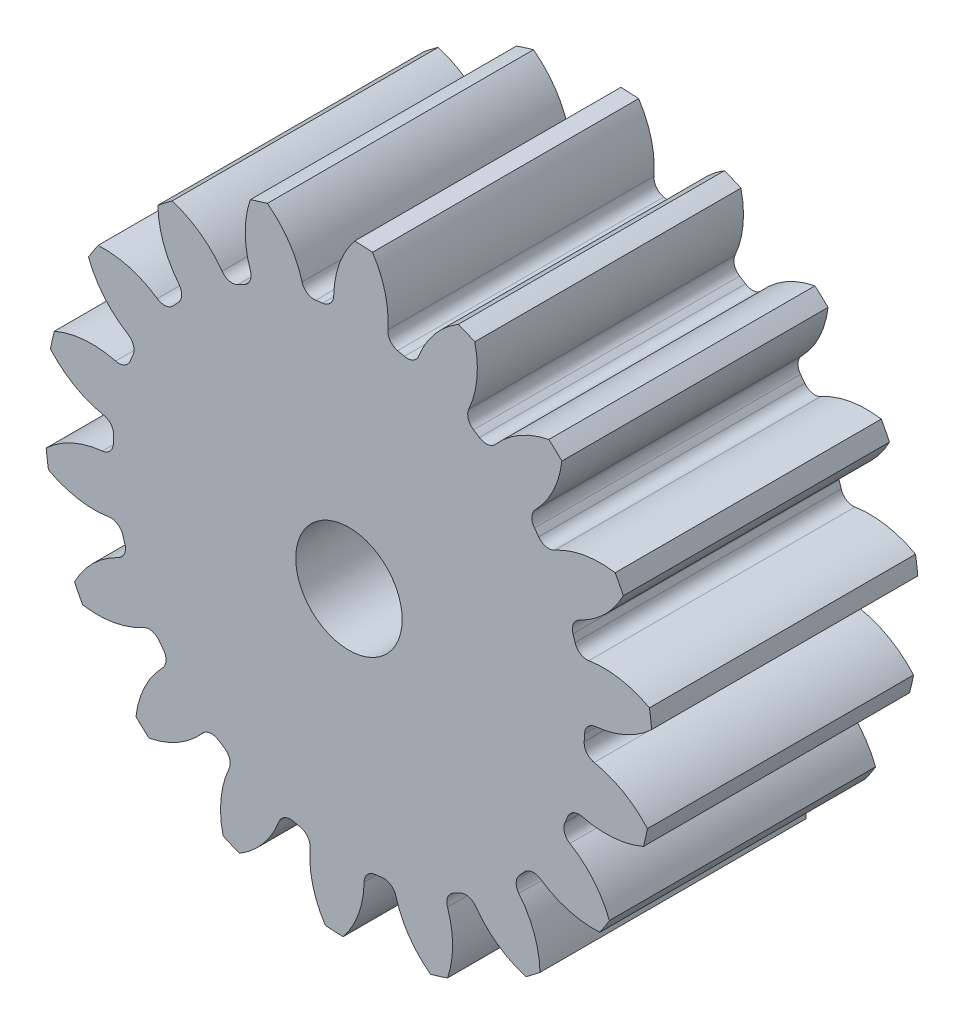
ISO-10303-21;
HEADER;
FILE_DESCRIPTION(('STEP AP214'),'2;1');
FILE_NAME('part.step','',(''),(''),'','','');
FILE_SCHEMA(('AUTOMOTIVE_DESIGN { 1 0 10303 214 1 1 1 1 }'));
ENDSEC;
DATA;
#1=APPLICATION_CONTEXT('core data for automotive mechanical design processes');
#2=APPLICATION_PROTOCOL_DEFINITION('international standard','automotive_design',2000,#1);
#3=PRODUCT_CONTEXT('',#1,'mechanical');
#4=PRODUCT('Part','Part','',(#3));
#5=PRODUCT_RELATED_PRODUCT_CATEGORY('part','',(#4));
#6=PRODUCT_DEFINITION_FORMATION('','',#4);
#7=PRODUCT_DEFINITION_CONTEXT('part definition',#1,'design');
#8=PRODUCT_DEFINITION('design','',#6,#7);
#9=PRODUCT_DEFINITION_SHAPE('','',#8);
#10=(LENGTH_UNIT() NAMED_UNIT(*) SI_UNIT(.MILLI.,.METRE.));
#11=(NAMED_UNIT(*) PLANE_ANGLE_UNIT() SI_UNIT($,.RADIAN.));
#12=(NAMED_UNIT(*) SI_UNIT($,.STERADIAN.) SOLID_ANGLE_UNIT());
#13=UNCERTAINTY_MEASURE_WITH_UNIT(LENGTH_MEASURE(1.E-05),#10,'distance_accuracy_value','');
#14=(GEOMETRIC_REPRESENTATION_CONTEXT(3) GLOBAL_UNCERTAINTY_ASSIGNED_CONTEXT((#13)) GLOBAL_UNIT_ASSIGNED_CONTEXT((#10,
#11,#12)) REPRESENTATION_CONTEXT('',''));
#15=CARTESIAN_POINT('',(0.,0.,0.));
#16=DIRECTION('',(0.,0.,1.));
#17=DIRECTION('',(1.,0.,0.));
#18=AXIS2_PLACEMENT_3D('',#15,#16,#17);
#19=CARTESIAN_POINT('',(0.,0.,88.9));
#20=DIRECTION('',(0.,0.,-1.));
#21=DIRECTION('',(-1.,0.,0.));
#22=AXIS2_PLACEMENT_3D('',#19,#20,#21);
#23=CYLINDRICAL_SURFACE('',#22,101.6);
#24=DIRECTION('',(0.,0.,-1.));
#25=VECTOR('',#24,1.);
#26=CARTESIAN_POINT('',(100.371684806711,15.7507107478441,44.45));
#27=LINE('',#26,#25);
#28=CARTESIAN_POINT('',(100.371684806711,15.7507107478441,88.9));
#29=VERTEX_POINT('',#28);
#30=CARTESIAN_POINT('',(100.371684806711,15.7507107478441,0.));
#31=VERTEX_POINT('',#30);
#32=EDGE_CURVE('E744',#29,#31,#27,.T.);
#33=ORIENTED_EDGE('',*,*,#32,.F.);
#34=CARTESIAN_POINT('',(0.,0.,88.9));
#35=DIRECTION('',(0.,0.,1.));
#36=DIRECTION('',(1.,0.,0.));
#37=AXIS2_PLACEMENT_3D('',#34,#35,#36);
#38=CIRCLE('',#37,101.6);
#39=CARTESIAN_POINT('',(101.122948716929,9.8340857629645,88.9));
#40=VERTEX_POINT('',#39);
#41=EDGE_CURVE('E1389',#40,#29,#38,.T.);
#42=ORIENTED_EDGE('',*,*,#41,.F.);
#43=DIRECTION('',(0.,0.,-1.));
#44=VECTOR('',#43,1.);
#45=CARTESIAN_POINT('',(101.122948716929,9.8340857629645,44.45));
#46=LINE('',#45,#44);
#47=CARTESIAN_POINT('',(101.122948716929,9.8340857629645,0.));
#48=VERTEX_POINT('',#47);
#49=EDGE_CURVE('E1383',#48,#40,#46,.F.);
#50=ORIENTED_EDGE('',*,*,#49,.F.);
#51=CARTESIAN_POINT('',(0.,0.,0.));
#52=DIRECTION('',(0.,0.,1.));
#53=DIRECTION('',(1.,0.,0.));
#54=AXIS2_PLACEMENT_3D('',#51,#52,#53);
#55=CIRCLE('',#54,101.6);
#56=EDGE_CURVE('E1394',#48,#31,#55,.T.);
#57=ORIENTED_EDGE('',*,*,#56,.T.);
#58=EDGE_LOOP('',(#33,#42,#50,#57));
#59=FACE_BOUND('',#58,.T.);
#60=ADVANCED_FACE('F33',(#59),#23,.T.);
#61=DIRECTION('',(0.,0.,-1.));
#62=VECTOR('',#61,1.);
#63=CARTESIAN_POINT('',(91.6610332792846,43.8271032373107,44.45));
#64=LINE('',#63,#62);
#65=CARTESIAN_POINT('',(91.6610332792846,43.8271032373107,0.));
#66=VERTEX_POINT('',#65);
#67=CARTESIAN_POINT('',(91.6610332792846,43.8271032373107,88.9));
#68=VERTEX_POINT('',#67);
#69=EDGE_CURVE('E715',#66,#68,#64,.F.);
#70=ORIENTED_EDGE('',*,*,#69,.F.);
#71=CARTESIAN_POINT('',(88.9314712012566,49.1299646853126,0.));
#72=VERTEX_POINT('',#71);
#73=EDGE_CURVE('E1397',#66,#72,#55,.T.);
#74=ORIENTED_EDGE('',*,*,#73,.T.);
#75=DIRECTION('',(0.,0.,-1.));
#76=VECTOR('',#75,1.);
#77=CARTESIAN_POINT('',(88.9314712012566,49.1299646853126,44.45));
#78=LINE('',#77,#76);
#79=CARTESIAN_POINT('',(88.9314712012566,49.1299646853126,88.9));
#80=VERTEX_POINT('',#79);
#81=EDGE_CURVE('E777',#80,#72,#78,.T.);
#82=ORIENTED_EDGE('',*,*,#81,.F.);
#83=EDGE_CURVE('E1392',#68,#80,#38,.T.);
#84=ORIENTED_EDGE('',*,*,#83,.F.);
#85=EDGE_LOOP('',(#70,#74,#82,#84));
#86=FACE_BOUND('',#85,.T.);
#87=ADVANCED_FACE('F1601',(#86),#23,.T.);
#88=CARTESIAN_POINT('',(0.,0.,88.9));
#89=DIRECTION('',(0.,0.,1.));
#90=DIRECTION('',(1.,0.,0.));
#91=AXIS2_PLACEMENT_3D('',#88,#89,#90);
#92=PLANE('',#91);
#93=CARTESIAN_POINT('',(0.,0.,88.9000000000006));
#94=DIRECTION('',(0.,0.,1.));
#95=DIRECTION('',(1.,0.,0.));
#96=AXIS2_PLACEMENT_3D('',#93,#94,#95);
#97=CIRCLE('',#96,17.78);
#98=CARTESIAN_POINT('',(17.78,0.,88.9000000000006));
#99=VERTEX_POINT('',#98);
#100=EDGE_CURVE('E732',#99,#99,#97,.T.);
#101=ORIENTED_EDGE('',*,*,#100,.F.);
#102=EDGE_LOOP('',(#101));
#103=FACE_BOUND('',#102,.T.);
#104=ORIENTED_EDGE('',*,*,#41,.T.);
#105=CARTESIAN_POINT('',(85.0835905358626,-11.998875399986,88.9));
#106=DIRECTION('',(0.,0.,-1.));
#107=DIRECTION('',(0.939692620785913,0.342020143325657,0.));
#108=AXIS2_PLACEMENT_3D('',#105,#106,#107);
#109=CIRCLE('',#108,31.6822561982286);
#110=CARTESIAN_POINT('',(80.1519765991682,19.2972032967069,88.9));
#111=VERTEX_POINT('',#110);
#112=EDGE_CURVE('E724',#111,#29,#109,.T.);
#113=ORIENTED_EDGE('',*,*,#112,.F.);
#114=CARTESIAN_POINT('',(79.5083098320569,23.3819199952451,88.9));
#115=DIRECTION('',(0.,0.,1.));
#116=DIRECTION('',(-0.939692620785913,-0.342020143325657,0.));
#117=AXIS2_PLACEMENT_3D('',#114,#115,#116);
#118=CIRCLE('',#117,4.13512);
#119=CARTESIAN_POINT('',(75.5411795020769,22.2152605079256,88.9));
#120=VERTEX_POINT('',#119);
#121=EDGE_CURVE('E722',#120,#111,#118,.T.);
#122=ORIENTED_EDGE('',*,*,#121,.F.);
#123=CARTESIAN_POINT('',(0.,0.,88.9));
#124=DIRECTION('',(0.,0.,-1.));
#125=DIRECTION('',(0.939692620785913,0.342020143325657,0.));
#126=AXIS2_PLACEMENT_3D('',#123,#124,#125);
#127=CIRCLE('',#126,78.74);
#128=CARTESIAN_POINT('',(74.8499288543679,24.4433170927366,88.9));
#129=VERTEX_POINT('',#128);
#130=EDGE_CURVE('E707',#129,#120,#127,.T.);
#131=ORIENTED_EDGE('',*,*,#130,.F.);
#132=CARTESIAN_POINT('',(78.7807573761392,25.7269854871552,88.9));
#133=DIRECTION('',(0.,0.,1.));
#134=DIRECTION('',(-0.939692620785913,-0.342020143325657,0.));
#135=AXIS2_PLACEMENT_3D('',#132,#133,#134);
#136=CIRCLE('',#135,4.13512);
#137=CARTESIAN_POINT('',(76.9993808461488,29.4587297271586,88.9));
#138=VERTEX_POINT('',#137);
#139=EDGE_CURVE('E699',#138,#129,#136,.T.);
#140=ORIENTED_EDGE('',*,*,#139,.F.);
#141=CARTESIAN_POINT('',(63.3509189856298,58.0504216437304,88.9));
#142=DIRECTION('',(0.,0.,-1.));
#143=DIRECTION('',(-0.939692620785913,-0.342020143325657,0.));
#144=AXIS2_PLACEMENT_3D('',#141,#142,#143);
#145=CIRCLE('',#144,31.6822561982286);
#146=EDGE_CURVE('E729',#68,#138,#145,.T.);
#147=ORIENTED_EDGE('',*,*,#146,.F.);
#148=ORIENTED_EDGE('',*,*,#83,.T.);
#149=CARTESIAN_POINT('',(84.0562792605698,17.8250471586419,88.9));
#150=DIRECTION('',(0.,0.,-1.));
#151=DIRECTION('',(0.766044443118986,0.64278760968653,0.));
#152=AXIS2_PLACEMENT_3D('',#149,#150,#151);
#153=CIRCLE('',#152,31.6822561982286);
#154=CARTESIAN_POINT('',(68.7181887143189,45.5470300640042,88.9));
#155=VERTEX_POINT('',#154);
#156=EDGE_CURVE('E753',#155,#80,#153,.T.);
#157=ORIENTED_EDGE('',*,*,#156,.F.);
#158=CARTESIAN_POINT('',(66.7162844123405,49.1652612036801,88.9));
#159=DIRECTION('',(0.,0.,1.));
#160=DIRECTION('',(-0.766044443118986,-0.64278760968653,0.));
#161=AXIS2_PLACEMENT_3D('',#158,#159,#160);
#162=CIRCLE('',#161,4.13512);
#163=CARTESIAN_POINT('',(63.3874223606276,46.7121214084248,88.9));
#164=VERTEX_POINT('',#163);
#165=EDGE_CURVE('E751',#164,#155,#162,.T.);
#166=ORIENTED_EDGE('',*,*,#165,.F.);
#167=CARTESIAN_POINT('',(0.,0.,88.9));
#168=DIRECTION('',(0.,0.,-1.));
#169=DIRECTION('',(0.766044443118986,0.64278760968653,0.));
#170=AXIS2_PLACEMENT_3D('',#167,#168,#169);
#171=CIRCLE('',#170,78.74);
#172=CARTESIAN_POINT('',(61.9758189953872,48.5693880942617,88.9));
#173=VERTEX_POINT('',#172);
#174=EDGE_CURVE('E748',#173,#164,#171,.T.);
#175=ORIENTED_EDGE('',*,*,#174,.F.);
#176=CARTESIAN_POINT('',(65.2305491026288,51.1200643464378,88.9));
#177=DIRECTION('',(0.,0.,1.));
#178=DIRECTION('',(-0.766044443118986,-0.64278760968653,0.));
#179=AXIS2_PLACEMENT_3D('',#176,#177,#178);
#180=CIRCLE('',#179,4.13512);
#181=CARTESIAN_POINT('',(62.2802710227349,54.017490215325,88.9));
#182=VERTEX_POINT('',#181);
#183=EDGE_CURVE('E746',#182,#173,#180,.T.);
#184=ORIENTED_EDGE('',*,*,#183,.F.);
#185=CARTESIAN_POINT('',(39.675977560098,76.2168432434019,88.9));
#186=DIRECTION('',(0.,0.,-1.));
#187=DIRECTION('',(-0.766044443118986,-0.64278760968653,0.));
#188=AXIS2_PLACEMENT_3D('',#185,#186,#187);
#189=CIRCLE('',#188,31.6822561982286);
#190=CARTESIAN_POINT('',(71.1434444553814,72.5339252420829,88.9));
#191=VERTEX_POINT('',#190);
#192=EDGE_CURVE('E756',#191,#182,#189,.T.);
#193=ORIENTED_EDGE('',*,*,#192,.F.);
#194=CARTESIAN_POINT('',(66.7648096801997,76.5834198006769,88.9));
#195=VERTEX_POINT('',#194);
#196=EDGE_CURVE('E1441',#191,#195,#38,.T.);
#197=ORIENTED_EDGE('',*,*,#196,.T.);
#198=CARTESIAN_POINT('',(72.8905401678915,45.4990059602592,88.9));
#199=DIRECTION('',(0.,0.,-1.));
#200=DIRECTION('',(0.50000000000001,0.866025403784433,0.));
#201=AXIS2_PLACEMENT_3D('',#198,#199,#200);
#202=CIRCLE('',#201,31.6822561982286);
#203=CARTESIAN_POINT('',(48.9959730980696,66.3032128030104,88.9));
#204=VERTEX_POINT('',#203);
#205=EDGE_CURVE('E788',#204,#195,#202,.T.);
#206=ORIENTED_EDGE('',*,*,#205,.F.);
#207=CARTESIAN_POINT('',(45.8772904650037,69.0185463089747,88.9));
#208=DIRECTION('',(0.,0.,1.));
#209=DIRECTION('',(-0.50000000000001,-0.866025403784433,0.));
#210=AXIS2_PLACEMENT_3D('',#207,#208,#209);
#211=CIRCLE('',#210,4.13512);
#212=CARTESIAN_POINT('',(43.5882065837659,65.5748110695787,88.9));
#213=VERTEX_POINT('',#212);
#214=EDGE_CURVE('E786',#213,#204,#211,.T.);
#215=ORIENTED_EDGE('',*,*,#214,.F.);
#216=CARTESIAN_POINT('',(0.,0.,88.9));
#217=DIRECTION('',(0.,0.,-1.));
#218=DIRECTION('',(0.50000000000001,0.866025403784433,0.));
#219=AXIS2_PLACEMENT_3D('',#216,#217,#218);
#220=CIRCLE('',#219,78.74);
#221=CARTESIAN_POINT('',(41.626510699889,66.8372740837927,88.9));
#222=VERTEX_POINT('',#221);
#223=EDGE_CURVE('E783',#222,#213,#220,.T.);
#224=ORIENTED_EDGE('',*,*,#223,.F.);
#225=CARTESIAN_POINT('',(43.8125739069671,70.3473089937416,88.9));
#226=DIRECTION('',(0.,0.,1.));
#227=DIRECTION('',(-0.50000000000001,-0.866025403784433,0.));
#228=AXIS2_PLACEMENT_3D('',#225,#226,#227);
#229=CIRCLE('',#228,4.13512);
#230=CARTESIAN_POINT('',(40.049241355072,72.0609441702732,88.9));
#231=VERTEX_POINT('',#230);
#232=EDGE_CURVE('E781',#231,#222,#229,.T.);
#233=ORIENTED_EDGE('',*,*,#232,.F.);
#234=CARTESIAN_POINT('',(11.215527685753,85.1903887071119,88.9));
#235=DIRECTION('',(0.,0.,-1.));
#236=DIRECTION('',(-0.50000000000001,-0.866025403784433,0.));
#237=AXIS2_PLACEMENT_3D('',#234,#235,#236);
#238=CIRCLE('',#237,31.6822561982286);
#239=CARTESIAN_POINT('',(42.0449062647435,92.4920853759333,88.9));
#240=VERTEX_POINT('',#239);
#241=EDGE_CURVE('E791',#240,#231,#238,.T.);
#242=ORIENTED_EDGE('',*,*,#241,.F.);
#243=CARTESIAN_POINT('',(36.5453267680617,94.7997842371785,88.9));
#244=VERTEX_POINT('',#243);
#245=EDGE_CURVE('E1583',#240,#244,#38,.T.);
#246=ORIENTED_EDGE('',*,*,#245,.T.);
#247=CARTESIAN_POINT('',(52.9331261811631,67.6851131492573,88.9));
#248=DIRECTION('',(0.,0.,-1.));
#249=DIRECTION('',(0.17364817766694,0.984807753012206,0.));
#250=AXIS2_PLACEMENT_3D('',#247,#248,#249);
#251=CIRCLE('',#250,31.6822561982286);
#252=CARTESIAN_POINT('',(23.3641200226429,79.062249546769,88.9));
#253=VERTEX_POINT('',#252);
#254=EDGE_CURVE('E826',#253,#244,#251,.T.);
#255=ORIENTED_EDGE('',*,*,#254,.F.);
#256=CARTESIAN_POINT('',(19.5048182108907,80.5471761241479,88.9));
#257=DIRECTION('',(0.,0.,1.));
#258=DIRECTION('',(-0.17364817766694,-0.984807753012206,0.));
#259=AXIS2_PLACEMENT_3D('',#256,#257,#258);
#260=CIRCLE('',#259,4.13512);
#261=CARTESIAN_POINT('',(18.5316097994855,76.5282107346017,88.9));
#262=VERTEX_POINT('',#261);
#263=EDGE_CURVE('E824',#262,#253,#260,.T.);
#264=ORIENTED_EDGE('',*,*,#263,.F.);
#265=CARTESIAN_POINT('',(0.,0.,88.9));
#266=DIRECTION('',(0.,0.,-1.));
#267=DIRECTION('',(0.17364817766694,0.984807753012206,0.));
#268=AXIS2_PLACEMENT_3D('',#265,#266,#267);
#269=CIRCLE('',#268,78.74);
#270=CARTESIAN_POINT('',(16.2564308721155,77.0435984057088,88.9));
#271=VERTEX_POINT('',#270);
#272=EDGE_CURVE('E821',#271,#262,#269,.T.);
#273=ORIENTED_EDGE('',*,*,#272,.F.);
#274=CARTESIAN_POINT('',(17.1101556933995,81.0896299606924,88.9));
#275=DIRECTION('',(0.,0.,1.));
#276=DIRECTION('',(-0.17364817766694,-0.984807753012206,0.));
#277=AXIS2_PLACEMENT_3D('',#274,#275,#276);
#278=CIRCLE('',#277,4.13512);
#279=CARTESIAN_POINT('',(12.987682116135,81.4127847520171,88.9));
#280=VERTEX_POINT('',#279);
#281=EDGE_CURVE('E819',#280,#271,#278,.T.);
#282=ORIENTED_EDGE('',*,*,#281,.F.);
#283=CARTESIAN_POINT('',(-18.5976803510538,83.8887160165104,88.9));
#284=DIRECTION('',(0.,0.,-1.));
#285=DIRECTION('',(-0.17364817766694,-0.984807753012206,0.));
#286=AXIS2_PLACEMENT_3D('',#283,#284,#285);
#287=CIRCLE('',#286,31.6822561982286);
#288=CARTESIAN_POINT('',(7.87513186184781,101.294334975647,88.9));
#289=VERTEX_POINT('',#288);
#290=EDGE_CURVE('E829',#289,#280,#287,.T.);
#291=ORIENTED_EDGE('',*,*,#290,.F.);
#292=CARTESIAN_POINT('',(1.91793809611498,101.581895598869,88.9));
#293=VERTEX_POINT('',#292);
#294=EDGE_CURVE('E1579',#289,#293,#38,.T.);
#295=ORIENTED_EDGE('',*,*,#294,.T.);
#296=CARTESIAN_POINT('',(26.5911959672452,81.7073967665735,88.9));
#297=DIRECTION('',(0.,0.,-1.));
#298=DIRECTION('',(-0.173648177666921,0.98480775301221,0.));
#299=AXIS2_PLACEMENT_3D('',#296,#297,#298);
#300=CIRCLE('',#299,31.6822561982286);
#301=CARTESIAN_POINT('',(-5.08579074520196,82.2852121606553,88.9));
#302=VERTEX_POINT('',#301);
#303=EDGE_CURVE('E864',#302,#293,#300,.T.);
#304=ORIENTED_EDGE('',*,*,#303,.F.);
#305=CARTESIAN_POINT('',(-9.22022297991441,82.3606277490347,88.9));
#306=DIRECTION('',(0.,0.,1.));
#307=DIRECTION('',(0.173648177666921,-0.98480775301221,0.));
#308=AXIS2_PLACEMENT_3D('',#305,#306,#307);
#309=CIRCLE('',#308,4.13512);
#310=CARTESIAN_POINT('',(-8.76017262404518,78.2511787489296,88.9));
#311=VERTEX_POINT('',#310);
#312=EDGE_CURVE('E862',#311,#302,#309,.T.);
#313=ORIENTED_EDGE('',*,*,#312,.F.);
#314=CARTESIAN_POINT('',(0.,0.,88.9));
#315=DIRECTION('',(0.,0.,-1.));
#316=DIRECTION('',(-0.173648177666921,0.98480775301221,0.));
#317=AXIS2_PLACEMENT_3D('',#314,#315,#316);
#318=CIRCLE('',#317,78.74);
#319=CARTESIAN_POINT('',(-11.0744144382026,77.9573277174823,88.9));
#320=VERTEX_POINT('',#319);
#321=EDGE_CURVE('E859',#320,#311,#318,.T.);
#322=ORIENTED_EDGE('',*,*,#321,.F.);
#323=CARTESIAN_POINT('',(-11.655999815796,82.0513447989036,88.9));
#324=DIRECTION('',(0.,0.,1.));
#325=DIRECTION('',(0.173648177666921,-0.98480775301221,0.));
#326=AXIS2_PLACEMENT_3D('',#323,#324,#325);
#327=CIRCLE('',#326,4.13512);
#328=CARTESIAN_POINT('',(-15.6403832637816,80.9450419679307,88.9));
#329=VERTEX_POINT('',#328);
#330=EDGE_CURVE('E857',#329,#320,#327,.T.);
#331=ORIENTED_EDGE('',*,*,#330,.F.);
#332=CARTESIAN_POINT('',(-46.1677336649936,72.4688261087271,88.9));
#333=DIRECTION('',(0.,0.,-1.));
#334=DIRECTION('',(0.173648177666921,-0.98480775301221,0.));
#335=AXIS2_PLACEMENT_3D('',#332,#333,#334);
#336=CIRCLE('',#335,31.6822561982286);
#337=CARTESIAN_POINT('',(-27.2444996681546,97.8789928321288,88.9));
#338=VERTEX_POINT('',#337);
#339=EDGE_CURVE('E867',#338,#329,#336,.T.);
#340=ORIENTED_EDGE('',*,*,#339,.F.);
#341=CARTESIAN_POINT('',(-32.9407822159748,96.1117311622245,88.9));
#342=VERTEX_POINT('',#341);
#343=EDGE_CURVE('E1575',#338,#342,#38,.T.);
#344=ORIENTED_EDGE('',*,*,#343,.T.);
#345=CARTESIAN_POINT('',(-2.95802492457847,85.8745624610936,88.9));
#346=DIRECTION('',(0.,0.,-1.));
#347=DIRECTION('',(-0.499999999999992,0.866025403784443,0.));
#348=AXIS2_PLACEMENT_3D('',#345,#346,#347);
#349=CIRCLE('',#348,31.6822561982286);
#350=CARTESIAN_POINT('',(-32.922280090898,75.5833637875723,88.9));
#351=VERTEX_POINT('',#350);
#352=EDGE_CURVE('E902',#351,#342,#349,.T.);
#353=ORIENTED_EDGE('',*,*,#352,.F.);
#354=CARTESIAN_POINT('',(-36.8331692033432,74.240172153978,88.9));
#355=DIRECTION('',(0.,0.,1.));
#356=DIRECTION('',(0.499999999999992,-0.866025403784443,0.));
#357=AXIS2_PLACEMENT_3D('',#354,#355,#356);
#358=CIRCLE('',#357,4.13512);
#359=CARTESIAN_POINT('',(-34.9953489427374,70.5358997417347,88.9));
#360=VERTEX_POINT('',#359);
#361=EDGE_CURVE('E900',#360,#351,#358,.T.);
#362=ORIENTED_EDGE('',*,*,#361,.F.);
#363=CARTESIAN_POINT('',(0.,0.,88.9));
#364=DIRECTION('',(0.,0.,-1.));
#365=DIRECTION('',(-0.499999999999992,0.866025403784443,0.));
#366=AXIS2_PLACEMENT_3D('',#363,#364,#365);
#367=CIRCLE('',#366,78.74);
#368=CARTESIAN_POINT('',(-37.0695219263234,69.4682527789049,88.9));
#369=VERTEX_POINT('',#368);
#370=EDGE_CURVE('E897',#369,#360,#367,.T.);
#371=ORIENTED_EDGE('',*,*,#370,.F.);
#372=CARTESIAN_POINT('',(-39.0162697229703,73.1164565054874,88.9));
#373=DIRECTION('',(0.,0.,1.));
#374=DIRECTION('',(0.499999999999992,-0.866025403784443,0.));
#375=AXIS2_PLACEMENT_3D('',#372,#373,#374);
#376=CIRCLE('',#375,4.13512);
#377=CARTESIAN_POINT('',(-42.3819875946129,70.7141325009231,88.9));
#378=VERTEX_POINT('',#377);
#379=EDGE_CURVE('E895',#378,#369,#376,.T.);
#380=ORIENTED_EDGE('',*,*,#379,.F.);
#381=CARTESIAN_POINT('',(-68.1692769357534,52.3081262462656,88.9));
#382=DIRECTION('',(0.,0.,-1.));
#383=DIRECTION('',(0.499999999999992,-0.866025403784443,0.));
#384=AXIS2_PLACEMENT_3D('',#381,#382,#383);
#385=CIRCLE('',#384,31.6822561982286);
#386=CARTESIAN_POINT('',(-59.0780424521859,82.6579996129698,88.9));
#387=VERTEX_POINT('',#386);
#388=EDGE_CURVE('E905',#387,#378,#385,.T.);
#389=ORIENTED_EDGE('',*,*,#388,.F.);
#390=CARTESIAN_POINT('',(-63.8263580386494,79.049073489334,88.9));
#391=VERTEX_POINT('',#390);
#392=EDGE_CURVE('E1571',#387,#391,#38,.T.);
#393=ORIENTED_EDGE('',*,*,#392,.T.);
#394=CARTESIAN_POINT('',(-32.1504643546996,79.6839885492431,88.9));
#395=DIRECTION('',(0.,0.,-1.));
#396=DIRECTION('',(-0.766044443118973,0.642787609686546,0.));
#397=AXIS2_PLACEMENT_3D('',#394,#395,#396);
#398=CIRCLE('',#397,31.6822561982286);
#399=CARTESIAN_POINT('',(-56.7878565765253,59.7650462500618,88.9));
#400=VERTEX_POINT('',#399);
#401=EDGE_CURVE('E940',#400,#391,#398,.T.);
#402=ORIENTED_EDGE('',*,*,#401,.F.);
#403=CARTESIAN_POINT('',(-60.0034916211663,57.1652561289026,88.9));
#404=DIRECTION('',(0.,0.,1.));
#405=DIRECTION('',(0.766044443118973,-0.642787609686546,0.));
#406=AXIS2_PLACEMENT_3D('',#403,#404,#405);
#407=CIRCLE('',#406,4.13512);
#408=CARTESIAN_POINT('',(-57.0095697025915,54.3129502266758,88.9));
#409=VERTEX_POINT('',#408);
#410=EDGE_CURVE('E938',#409,#400,#407,.T.);
#411=ORIENTED_EDGE('',*,*,#410,.F.);
#412=CARTESIAN_POINT('',(0.,0.,88.9));
#413=DIRECTION('',(0.,0.,-1.));
#414=DIRECTION('',(-0.766044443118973,0.642787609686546,0.));
#415=AXIS2_PLACEMENT_3D('',#412,#413,#414);
#416=CIRCLE('',#415,78.74);
#417=CARTESIAN_POINT('',(-58.5934979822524,52.6002813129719,88.9));
#418=VERTEX_POINT('',#417);
#419=EDGE_CURVE('E935',#418,#409,#416,.T.);
#420=ORIENTED_EDGE('',*,*,#419,.F.);
#421=CARTESIAN_POINT('',(-61.6706016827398,55.362644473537,88.9));
#422=DIRECTION('',(0.,0.,1.));
#423=DIRECTION('',(0.766044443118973,-0.642787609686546,0.));
#424=AXIS2_PLACEMENT_3D('',#421,#422,#423);
#425=CIRCLE('',#424,4.13512);
#426=CARTESIAN_POINT('',(-64.0116987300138,51.9540550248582,88.9));
#427=VERTEX_POINT('',#426);
#428=EDGE_CURVE('E933',#427,#418,#425,.T.);
#429=ORIENTED_EDGE('',*,*,#428,.F.);
#430=CARTESIAN_POINT('',(-81.9485993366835,25.8382943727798,88.9));
#431=DIRECTION('',(0.,0.,-1.));
#432=DIRECTION('',(0.766044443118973,-0.642787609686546,0.));
#433=AXIS2_PLACEMENT_3D('',#430,#431,#432);
#434=CIRCLE('',#433,31.6822561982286);
#435=CARTESIAN_POINT('',(-83.7859014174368,57.4672317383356,88.9));
#436=VERTEX_POINT('',#435);
#437=EDGE_CURVE('E943',#436,#427,#434,.T.);
#438=ORIENTED_EDGE('',*,*,#437,.F.);
#439=CARTESIAN_POINT('',(-87.0135331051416,52.4519309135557,88.9));
#440=VERTEX_POINT('',#439);
#441=EDGE_CURVE('E1567',#436,#440,#38,.T.);
#442=ORIENTED_EDGE('',*,*,#441,.T.);
#443=CARTESIAN_POINT('',(-57.4650832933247,63.8823496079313,88.9));
#444=DIRECTION('',(0.,0.,-1.));
#445=DIRECTION('',(-0.939692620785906,0.342020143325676,0.));
#446=AXIS2_PLACEMENT_3D('',#443,#444,#445);
#447=CIRCLE('',#446,31.6822561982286);
#448=CARTESIAN_POINT('',(-73.8039794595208,36.7381820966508,88.9));
#449=VERTEX_POINT('',#448);
#450=EDGE_CURVE('E978',#449,#440,#447,.T.);
#451=ORIENTED_EDGE('',*,*,#450,.F.);
#452=CARTESIAN_POINT('',(-75.9365073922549,33.1953665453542,88.9));
#453=DIRECTION('',(0.,0.,1.));
#454=DIRECTION('',(0.939692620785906,-0.342020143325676,0.));
#455=AXIS2_PLACEMENT_3D('',#452,#453,#454);
#456=CIRCLE('',#455,4.13512);
#457=CARTESIAN_POINT('',(-72.1475949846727,31.5390573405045,88.9));
#458=VERTEX_POINT('',#457);
#459=EDGE_CURVE('E976',#458,#449,#456,.T.);
#460=ORIENTED_EDGE('',*,*,#459,.F.);
#461=CARTESIAN_POINT('',(0.,0.,88.9));
#462=DIRECTION('',(0.,0.,-1.));
#463=DIRECTION('',(-0.939692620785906,0.342020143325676,0.));
#464=AXIS2_PLACEMENT_3D('',#461,#462,#463);
#465=CIRCLE('',#464,78.74);
#466=CARTESIAN_POINT('',(-73.0502334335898,29.3879396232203,88.9));
#467=VERTEX_POINT('',#466);
#468=EDGE_CURVE('E973',#467,#458,#465,.T.);
#469=ORIENTED_EDGE('',*,*,#468,.F.);
#470=CARTESIAN_POINT('',(-76.8865489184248,30.9312804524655,88.9));
#471=DIRECTION('',(0.,0.,1.));
#472=DIRECTION('',(0.939692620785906,-0.342020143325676,0.));
#473=AXIS2_PLACEMENT_3D('',#470,#471,#472);
#474=CIRCLE('',#473,4.13512);
#475=CARTESIAN_POINT('',(-77.9206542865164,26.9275517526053,88.9));
#476=VERTEX_POINT('',#475);
#477=EDGE_CURVE('E971',#476,#467,#474,.T.);
#478=ORIENTED_EDGE('',*,*,#477,.F.);
#479=CARTESIAN_POINT('',(-85.8437112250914,-3.74801713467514,88.9));
#480=DIRECTION('',(0.,0.,-1.));
#481=DIRECTION('',(0.939692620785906,-0.342020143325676,0.));
#482=AXIS2_PLACEMENT_3D('',#479,#480,#481);
#483=CIRCLE('',#482,31.6822561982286);
#484=CARTESIAN_POINT('',(-98.3879441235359,25.3450675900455,88.9));
#485=VERTEX_POINT('',#484);
#486=EDGE_CURVE('E981',#485,#476,#483,.T.);
#487=ORIENTED_EDGE('',*,*,#486,.F.);
#488=CARTESIAN_POINT('',(-99.7055918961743,19.5283113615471,88.9));
#489=VERTEX_POINT('',#488);
#490=EDGE_CURVE('E1563',#485,#489,#38,.T.);
#491=ORIENTED_EDGE('',*,*,#490,.T.);
#492=CARTESIAN_POINT('',(-75.84856509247,40.3755565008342,88.9));
#493=DIRECTION('',(0.,0.,-1.));
#494=DIRECTION('',(-1.,0.,0.));
#495=AXIS2_PLACEMENT_3D('',#492,#493,#494);
#496=CIRCLE('',#495,31.6822561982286);
#497=CARTESIAN_POINT('',(-81.9182531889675,9.28015098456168,88.9));
#498=VERTEX_POINT('',#497);
#499=EDGE_CURVE('E1016',#498,#489,#496,.T.);
#500=ORIENTED_EDGE('',*,*,#499,.F.);
#501=CARTESIAN_POINT('',(-82.7104596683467,5.22162584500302,88.9));
#502=DIRECTION('',(0.,0.,1.));
#503=DIRECTION('',(1.,0.,0.));
#504=AXIS2_PLACEMENT_3D('',#501,#502,#503);
#505=CIRCLE('',#504,4.13512);
#506=CARTESIAN_POINT('',(-78.5835555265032,4.96108867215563,88.9));
#507=VERTEX_POINT('',#506);
#508=EDGE_CURVE('E1014',#507,#498,#505,.T.);
#509=ORIENTED_EDGE('',*,*,#508,.F.);
#510=CARTESIAN_POINT('',(0.,0.,88.9));
#511=DIRECTION('',(0.,0.,-1.));
#512=DIRECTION('',(-1.,0.,0.));
#513=AXIS2_PLACEMENT_3D('',#510,#511,#512);
#514=CIRCLE('',#513,78.74);
#515=CARTESIAN_POINT('',(-78.6960326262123,2.63097869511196,88.9));
#516=VERTEX_POINT('',#515);
#517=EDGE_CURVE('E1011',#516,#507,#514,.T.);
#518=ORIENTED_EDGE('',*,*,#517,.F.);
#519=CARTESIAN_POINT('',(-82.8288436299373,2.76914751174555,88.9));
#520=DIRECTION('',(0.,0.,1.));
#521=DIRECTION('',(1.,0.,0.));
#522=AXIS2_PLACEMENT_3D('',#519,#520,#521);
#523=CIRCLE('',#522,4.13512);
#524=CARTESIAN_POINT('',(-82.4312289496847,-1.34681166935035,88.9));
#525=VERTEX_POINT('',#524);
#526=EDGE_CURVE('E1009',#525,#516,#523,.T.);
#527=ORIENTED_EDGE('',*,*,#526,.F.);
#528=CARTESIAN_POINT('',(-79.3848046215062,-32.8822624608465,88.9));
#529=DIRECTION('',(0.,0.,-1.));
#530=DIRECTION('',(1.,0.,0.));
#531=AXIS2_PLACEMENT_3D('',#528,#529,#530);
#532=CIRCLE('',#531,31.6822561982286);
#533=CARTESIAN_POINT('',(-101.122948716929,-9.83408576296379,88.9));
#534=VERTEX_POINT('',#533);
#535=EDGE_CURVE('E1019',#534,#525,#532,.T.);
#536=ORIENTED_EDGE('',*,*,#535,.F.);
#537=CARTESIAN_POINT('',(-100.371684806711,-15.7507107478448,88.9));
#538=VERTEX_POINT('',#537);
#539=EDGE_CURVE('E1559',#534,#538,#38,.T.);
#540=ORIENTED_EDGE('',*,*,#539,.T.);
#541=CARTESIAN_POINT('',(-85.0835905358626,11.9988753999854,88.9));
#542=DIRECTION('',(0.,0.,-1.));
#543=DIRECTION('',(-0.939692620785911,-0.342020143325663,0.));
#544=AXIS2_PLACEMENT_3D('',#541,#542,#543);
#545=CIRCLE('',#544,31.6822561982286);
#546=CARTESIAN_POINT('',(-80.1519765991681,-19.2972032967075,88.9));
#547=VERTEX_POINT('',#546);
#548=EDGE_CURVE('E1054',#547,#538,#545,.T.);
#549=ORIENTED_EDGE('',*,*,#548,.F.);
#550=CARTESIAN_POINT('',(-79.5083098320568,-23.3819199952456,88.9));
#551=DIRECTION('',(0.,0.,1.));
#552=DIRECTION('',(0.939692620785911,0.342020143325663,0.));
#553=AXIS2_PLACEMENT_3D('',#550,#551,#552);
#554=CIRCLE('',#553,4.13512);
#555=CARTESIAN_POINT('',(-75.5411795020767,-22.2152605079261,88.9));
#556=VERTEX_POINT('',#555);
#557=EDGE_CURVE('E1052',#556,#547,#554,.T.);
#558=ORIENTED_EDGE('',*,*,#557,.F.);
#559=CARTESIAN_POINT('',(0.,0.,88.9));
#560=DIRECTION('',(0.,0.,-1.));
#561=DIRECTION('',(-0.939692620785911,-0.342020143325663,0.));
#562=AXIS2_PLACEMENT_3D('',#559,#560,#561);
#563=CIRCLE('',#562,78.74);
#564=CARTESIAN_POINT('',(-74.8499288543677,-24.4433170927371,88.9));
#565=VERTEX_POINT('',#564);
#566=EDGE_CURVE('E1049',#565,#556,#563,.T.);
#567=ORIENTED_EDGE('',*,*,#566,.F.);
#568=CARTESIAN_POINT('',(-78.7807573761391,-25.7269854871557,88.9));
#569=DIRECTION('',(0.,0.,1.));
#570=DIRECTION('',(0.939692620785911,0.342020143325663,0.));
#571=AXIS2_PLACEMENT_3D('',#568,#569,#570);
#572=CIRCLE('',#571,4.13512);
#573=CARTESIAN_POINT('',(-76.9993808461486,-29.4587297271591,88.9));
#574=VERTEX_POINT('',#573);
#575=EDGE_CURVE('E1047',#574,#565,#572,.T.);
#576=ORIENTED_EDGE('',*,*,#575,.F.);
#577=CARTESIAN_POINT('',(-63.3509189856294,-58.0504216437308,88.9));
#578=DIRECTION('',(0.,0.,-1.));
#579=DIRECTION('',(0.939692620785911,0.342020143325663,0.));
#580=AXIS2_PLACEMENT_3D('',#577,#578,#579);
#581=CIRCLE('',#580,31.6822561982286);
#582=CARTESIAN_POINT('',(-91.6610332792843,-43.8271032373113,88.9));
#583=VERTEX_POINT('',#582);
#584=EDGE_CURVE('E1057',#583,#574,#581,.T.);
#585=ORIENTED_EDGE('',*,*,#584,.F.);
#586=CARTESIAN_POINT('',(-88.9314712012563,-49.1299646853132,88.9));
#587=VERTEX_POINT('',#586);
#588=EDGE_CURVE('E1555',#583,#587,#38,.T.);
#589=ORIENTED_EDGE('',*,*,#588,.T.);
#590=CARTESIAN_POINT('',(-84.0562792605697,-17.8250471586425,88.9));
#591=DIRECTION('',(0.,0.,-1.));
#592=DIRECTION('',(-0.766044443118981,-0.642787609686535,0.));
#593=AXIS2_PLACEMENT_3D('',#590,#591,#592);
#594=CIRCLE('',#593,31.6822561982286);
#595=CARTESIAN_POINT('',(-68.7181887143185,-45.5470300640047,88.9));
#596=VERTEX_POINT('',#595);
#597=EDGE_CURVE('E1092',#596,#587,#594,.T.);
#598=ORIENTED_EDGE('',*,*,#597,.F.);
#599=CARTESIAN_POINT('',(-66.7162844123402,-49.1652612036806,88.9));
#600=DIRECTION('',(0.,0.,1.));
#601=DIRECTION('',(0.766044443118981,0.642787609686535,0.));
#602=AXIS2_PLACEMENT_3D('',#599,#600,#601);
#603=CIRCLE('',#602,4.13512);
#604=CARTESIAN_POINT('',(-63.3874223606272,-46.7121214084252,88.9));
#605=VERTEX_POINT('',#604);
#606=EDGE_CURVE('E1090',#605,#596,#603,.T.);
#607=ORIENTED_EDGE('',*,*,#606,.F.);
#608=CARTESIAN_POINT('',(0.,0.,88.9));
#609=DIRECTION('',(0.,0.,-1.));
#610=DIRECTION('',(-0.766044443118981,-0.642787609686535,0.));
#611=AXIS2_PLACEMENT_3D('',#608,#609,#610);
#612=CIRCLE('',#611,78.74);
#613=CARTESIAN_POINT('',(-61.9758189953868,-48.5693880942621,88.9));
#614=VERTEX_POINT('',#613);
#615=EDGE_CURVE('E1087',#614,#605,#612,.T.);
#616=ORIENTED_EDGE('',*,*,#615,.F.);
#617=CARTESIAN_POINT('',(-65.2305491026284,-51.1200643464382,88.9));
#618=DIRECTION('',(0.,0.,1.));
#619=DIRECTION('',(0.766044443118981,0.642787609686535,0.));
#620=AXIS2_PLACEMENT_3D('',#617,#618,#619);
#621=CIRCLE('',#620,4.13512);
#622=CARTESIAN_POINT('',(-62.2802710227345,-54.0174902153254,88.9));
#623=VERTEX_POINT('',#622);
#624=EDGE_CURVE('E1085',#623,#614,#621,.T.);
#625=ORIENTED_EDGE('',*,*,#624,.F.);
#626=CARTESIAN_POINT('',(-39.6759775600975,-76.2168432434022,88.9));
#627=DIRECTION('',(0.,0.,-1.));
#628=DIRECTION('',(0.766044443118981,0.642787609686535,0.));
#629=AXIS2_PLACEMENT_3D('',#626,#627,#628);
#630=CIRCLE('',#629,31.6822561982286);
#631=CARTESIAN_POINT('',(-71.1434444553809,-72.5339252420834,88.9));
#632=VERTEX_POINT('',#631);
#633=EDGE_CURVE('E1095',#632,#623,#630,.T.);
#634=ORIENTED_EDGE('',*,*,#633,.F.);
#635=CARTESIAN_POINT('',(-66.7648096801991,-76.5834198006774,88.9));
#636=VERTEX_POINT('',#635);
#637=EDGE_CURVE('E1551',#632,#636,#38,.T.);
#638=ORIENTED_EDGE('',*,*,#637,.T.);
#639=CARTESIAN_POINT('',(-72.8905401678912,-45.4990059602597,88.9));
#640=DIRECTION('',(0.,0.,-1.));
#641=DIRECTION('',(-0.500000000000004,-0.866025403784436,0.));
#642=AXIS2_PLACEMENT_3D('',#639,#640,#641);
#643=CIRCLE('',#642,31.6822561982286);
#644=CARTESIAN_POINT('',(-48.9959730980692,-66.3032128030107,88.9));
#645=VERTEX_POINT('',#644);
#646=EDGE_CURVE('E1130',#645,#636,#643,.T.);
#647=ORIENTED_EDGE('',*,*,#646,.F.);
#648=CARTESIAN_POINT('',(-45.8772904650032,-69.018546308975,88.9));
#649=DIRECTION('',(0.,0.,1.));
#650=DIRECTION('',(0.500000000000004,0.866025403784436,0.));
#651=AXIS2_PLACEMENT_3D('',#648,#649,#650);
#652=CIRCLE('',#651,4.13512);
#653=CARTESIAN_POINT('',(-43.5882065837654,-65.5748110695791,88.9));
#654=VERTEX_POINT('',#653);
#655=EDGE_CURVE('E1128',#654,#645,#652,.T.);
#656=ORIENTED_EDGE('',*,*,#655,.F.);
#657=CARTESIAN_POINT('',(0.,0.,88.9));
#658=DIRECTION('',(0.,0.,-1.));
#659=DIRECTION('',(-0.500000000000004,-0.866025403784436,0.));
#660=AXIS2_PLACEMENT_3D('',#657,#658,#659);
#661=CIRCLE('',#660,78.74);
#662=CARTESIAN_POINT('',(-41.6265106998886,-66.837274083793,88.9));
#663=VERTEX_POINT('',#662);
#664=EDGE_CURVE('E1125',#663,#654,#661,.T.);
#665=ORIENTED_EDGE('',*,*,#664,.F.);
#666=CARTESIAN_POINT('',(-43.8125739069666,-70.3473089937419,88.9));
#667=DIRECTION('',(0.,0.,1.));
#668=DIRECTION('',(0.500000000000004,0.866025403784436,0.));
#669=AXIS2_PLACEMENT_3D('',#666,#667,#668);
#670=CIRCLE('',#669,4.13512);
#671=CARTESIAN_POINT('',(-40.0492413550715,-72.0609441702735,88.9));
#672=VERTEX_POINT('',#671);
#673=EDGE_CURVE('E1123',#672,#663,#670,.T.);
#674=ORIENTED_EDGE('',*,*,#673,.F.);
#675=CARTESIAN_POINT('',(-11.2155276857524,-85.190388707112,88.9));
#676=DIRECTION('',(0.,0.,-1.));
#677=DIRECTION('',(0.500000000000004,0.866025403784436,0.));
#678=AXIS2_PLACEMENT_3D('',#675,#676,#677);
#679=CIRCLE('',#678,31.6822561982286);
#680=CARTESIAN_POINT('',(-42.0449062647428,-92.4920853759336,88.9));
#681=VERTEX_POINT('',#680);
#682=EDGE_CURVE('E1133',#681,#672,#679,.T.);
#683=ORIENTED_EDGE('',*,*,#682,.F.);
#684=CARTESIAN_POINT('',(-36.5453267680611,-94.7997842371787,88.9));
#685=VERTEX_POINT('',#684);
#686=EDGE_CURVE('E1547',#681,#685,#38,.T.);
#687=ORIENTED_EDGE('',*,*,#686,.T.);
#688=CARTESIAN_POINT('',(-52.9331261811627,-67.6851131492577,88.9));
#689=DIRECTION('',(0.,0.,-1.));
#690=DIRECTION('',(-0.173648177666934,-0.984807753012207,0.));
#691=AXIS2_PLACEMENT_3D('',#688,#689,#690);
#692=CIRCLE('',#691,31.6822561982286);
#693=CARTESIAN_POINT('',(-23.3641200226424,-79.0622495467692,88.9));
#694=VERTEX_POINT('',#693);
#695=EDGE_CURVE('E1168',#694,#685,#692,.T.);
#696=ORIENTED_EDGE('',*,*,#695,.F.);
#697=CARTESIAN_POINT('',(-19.5048182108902,-80.5471761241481,88.9));
#698=DIRECTION('',(0.,0.,1.));
#699=DIRECTION('',(0.173648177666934,0.984807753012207,0.));
#700=AXIS2_PLACEMENT_3D('',#697,#698,#699);
#701=CIRCLE('',#700,4.13512);
#702=CARTESIAN_POINT('',(-18.531609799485,-76.5282107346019,88.9));
#703=VERTEX_POINT('',#702);
#704=EDGE_CURVE('E1166',#703,#694,#701,.T.);
#705=ORIENTED_EDGE('',*,*,#704,.F.);
#706=CARTESIAN_POINT('',(0.,0.,88.9));
#707=DIRECTION('',(0.,0.,-1.));
#708=DIRECTION('',(-0.173648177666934,-0.984807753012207,0.));
#709=AXIS2_PLACEMENT_3D('',#706,#707,#708);
#710=CIRCLE('',#709,78.74);
#711=CARTESIAN_POINT('',(-16.256430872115,-77.0435984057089,88.9));
#712=VERTEX_POINT('',#711);
#713=EDGE_CURVE('E1163',#712,#703,#710,.T.);
#714=ORIENTED_EDGE('',*,*,#713,.F.);
#715=CARTESIAN_POINT('',(-17.110155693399,-81.0896299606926,88.9));
#716=DIRECTION('',(0.,0.,1.));
#717=DIRECTION('',(0.173648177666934,0.984807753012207,0.));
#718=AXIS2_PLACEMENT_3D('',#715,#716,#717);
#719=CIRCLE('',#718,4.13512);
#720=CARTESIAN_POINT('',(-12.9876821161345,-81.4127847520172,88.9));
#721=VERTEX_POINT('',#720);
#722=EDGE_CURVE('E1161',#721,#712,#719,.T.);
#723=ORIENTED_EDGE('',*,*,#722,.F.);
#724=CARTESIAN_POINT('',(18.5976803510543,-83.8887160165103,88.9));
#725=DIRECTION('',(0.,0.,-1.));
#726=DIRECTION('',(0.173648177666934,0.984807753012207,0.));
#727=AXIS2_PLACEMENT_3D('',#724,#725,#726);
#728=CIRCLE('',#727,31.6822561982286);
#729=CARTESIAN_POINT('',(-7.87513186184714,-101.294334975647,88.9));
#730=VERTEX_POINT('',#729);
#731=EDGE_CURVE('E1171',#730,#721,#728,.T.);
#732=ORIENTED_EDGE('',*,*,#731,.F.);
#733=CARTESIAN_POINT('',(-1.91793809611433,-101.581895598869,88.9));
#734=VERTEX_POINT('',#733);
#735=EDGE_CURVE('E1543',#730,#734,#38,.T.);
#736=ORIENTED_EDGE('',*,*,#735,.T.);
#737=CARTESIAN_POINT('',(-26.5911959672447,-81.7073967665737,88.9));
#738=DIRECTION('',(0.,0.,-1.));
#739=DIRECTION('',(0.173648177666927,-0.984807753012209,0.));
#740=AXIS2_PLACEMENT_3D('',#737,#738,#739);
#741=CIRCLE('',#740,31.6822561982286);
#742=CARTESIAN_POINT('',(5.08579074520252,-82.2852121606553,88.9));
#743=VERTEX_POINT('',#742);
#744=EDGE_CURVE('E1206',#743,#734,#741,.T.);
#745=ORIENTED_EDGE('',*,*,#744,.F.);
#746=CARTESIAN_POINT('',(9.22022297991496,-82.3606277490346,88.9));
#747=DIRECTION('',(0.,0.,1.));
#748=DIRECTION('',(-0.173648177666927,0.984807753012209,0.));
#749=AXIS2_PLACEMENT_3D('',#746,#747,#748);
#750=CIRCLE('',#749,4.13512);
#751=CARTESIAN_POINT('',(8.76017262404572,-78.2511787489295,88.9));
#752=VERTEX_POINT('',#751);
#753=EDGE_CURVE('E1204',#752,#743,#750,.T.);
#754=ORIENTED_EDGE('',*,*,#753,.F.);
#755=CARTESIAN_POINT('',(0.,0.,88.9));
#756=DIRECTION('',(0.,0.,-1.));
#757=DIRECTION('',(0.173648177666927,-0.984807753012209,0.));
#758=AXIS2_PLACEMENT_3D('',#755,#756,#757);
#759=CIRCLE('',#758,78.74);
#760=CARTESIAN_POINT('',(11.0744144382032,-77.9573277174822,88.9));
#761=VERTEX_POINT('',#760);
#762=EDGE_CURVE('E1201',#761,#752,#759,.T.);
#763=ORIENTED_EDGE('',*,*,#762,.F.);
#764=CARTESIAN_POINT('',(11.6559998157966,-82.0513447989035,88.9));
#765=DIRECTION('',(0.,0.,1.));
#766=DIRECTION('',(-0.173648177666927,0.984807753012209,0.));
#767=AXIS2_PLACEMENT_3D('',#764,#765,#766);
#768=CIRCLE('',#767,4.13512);
#769=CARTESIAN_POINT('',(15.6403832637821,-80.9450419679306,88.9));
#770=VERTEX_POINT('',#769);
#771=EDGE_CURVE('E1199',#770,#761,#768,.T.);
#772=ORIENTED_EDGE('',*,*,#771,.F.);
#773=CARTESIAN_POINT('',(46.1677336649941,-72.4688261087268,88.9));
#774=DIRECTION('',(0.,0.,-1.));
#775=DIRECTION('',(-0.173648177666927,0.984807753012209,0.));
#776=AXIS2_PLACEMENT_3D('',#773,#774,#775);
#777=CIRCLE('',#776,31.6822561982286);
#778=CARTESIAN_POINT('',(27.2444996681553,-97.8789928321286,88.9));
#779=VERTEX_POINT('',#778);
#780=EDGE_CURVE('E1209',#779,#770,#777,.T.);
#781=ORIENTED_EDGE('',*,*,#780,.F.);
#782=CARTESIAN_POINT('',(32.9407822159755,-96.1117311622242,88.9));
#783=VERTEX_POINT('',#782);
#784=EDGE_CURVE('E1539',#779,#783,#38,.T.);
#785=ORIENTED_EDGE('',*,*,#784,.T.);
#786=CARTESIAN_POINT('',(2.95802492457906,-85.8745624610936,88.9));
#787=DIRECTION('',(0.,0.,-1.));
#788=DIRECTION('',(0.499999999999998,-0.86602540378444,0.));
#789=AXIS2_PLACEMENT_3D('',#786,#787,#788);
#790=CIRCLE('',#789,31.6822561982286);
#791=CARTESIAN_POINT('',(32.9222800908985,-75.5833637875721,88.9));
#792=VERTEX_POINT('',#791);
#793=EDGE_CURVE('E1244',#792,#783,#790,.T.);
#794=ORIENTED_EDGE('',*,*,#793,.F.);
#795=CARTESIAN_POINT('',(36.8331692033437,-74.2401721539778,88.9));
#796=DIRECTION('',(0.,0.,1.));
#797=DIRECTION('',(-0.499999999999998,0.86602540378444,0.));
#798=AXIS2_PLACEMENT_3D('',#795,#796,#797);
#799=CIRCLE('',#798,4.13512);
#800=CARTESIAN_POINT('',(34.9953489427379,-70.5358997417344,88.9));
#801=VERTEX_POINT('',#800);
#802=EDGE_CURVE('E1242',#801,#792,#799,.T.);
#803=ORIENTED_EDGE('',*,*,#802,.F.);
#804=CARTESIAN_POINT('',(0.,0.,88.9));
#805=DIRECTION('',(0.,0.,-1.));
#806=DIRECTION('',(0.499999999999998,-0.86602540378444,0.));
#807=AXIS2_PLACEMENT_3D('',#804,#805,#806);
#808=CIRCLE('',#807,78.74);
#809=CARTESIAN_POINT('',(37.0695219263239,-69.4682527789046,88.9));
#810=VERTEX_POINT('',#809);
#811=EDGE_CURVE('E1239',#810,#801,#808,.T.);
#812=ORIENTED_EDGE('',*,*,#811,.F.);
#813=CARTESIAN_POINT('',(39.0162697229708,-73.1164565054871,88.9));
#814=DIRECTION('',(0.,0.,1.));
#815=DIRECTION('',(-0.499999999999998,0.86602540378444,0.));
#816=AXIS2_PLACEMENT_3D('',#813,#814,#815);
#817=CIRCLE('',#816,4.13512);
#818=CARTESIAN_POINT('',(42.3819875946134,-70.7141325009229,88.9));
#819=VERTEX_POINT('',#818);
#820=EDGE_CURVE('E1237',#819,#810,#817,.T.);
#821=ORIENTED_EDGE('',*,*,#820,.F.);
#822=CARTESIAN_POINT('',(68.1692769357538,-52.3081262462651,88.9));
#823=DIRECTION('',(0.,0.,-1.));
#824=DIRECTION('',(-0.499999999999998,0.86602540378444,0.));
#825=AXIS2_PLACEMENT_3D('',#822,#823,#824);
#826=CIRCLE('',#825,31.6822561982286);
#827=CARTESIAN_POINT('',(59.0780424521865,-82.6579996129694,88.9));
#828=VERTEX_POINT('',#827);
#829=EDGE_CURVE('E1247',#828,#819,#826,.T.);
#830=ORIENTED_EDGE('',*,*,#829,.F.);
#831=CARTESIAN_POINT('',(63.82635803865,-79.0490734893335,88.9));
#832=VERTEX_POINT('',#831);
#833=EDGE_CURVE('E1535',#828,#832,#38,.T.);
#834=ORIENTED_EDGE('',*,*,#833,.T.);
#835=CARTESIAN_POINT('',(32.1504643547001,-79.6839885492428,88.9));
#836=DIRECTION('',(0.,0.,-1.));
#837=DIRECTION('',(0.766044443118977,-0.642787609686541,0.));
#838=AXIS2_PLACEMENT_3D('',#835,#836,#837);
#839=CIRCLE('',#838,31.6822561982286);
#840=CARTESIAN_POINT('',(56.7878565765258,-59.7650462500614,88.9));
#841=VERTEX_POINT('',#840);
#842=EDGE_CURVE('E1282',#841,#832,#839,.T.);
#843=ORIENTED_EDGE('',*,*,#842,.F.);
#844=CARTESIAN_POINT('',(60.0034916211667,-57.1652561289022,88.9));
#845=DIRECTION('',(0.,0.,1.));
#846=DIRECTION('',(-0.766044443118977,0.642787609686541,0.));
#847=AXIS2_PLACEMENT_3D('',#844,#845,#846);
#848=CIRCLE('',#847,4.13512);
#849=CARTESIAN_POINT('',(57.0095697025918,-54.3129502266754,88.9));
#850=VERTEX_POINT('',#849);
#851=EDGE_CURVE('E1280',#850,#841,#848,.T.);
#852=ORIENTED_EDGE('',*,*,#851,.F.);
#853=CARTESIAN_POINT('',(0.,0.,88.9));
#854=DIRECTION('',(0.,0.,-1.));
#855=DIRECTION('',(0.766044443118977,-0.642787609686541,0.));
#856=AXIS2_PLACEMENT_3D('',#853,#854,#855);
#857=CIRCLE('',#856,78.74);
#858=CARTESIAN_POINT('',(58.5934979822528,-52.6002813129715,88.9));
#859=VERTEX_POINT('',#858);
#860=EDGE_CURVE('E1277',#859,#850,#857,.T.);
#861=ORIENTED_EDGE('',*,*,#860,.F.);
#862=CARTESIAN_POINT('',(61.6706016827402,-55.3626444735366,88.9));
#863=DIRECTION('',(0.,0.,1.));
#864=DIRECTION('',(-0.766044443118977,0.642787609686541,0.));
#865=AXIS2_PLACEMENT_3D('',#862,#863,#864);
#866=CIRCLE('',#865,4.13512);
#867=CARTESIAN_POINT('',(64.0116987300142,-51.9540550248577,88.9));
#868=VERTEX_POINT('',#867);
#869=EDGE_CURVE('E1275',#868,#859,#866,.T.);
#870=ORIENTED_EDGE('',*,*,#869,.F.);
#871=CARTESIAN_POINT('',(81.9485993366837,-25.8382943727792,88.9));
#872=DIRECTION('',(0.,0.,-1.));
#873=DIRECTION('',(-0.766044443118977,0.642787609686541,0.));
#874=AXIS2_PLACEMENT_3D('',#871,#872,#873);
#875=CIRCLE('',#874,31.6822561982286);
#876=CARTESIAN_POINT('',(83.7859014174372,-57.467231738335,88.9));
#877=VERTEX_POINT('',#876);
#878=EDGE_CURVE('E1285',#877,#868,#875,.T.);
#879=ORIENTED_EDGE('',*,*,#878,.F.);
#880=CARTESIAN_POINT('',(87.013533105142,-52.4519309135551,88.9));
#881=VERTEX_POINT('',#880);
#882=EDGE_CURVE('E1534',#877,#881,#38,.T.);
#883=ORIENTED_EDGE('',*,*,#882,.T.);
#884=CARTESIAN_POINT('',(57.4650832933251,-63.8823496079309,88.9));
#885=DIRECTION('',(0.,0.,-1.));
#886=DIRECTION('',(0.939692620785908,-0.342020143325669,0.));
#887=AXIS2_PLACEMENT_3D('',#884,#885,#886);
#888=CIRCLE('',#887,31.6822561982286);
#889=CARTESIAN_POINT('',(73.803979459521,-36.7381820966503,88.9));
#890=VERTEX_POINT('',#889);
#891=EDGE_CURVE('E1320',#890,#881,#888,.T.);
#892=ORIENTED_EDGE('',*,*,#891,.F.);
#893=CARTESIAN_POINT('',(75.9365073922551,-33.1953665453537,88.9));
#894=DIRECTION('',(0.,0.,1.));
#895=DIRECTION('',(-0.939692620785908,0.342020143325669,0.));
#896=AXIS2_PLACEMENT_3D('',#893,#894,#895);
#897=CIRCLE('',#896,4.13512);
#898=CARTESIAN_POINT('',(72.1475949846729,-31.539057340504,88.9));
#899=VERTEX_POINT('',#898);
#900=EDGE_CURVE('E1318',#899,#890,#897,.T.);
#901=ORIENTED_EDGE('',*,*,#900,.F.);
#902=CARTESIAN_POINT('',(0.,0.,88.9));
#903=DIRECTION('',(0.,0.,-1.));
#904=DIRECTION('',(0.939692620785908,-0.342020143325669,0.));
#905=AXIS2_PLACEMENT_3D('',#902,#903,#904);
#906=CIRCLE('',#905,78.74);
#907=CARTESIAN_POINT('',(73.05023343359,-29.3879396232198,88.9));
#908=VERTEX_POINT('',#907);
#909=EDGE_CURVE('E1315',#908,#899,#906,.T.);
#910=ORIENTED_EDGE('',*,*,#909,.F.);
#911=CARTESIAN_POINT('',(76.886548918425,-30.931280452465,88.9));
#912=DIRECTION('',(0.,0.,1.));
#913=DIRECTION('',(-0.939692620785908,0.342020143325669,0.));
#914=AXIS2_PLACEMENT_3D('',#911,#912,#913);
#915=CIRCLE('',#914,4.13512);
#916=CARTESIAN_POINT('',(77.9206542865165,-26.9275517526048,88.9));
#917=VERTEX_POINT('',#916);
#918=EDGE_CURVE('E1313',#917,#908,#915,.T.);
#919=ORIENTED_EDGE('',*,*,#918,.F.);
#920=CARTESIAN_POINT('',(85.8437112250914,3.74801713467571,88.9));
#921=DIRECTION('',(0.,0.,-1.));
#922=DIRECTION('',(-0.939692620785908,0.342020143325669,0.));
#923=AXIS2_PLACEMENT_3D('',#920,#921,#922);
#924=CIRCLE('',#923,31.6822561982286);
#925=CARTESIAN_POINT('',(98.3879441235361,-25.3450675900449,88.9));
#926=VERTEX_POINT('',#925);
#927=EDGE_CURVE('E1323',#926,#917,#924,.T.);
#928=ORIENTED_EDGE('',*,*,#927,.F.);
#929=CARTESIAN_POINT('',(99.7055918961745,-19.5283113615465,88.9));
#930=VERTEX_POINT('',#929);
#931=EDGE_CURVE('E1393',#926,#930,#38,.T.);
#932=ORIENTED_EDGE('',*,*,#931,.T.);
#933=CARTESIAN_POINT('',(75.8485650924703,-40.3755565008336,88.9));
#934=DIRECTION('',(0.,0.,-1.));
#935=DIRECTION('',(1.,0.,0.));
#936=AXIS2_PLACEMENT_3D('',#933,#934,#935);
#937=CIRCLE('',#936,31.6822561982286);
#938=CARTESIAN_POINT('',(81.9182531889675,-9.2801509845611,88.9));
#939=VERTEX_POINT('',#938);
#940=EDGE_CURVE('E1358',#939,#930,#937,.T.);
#941=ORIENTED_EDGE('',*,*,#940,.F.);
#942=CARTESIAN_POINT('',(82.7104596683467,-5.22162584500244,88.9));
#943=DIRECTION('',(0.,0.,1.));
#944=DIRECTION('',(-1.,0.,0.));
#945=AXIS2_PLACEMENT_3D('',#942,#943,#944);
#946=CIRCLE('',#945,4.13512);
#947=CARTESIAN_POINT('',(78.5835555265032,-4.96108867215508,88.9));
#948=VERTEX_POINT('',#947);
#949=EDGE_CURVE('E1356',#948,#939,#946,.T.);
#950=ORIENTED_EDGE('',*,*,#949,.F.);
#951=CARTESIAN_POINT('',(0.,0.,88.9));
#952=DIRECTION('',(0.,0.,-1.));
#953=DIRECTION('',(1.,0.,0.));
#954=AXIS2_PLACEMENT_3D('',#951,#952,#953);
#955=CIRCLE('',#954,78.74);
#956=CARTESIAN_POINT('',(78.6960326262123,-2.63097869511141,88.9));
#957=VERTEX_POINT('',#956);
#958=EDGE_CURVE('E1353',#957,#948,#955,.T.);
#959=ORIENTED_EDGE('',*,*,#958,.F.);
#960=CARTESIAN_POINT('',(82.8288436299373,-2.76914751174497,88.9));
#961=DIRECTION('',(0.,0.,1.));
#962=DIRECTION('',(-1.,0.,0.));
#963=AXIS2_PLACEMENT_3D('',#960,#961,#962);
#964=CIRCLE('',#963,4.13512);
#965=CARTESIAN_POINT('',(82.4312289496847,1.34681166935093,88.9));
#966=VERTEX_POINT('',#965);
#967=EDGE_CURVE('E1351',#966,#957,#964,.T.);
#968=ORIENTED_EDGE('',*,*,#967,.F.);
#969=CARTESIAN_POINT('',(79.384804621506,32.8822624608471,88.9));
#970=DIRECTION('',(0.,0.,-1.));
#971=DIRECTION('',(-1.,0.,0.));
#972=AXIS2_PLACEMENT_3D('',#969,#970,#971);
#973=CIRCLE('',#972,31.6822561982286);
#974=EDGE_CURVE('E1361',#40,#966,#973,.T.);
#975=ORIENTED_EDGE('',*,*,#974,.F.);
#976=EDGE_LOOP('',(#104,#113,#122,#131,#140,#147,#148,#157,#166,#175,#184,#193,#197,#206,#215,
#224,#233,#242,#246,#255,#264,#273,#282,#291,#295,#304,#313,#322,#331,#340,#344,#353,#362,#371,
#380,#389,#393,#402,#411,#420,#429,#438,#442,#451,#460,#469,#478,#487,#491,#500,#509,#518,#527,
#536,#540,#549,#558,#567,#576,#585,#589,#598,#607,#616,#625,#634,#638,#647,#656,#665,#674,#683,
#687,#696,#705,#714,#723,#732,#736,#745,#754,#763,#772,#781,#785,#794,#803,#812,#821,#830,#834,
#843,#852,#861,#870,#879,#883,#892,#901,#910,#919,#928,#932,#941,#950,#959,#968,#975));
#977=FACE_BOUND('',#976,.T.);
#978=ADVANCED_FACE('F720',(#103,#977),#92,.T.);
#979=CARTESIAN_POINT('',(0.,0.,0.));
#980=DIRECTION('',(0.,0.,1.));
#981=DIRECTION('',(1.,0.,0.));
#982=AXIS2_PLACEMENT_3D('',#979,#980,#981);
#983=PLANE('',#982);
#984=CARTESIAN_POINT('',(0.,0.,0.));
#985=DIRECTION('',(0.,0.,1.));
#986=DIRECTION('',(1.,0.,0.));
#987=AXIS2_PLACEMENT_3D('',#984,#985,#986);
#988=CIRCLE('',#987,17.78);
#989=CARTESIAN_POINT('',(17.78,0.,-1.77635683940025E-12));
#990=VERTEX_POINT('',#989);
#991=EDGE_CURVE('E36',#990,#990,#988,.T.);
#992=ORIENTED_EDGE('',*,*,#991,.T.);
#993=EDGE_LOOP('',(#992));
#994=FACE_BOUND('',#993,.T.);
#995=CARTESIAN_POINT('',(85.0835905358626,-11.998875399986,0.));
#996=DIRECTION('',(0.,0.,-1.));
#997=DIRECTION('',(0.939692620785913,0.342020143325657,0.));
#998=AXIS2_PLACEMENT_3D('',#995,#996,#997);
#999=CIRCLE('',#998,31.6822561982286);
#1000=CARTESIAN_POINT('',(80.1519765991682,19.2972032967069,0.));
#1001=VERTEX_POINT('',#1000);
#1002=EDGE_CURVE('E708',#1001,#31,#999,.T.);
#1003=ORIENTED_EDGE('',*,*,#1002,.T.);
#1004=ORIENTED_EDGE('',*,*,#56,.F.);
#1005=CARTESIAN_POINT('',(79.384804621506,32.8822624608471,0.));
#1006=DIRECTION('',(0.,0.,1.));
#1007=DIRECTION('',(1.,0.,0.));
#1008=AXIS2_PLACEMENT_3D('',#1005,#1006,#1007);
#1009=CIRCLE('',#1008,31.6822561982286);
#1010=CARTESIAN_POINT('',(82.4312289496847,1.34681166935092,0.));
#1011=VERTEX_POINT('',#1010);
#1012=EDGE_CURVE('E1391',#1011,#48,#1009,.T.);
#1013=ORIENTED_EDGE('',*,*,#1012,.F.);
#1014=CARTESIAN_POINT('',(82.8288436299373,-2.76914751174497,0.));
#1015=DIRECTION('',(0.,0.,1.));
#1016=DIRECTION('',(-1.,0.,0.));
#1017=AXIS2_PLACEMENT_3D('',#1014,#1015,#1016);
#1018=CIRCLE('',#1017,4.13512);
#1019=CARTESIAN_POINT('',(78.6960326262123,-2.63097869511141,0.));
#1020=VERTEX_POINT('',#1019);
#1021=EDGE_CURVE('E1350',#1011,#1020,#1018,.T.);
#1022=ORIENTED_EDGE('',*,*,#1021,.T.);
#1023=CARTESIAN_POINT('',(0.,0.,0.));
#1024=DIRECTION('',(0.,0.,-1.));
#1025=DIRECTION('',(1.,0.,0.));
#1026=AXIS2_PLACEMENT_3D('',#1023,#1024,#1025);
#1027=CIRCLE('',#1026,78.74);
#1028=CARTESIAN_POINT('',(78.5835555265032,-4.96108867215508,0.));
#1029=VERTEX_POINT('',#1028);
#1030=EDGE_CURVE('E1366',#1020,#1029,#1027,.T.);
#1031=ORIENTED_EDGE('',*,*,#1030,.T.);
#1032=CARTESIAN_POINT('',(82.7104596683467,-5.22162584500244,0.));
#1033=DIRECTION('',(0.,0.,1.));
#1034=DIRECTION('',(-1.,0.,0.));
#1035=AXIS2_PLACEMENT_3D('',#1032,#1033,#1034);
#1036=CIRCLE('',#1035,4.13512);
#1037=CARTESIAN_POINT('',(81.9182531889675,-9.2801509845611,0.));
#1038=VERTEX_POINT('',#1037);
#1039=EDGE_CURVE('E1369',#1029,#1038,#1036,.T.);
#1040=ORIENTED_EDGE('',*,*,#1039,.T.);
#1041=CARTESIAN_POINT('',(75.8485650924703,-40.3755565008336,0.));
#1042=DIRECTION('',(0.,0.,-1.));
#1043=DIRECTION('',(1.,0.,0.));
#1044=AXIS2_PLACEMENT_3D('',#1041,#1042,#1043);
#1045=CIRCLE('',#1044,31.6822561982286);
#1046=CARTESIAN_POINT('',(99.7055918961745,-19.5283113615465,0.));
#1047=VERTEX_POINT('',#1046);
#1048=EDGE_CURVE('E1354',#1038,#1047,#1045,.T.);
#1049=ORIENTED_EDGE('',*,*,#1048,.T.);
#1050=CARTESIAN_POINT('',(98.3879441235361,-25.3450675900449,0.));
#1051=VERTEX_POINT('',#1050);
#1052=EDGE_CURVE('E1388',#1051,#1047,#55,.T.);
#1053=ORIENTED_EDGE('',*,*,#1052,.F.);
#1054=CARTESIAN_POINT('',(85.8437112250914,3.74801713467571,0.));
#1055=DIRECTION('',(0.,0.,1.));
#1056=DIRECTION('',(1.,0.,0.));
#1057=AXIS2_PLACEMENT_3D('',#1054,#1055,#1056);
#1058=CIRCLE('',#1057,31.6822561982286);
#1059=CARTESIAN_POINT('',(77.9206542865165,-26.9275517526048,0.));
#1060=VERTEX_POINT('',#1059);
#1061=EDGE_CURVE('E1399',#1060,#1051,#1058,.T.);
#1062=ORIENTED_EDGE('',*,*,#1061,.F.);
#1063=CARTESIAN_POINT('',(76.886548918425,-30.931280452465,0.));
#1064=DIRECTION('',(0.,0.,1.));
#1065=DIRECTION('',(-0.939692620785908,0.342020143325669,0.));
#1066=AXIS2_PLACEMENT_3D('',#1063,#1064,#1065);
#1067=CIRCLE('',#1066,4.13512);
#1068=CARTESIAN_POINT('',(73.05023343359,-29.3879396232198,0.));
#1069=VERTEX_POINT('',#1068);
#1070=EDGE_CURVE('E1312',#1060,#1069,#1067,.T.);
#1071=ORIENTED_EDGE('',*,*,#1070,.T.);
#1072=CARTESIAN_POINT('',(0.,0.,0.));
#1073=DIRECTION('',(0.,0.,-1.));
#1074=DIRECTION('',(0.939692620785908,-0.342020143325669,0.));
#1075=AXIS2_PLACEMENT_3D('',#1072,#1073,#1074);
#1076=CIRCLE('',#1075,78.74);
#1077=CARTESIAN_POINT('',(72.1475949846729,-31.539057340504,0.));
#1078=VERTEX_POINT('',#1077);
#1079=EDGE_CURVE('E1328',#1069,#1078,#1076,.T.);
#1080=ORIENTED_EDGE('',*,*,#1079,.T.);
#1081=CARTESIAN_POINT('',(75.9365073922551,-33.1953665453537,0.));
#1082=DIRECTION('',(0.,0.,1.));
#1083=DIRECTION('',(-0.939692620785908,0.342020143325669,0.));
#1084=AXIS2_PLACEMENT_3D('',#1081,#1082,#1083);
#1085=CIRCLE('',#1084,4.13512);
#1086=CARTESIAN_POINT('',(73.803979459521,-36.7381820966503,0.));
#1087=VERTEX_POINT('',#1086);
#1088=EDGE_CURVE('E1331',#1078,#1087,#1085,.T.);
#1089=ORIENTED_EDGE('',*,*,#1088,.T.);
#1090=CARTESIAN_POINT('',(57.4650832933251,-63.8823496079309,0.));
#1091=DIRECTION('',(0.,0.,-1.));
#1092=DIRECTION('',(0.939692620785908,-0.342020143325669,0.));
#1093=AXIS2_PLACEMENT_3D('',#1090,#1091,#1092);
#1094=CIRCLE('',#1093,31.6822561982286);
#1095=CARTESIAN_POINT('',(87.013533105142,-52.4519309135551,0.));
#1096=VERTEX_POINT('',#1095);
#1097=EDGE_CURVE('E1316',#1087,#1096,#1094,.T.);
#1098=ORIENTED_EDGE('',*,*,#1097,.T.);
#1099=CARTESIAN_POINT('',(83.7859014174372,-57.467231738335,0.));
#1100=VERTEX_POINT('',#1099);
#1101=EDGE_CURVE('E1505',#1100,#1096,#55,.T.);
#1102=ORIENTED_EDGE('',*,*,#1101,.F.);
#1103=CARTESIAN_POINT('',(81.9485993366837,-25.8382943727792,0.));
#1104=DIRECTION('',(0.,0.,1.));
#1105=DIRECTION('',(1.,0.,0.));
#1106=AXIS2_PLACEMENT_3D('',#1103,#1104,#1105);
#1107=CIRCLE('',#1106,31.6822561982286);
#1108=CARTESIAN_POINT('',(64.0116987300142,-51.9540550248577,0.));
#1109=VERTEX_POINT('',#1108);
#1110=EDGE_CURVE('E1401',#1109,#1100,#1107,.T.);
#1111=ORIENTED_EDGE('',*,*,#1110,.F.);
#1112=CARTESIAN_POINT('',(61.6706016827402,-55.3626444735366,0.));
#1113=DIRECTION('',(0.,0.,1.));
#1114=DIRECTION('',(-0.766044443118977,0.642787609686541,0.));
#1115=AXIS2_PLACEMENT_3D('',#1112,#1113,#1114);
#1116=CIRCLE('',#1115,4.13512);
#1117=CARTESIAN_POINT('',(58.5934979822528,-52.6002813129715,0.));
#1118=VERTEX_POINT('',#1117);
#1119=EDGE_CURVE('E1274',#1109,#1118,#1116,.T.);
#1120=ORIENTED_EDGE('',*,*,#1119,.T.);
#1121=CARTESIAN_POINT('',(0.,0.,0.));
#1122=DIRECTION('',(0.,0.,-1.));
#1123=DIRECTION('',(0.766044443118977,-0.642787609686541,0.));
#1124=AXIS2_PLACEMENT_3D('',#1121,#1122,#1123);
#1125=CIRCLE('',#1124,78.74);
#1126=CARTESIAN_POINT('',(57.0095697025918,-54.3129502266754,0.));
#1127=VERTEX_POINT('',#1126);
#1128=EDGE_CURVE('E1290',#1118,#1127,#1125,.T.);
#1129=ORIENTED_EDGE('',*,*,#1128,.T.);
#1130=CARTESIAN_POINT('',(60.0034916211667,-57.1652561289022,0.));
#1131=DIRECTION('',(0.,0.,1.));
#1132=DIRECTION('',(-0.766044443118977,0.642787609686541,0.));
#1133=AXIS2_PLACEMENT_3D('',#1130,#1131,#1132);
#1134=CIRCLE('',#1133,4.13512);
#1135=CARTESIAN_POINT('',(56.7878565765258,-59.7650462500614,0.));
#1136=VERTEX_POINT('',#1135);
#1137=EDGE_CURVE('E1293',#1127,#1136,#1134,.T.);
#1138=ORIENTED_EDGE('',*,*,#1137,.T.);
#1139=CARTESIAN_POINT('',(32.1504643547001,-79.6839885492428,0.));
#1140=DIRECTION('',(0.,0.,-1.));
#1141=DIRECTION('',(0.766044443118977,-0.642787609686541,0.));
#1142=AXIS2_PLACEMENT_3D('',#1139,#1140,#1141);
#1143=CIRCLE('',#1142,31.6822561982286);
#1144=CARTESIAN_POINT('',(63.82635803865,-79.0490734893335,0.));
#1145=VERTEX_POINT('',#1144);
#1146=EDGE_CURVE('E1278',#1136,#1145,#1143,.T.);
#1147=ORIENTED_EDGE('',*,*,#1146,.T.);
#1148=CARTESIAN_POINT('',(59.0780424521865,-82.6579996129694,0.));
#1149=VERTEX_POINT('',#1148);
#1150=EDGE_CURVE('E1500',#1149,#1145,#55,.T.);
#1151=ORIENTED_EDGE('',*,*,#1150,.F.);
#1152=CARTESIAN_POINT('',(68.1692769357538,-52.3081262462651,0.));
#1153=DIRECTION('',(0.,0.,1.));
#1154=DIRECTION('',(1.,0.,0.));
#1155=AXIS2_PLACEMENT_3D('',#1152,#1153,#1154);
#1156=CIRCLE('',#1155,31.6822561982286);
#1157=CARTESIAN_POINT('',(42.3819875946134,-70.7141325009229,0.));
#1158=VERTEX_POINT('',#1157);
#1159=EDGE_CURVE('E1403',#1158,#1149,#1156,.T.);
#1160=ORIENTED_EDGE('',*,*,#1159,.F.);
#1161=CARTESIAN_POINT('',(39.0162697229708,-73.1164565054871,0.));
#1162=DIRECTION('',(0.,0.,1.));
#1163=DIRECTION('',(-0.499999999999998,0.86602540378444,0.));
#1164=AXIS2_PLACEMENT_3D('',#1161,#1162,#1163);
#1165=CIRCLE('',#1164,4.13512);
#1166=CARTESIAN_POINT('',(37.0695219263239,-69.4682527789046,0.));
#1167=VERTEX_POINT('',#1166);
#1168=EDGE_CURVE('E1236',#1158,#1167,#1165,.T.);
#1169=ORIENTED_EDGE('',*,*,#1168,.T.);
#1170=CARTESIAN_POINT('',(0.,0.,0.));
#1171=DIRECTION('',(0.,0.,-1.));
#1172=DIRECTION('',(0.499999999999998,-0.86602540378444,0.));
#1173=AXIS2_PLACEMENT_3D('',#1170,#1171,#1172);
#1174=CIRCLE('',#1173,78.74);
#1175=CARTESIAN_POINT('',(34.9953489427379,-70.5358997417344,0.));
#1176=VERTEX_POINT('',#1175);
#1177=EDGE_CURVE('E1252',#1167,#1176,#1174,.T.);
#1178=ORIENTED_EDGE('',*,*,#1177,.T.);
#1179=CARTESIAN_POINT('',(36.8331692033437,-74.2401721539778,0.));
#1180=DIRECTION('',(0.,0.,1.));
#1181=DIRECTION('',(-0.499999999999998,0.86602540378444,0.));
#1182=AXIS2_PLACEMENT_3D('',#1179,#1180,#1181);
#1183=CIRCLE('',#1182,4.13512);
#1184=CARTESIAN_POINT('',(32.9222800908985,-75.5833637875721,0.));
#1185=VERTEX_POINT('',#1184);
#1186=EDGE_CURVE('E1255',#1176,#1185,#1183,.T.);
#1187=ORIENTED_EDGE('',*,*,#1186,.T.);
#1188=CARTESIAN_POINT('',(2.95802492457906,-85.8745624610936,0.));
#1189=DIRECTION('',(0.,0.,-1.));
#1190=DIRECTION('',(0.499999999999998,-0.86602540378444,0.));
#1191=AXIS2_PLACEMENT_3D('',#1188,#1189,#1190);
#1192=CIRCLE('',#1191,31.6822561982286);
#1193=CARTESIAN_POINT('',(32.9407822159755,-96.1117311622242,0.));
#1194=VERTEX_POINT('',#1193);
#1195=EDGE_CURVE('E1240',#1185,#1194,#1192,.T.);
#1196=ORIENTED_EDGE('',*,*,#1195,.T.);
#1197=CARTESIAN_POINT('',(27.2444996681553,-97.8789928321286,0.));
#1198=VERTEX_POINT('',#1197);
#1199=EDGE_CURVE('E1495',#1198,#1194,#55,.T.);
#1200=ORIENTED_EDGE('',*,*,#1199,.F.);
#1201=CARTESIAN_POINT('',(46.1677336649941,-72.4688261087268,0.));
#1202=DIRECTION('',(0.,0.,1.));
#1203=DIRECTION('',(1.,0.,0.));
#1204=AXIS2_PLACEMENT_3D('',#1201,#1202,#1203);
#1205=CIRCLE('',#1204,31.6822561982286);
#1206=CARTESIAN_POINT('',(15.6403832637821,-80.9450419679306,0.));
#1207=VERTEX_POINT('',#1206);
#1208=EDGE_CURVE('E1405',#1207,#1198,#1205,.T.);
#1209=ORIENTED_EDGE('',*,*,#1208,.F.);
#1210=CARTESIAN_POINT('',(11.6559998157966,-82.0513447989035,0.));
#1211=DIRECTION('',(0.,0.,1.));
#1212=DIRECTION('',(-0.173648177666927,0.984807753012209,0.));
#1213=AXIS2_PLACEMENT_3D('',#1210,#1211,#1212);
#1214=CIRCLE('',#1213,4.13512);
#1215=CARTESIAN_POINT('',(11.0744144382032,-77.9573277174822,0.));
#1216=VERTEX_POINT('',#1215);
#1217=EDGE_CURVE('E1198',#1207,#1216,#1214,.T.);
#1218=ORIENTED_EDGE('',*,*,#1217,.T.);
#1219=CARTESIAN_POINT('',(0.,0.,0.));
#1220=DIRECTION('',(0.,0.,-1.));
#1221=DIRECTION('',(0.173648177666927,-0.984807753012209,0.));
#1222=AXIS2_PLACEMENT_3D('',#1219,#1220,#1221);
#1223=CIRCLE('',#1222,78.74);
#1224=CARTESIAN_POINT('',(8.76017262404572,-78.2511787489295,0.));
#1225=VERTEX_POINT('',#1224);
#1226=EDGE_CURVE('E1214',#1216,#1225,#1223,.T.);
#1227=ORIENTED_EDGE('',*,*,#1226,.T.);
#1228=CARTESIAN_POINT('',(9.22022297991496,-82.3606277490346,0.));
#1229=DIRECTION('',(0.,0.,1.));
#1230=DIRECTION('',(-0.173648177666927,0.984807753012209,0.));
#1231=AXIS2_PLACEMENT_3D('',#1228,#1229,#1230);
#1232=CIRCLE('',#1231,4.13512);
#1233=CARTESIAN_POINT('',(5.08579074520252,-82.2852121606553,0.));
#1234=VERTEX_POINT('',#1233);
#1235=EDGE_CURVE('E1217',#1225,#1234,#1232,.T.);
#1236=ORIENTED_EDGE('',*,*,#1235,.T.);
#1237=CARTESIAN_POINT('',(-26.5911959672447,-81.7073967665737,0.));
#1238=DIRECTION('',(0.,0.,-1.));
#1239=DIRECTION('',(0.173648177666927,-0.984807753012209,0.));
#1240=AXIS2_PLACEMENT_3D('',#1237,#1238,#1239);
#1241=CIRCLE('',#1240,31.6822561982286);
#1242=CARTESIAN_POINT('',(-1.91793809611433,-101.581895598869,0.));
#1243=VERTEX_POINT('',#1242);
#1244=EDGE_CURVE('E1202',#1234,#1243,#1241,.T.);
#1245=ORIENTED_EDGE('',*,*,#1244,.T.);
#1246=CARTESIAN_POINT('',(-7.87513186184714,-101.294334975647,0.));
#1247=VERTEX_POINT('',#1246);
#1248=EDGE_CURVE('E1490',#1247,#1243,#55,.T.);
#1249=ORIENTED_EDGE('',*,*,#1248,.F.);
#1250=CARTESIAN_POINT('',(18.5976803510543,-83.8887160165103,0.));
#1251=DIRECTION('',(0.,0.,1.));
#1252=DIRECTION('',(1.,0.,0.));
#1253=AXIS2_PLACEMENT_3D('',#1250,#1251,#1252);
#1254=CIRCLE('',#1253,31.6822561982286);
#1255=CARTESIAN_POINT('',(-12.9876821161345,-81.4127847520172,0.));
#1256=VERTEX_POINT('',#1255);
#1257=EDGE_CURVE('E1407',#1256,#1247,#1254,.T.);
#1258=ORIENTED_EDGE('',*,*,#1257,.F.);
#1259=CARTESIAN_POINT('',(-17.110155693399,-81.0896299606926,0.));
#1260=DIRECTION('',(0.,0.,1.));
#1261=DIRECTION('',(0.173648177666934,0.984807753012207,0.));
#1262=AXIS2_PLACEMENT_3D('',#1259,#1260,#1261);
#1263=CIRCLE('',#1262,4.13512);
#1264=CARTESIAN_POINT('',(-16.256430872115,-77.0435984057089,0.));
#1265=VERTEX_POINT('',#1264);
#1266=EDGE_CURVE('E1160',#1256,#1265,#1263,.T.);
#1267=ORIENTED_EDGE('',*,*,#1266,.T.);
#1268=CARTESIAN_POINT('',(0.,0.,0.));
#1269=DIRECTION('',(0.,0.,-1.));
#1270=DIRECTION('',(-0.173648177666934,-0.984807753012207,0.));
#1271=AXIS2_PLACEMENT_3D('',#1268,#1269,#1270);
#1272=CIRCLE('',#1271,78.74);
#1273=CARTESIAN_POINT('',(-18.531609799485,-76.5282107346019,0.));
#1274=VERTEX_POINT('',#1273);
#1275=EDGE_CURVE('E1176',#1265,#1274,#1272,.T.);
#1276=ORIENTED_EDGE('',*,*,#1275,.T.);
#1277=CARTESIAN_POINT('',(-19.5048182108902,-80.5471761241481,0.));
#1278=DIRECTION('',(0.,0.,1.));
#1279=DIRECTION('',(0.173648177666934,0.984807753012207,0.));
#1280=AXIS2_PLACEMENT_3D('',#1277,#1278,#1279);
#1281=CIRCLE('',#1280,4.13512);
#1282=CARTESIAN_POINT('',(-23.3641200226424,-79.0622495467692,0.));
#1283=VERTEX_POINT('',#1282);
#1284=EDGE_CURVE('E1179',#1274,#1283,#1281,.T.);
#1285=ORIENTED_EDGE('',*,*,#1284,.T.);
#1286=CARTESIAN_POINT('',(-52.9331261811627,-67.6851131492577,0.));
#1287=DIRECTION('',(0.,0.,-1.));
#1288=DIRECTION('',(-0.173648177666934,-0.984807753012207,0.));
#1289=AXIS2_PLACEMENT_3D('',#1286,#1287,#1288);
#1290=CIRCLE('',#1289,31.6822561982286);
#1291=CARTESIAN_POINT('',(-36.5453267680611,-94.7997842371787,0.));
#1292=VERTEX_POINT('',#1291);
#1293=EDGE_CURVE('E1164',#1283,#1292,#1290,.T.);
#1294=ORIENTED_EDGE('',*,*,#1293,.T.);
#1295=CARTESIAN_POINT('',(-42.0449062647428,-92.4920853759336,0.));
#1296=VERTEX_POINT('',#1295);
#1297=EDGE_CURVE('E1485',#1296,#1292,#55,.T.);
#1298=ORIENTED_EDGE('',*,*,#1297,.F.);
#1299=CARTESIAN_POINT('',(-11.2155276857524,-85.190388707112,0.));
#1300=DIRECTION('',(0.,0.,1.));
#1301=DIRECTION('',(1.,0.,0.));
#1302=AXIS2_PLACEMENT_3D('',#1299,#1300,#1301);
#1303=CIRCLE('',#1302,31.6822561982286);
#1304=CARTESIAN_POINT('',(-40.0492413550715,-72.0609441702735,0.));
#1305=VERTEX_POINT('',#1304);
#1306=EDGE_CURVE('E1409',#1305,#1296,#1303,.T.);
#1307=ORIENTED_EDGE('',*,*,#1306,.F.);
#1308=CARTESIAN_POINT('',(-43.8125739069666,-70.3473089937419,0.));
#1309=DIRECTION('',(0.,0.,1.));
#1310=DIRECTION('',(0.500000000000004,0.866025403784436,0.));
#1311=AXIS2_PLACEMENT_3D('',#1308,#1309,#1310);
#1312=CIRCLE('',#1311,4.13512);
#1313=CARTESIAN_POINT('',(-41.6265106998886,-66.837274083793,0.));
#1314=VERTEX_POINT('',#1313);
#1315=EDGE_CURVE('E1122',#1305,#1314,#1312,.T.);
#1316=ORIENTED_EDGE('',*,*,#1315,.T.);
#1317=CARTESIAN_POINT('',(0.,0.,0.));
#1318=DIRECTION('',(0.,0.,-1.));
#1319=DIRECTION('',(-0.500000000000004,-0.866025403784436,0.));
#1320=AXIS2_PLACEMENT_3D('',#1317,#1318,#1319);
#1321=CIRCLE('',#1320,78.74);
#1322=CARTESIAN_POINT('',(-43.5882065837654,-65.5748110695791,0.));
#1323=VERTEX_POINT('',#1322);
#1324=EDGE_CURVE('E1138',#1314,#1323,#1321,.T.);
#1325=ORIENTED_EDGE('',*,*,#1324,.T.);
#1326=CARTESIAN_POINT('',(-45.8772904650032,-69.018546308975,0.));
#1327=DIRECTION('',(0.,0.,1.));
#1328=DIRECTION('',(0.500000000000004,0.866025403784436,0.));
#1329=AXIS2_PLACEMENT_3D('',#1326,#1327,#1328);
#1330=CIRCLE('',#1329,4.13512);
#1331=CARTESIAN_POINT('',(-48.9959730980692,-66.3032128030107,0.));
#1332=VERTEX_POINT('',#1331);
#1333=EDGE_CURVE('E1141',#1323,#1332,#1330,.T.);
#1334=ORIENTED_EDGE('',*,*,#1333,.T.);
#1335=CARTESIAN_POINT('',(-72.8905401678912,-45.4990059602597,0.));
#1336=DIRECTION('',(0.,0.,-1.));
#1337=DIRECTION('',(-0.500000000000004,-0.866025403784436,0.));
#1338=AXIS2_PLACEMENT_3D('',#1335,#1336,#1337);
#1339=CIRCLE('',#1338,31.6822561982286);
#1340=CARTESIAN_POINT('',(-66.7648096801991,-76.5834198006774,0.));
#1341=VERTEX_POINT('',#1340);
#1342=EDGE_CURVE('E1126',#1332,#1341,#1339,.T.);
#1343=ORIENTED_EDGE('',*,*,#1342,.T.);
#1344=CARTESIAN_POINT('',(-71.1434444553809,-72.5339252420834,0.));
#1345=VERTEX_POINT('',#1344);
#1346=EDGE_CURVE('E1480',#1345,#1341,#55,.T.);
#1347=ORIENTED_EDGE('',*,*,#1346,.F.);
#1348=CARTESIAN_POINT('',(-39.6759775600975,-76.2168432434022,0.));
#1349=DIRECTION('',(0.,0.,1.));
#1350=DIRECTION('',(1.,0.,0.));
#1351=AXIS2_PLACEMENT_3D('',#1348,#1349,#1350);
#1352=CIRCLE('',#1351,31.6822561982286);
#1353=CARTESIAN_POINT('',(-62.2802710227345,-54.0174902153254,0.));
#1354=VERTEX_POINT('',#1353);
#1355=EDGE_CURVE('E1411',#1354,#1345,#1352,.T.);
#1356=ORIENTED_EDGE('',*,*,#1355,.F.);
#1357=CARTESIAN_POINT('',(-65.2305491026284,-51.1200643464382,0.));
#1358=DIRECTION('',(0.,0.,1.));
#1359=DIRECTION('',(0.766044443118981,0.642787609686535,0.));
#1360=AXIS2_PLACEMENT_3D('',#1357,#1358,#1359);
#1361=CIRCLE('',#1360,4.13512);
#1362=CARTESIAN_POINT('',(-61.9758189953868,-48.5693880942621,0.));
#1363=VERTEX_POINT('',#1362);
#1364=EDGE_CURVE('E1084',#1354,#1363,#1361,.T.);
#1365=ORIENTED_EDGE('',*,*,#1364,.T.);
#1366=CARTESIAN_POINT('',(0.,0.,0.));
#1367=DIRECTION('',(0.,0.,-1.));
#1368=DIRECTION('',(-0.766044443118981,-0.642787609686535,0.));
#1369=AXIS2_PLACEMENT_3D('',#1366,#1367,#1368);
#1370=CIRCLE('',#1369,78.74);
#1371=CARTESIAN_POINT('',(-63.3874223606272,-46.7121214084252,0.));
#1372=VERTEX_POINT('',#1371);
#1373=EDGE_CURVE('E1100',#1363,#1372,#1370,.T.);
#1374=ORIENTED_EDGE('',*,*,#1373,.T.);
#1375=CARTESIAN_POINT('',(-66.7162844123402,-49.1652612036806,0.));
#1376=DIRECTION('',(0.,0.,1.));
#1377=DIRECTION('',(0.766044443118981,0.642787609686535,0.));
#1378=AXIS2_PLACEMENT_3D('',#1375,#1376,#1377);
#1379=CIRCLE('',#1378,4.13512);
#1380=CARTESIAN_POINT('',(-68.7181887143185,-45.5470300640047,0.));
#1381=VERTEX_POINT('',#1380);
#1382=EDGE_CURVE('E1103',#1372,#1381,#1379,.T.);
#1383=ORIENTED_EDGE('',*,*,#1382,.T.);
#1384=CARTESIAN_POINT('',(-84.0562792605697,-17.8250471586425,0.));
#1385=DIRECTION('',(0.,0.,-1.));
#1386=DIRECTION('',(-0.766044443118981,-0.642787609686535,0.));
#1387=AXIS2_PLACEMENT_3D('',#1384,#1385,#1386);
#1388=CIRCLE('',#1387,31.6822561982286);
#1389=CARTESIAN_POINT('',(-88.9314712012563,-49.1299646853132,0.));
#1390=VERTEX_POINT('',#1389);
#1391=EDGE_CURVE('E1088',#1381,#1390,#1388,.T.);
#1392=ORIENTED_EDGE('',*,*,#1391,.T.);
#1393=CARTESIAN_POINT('',(-91.6610332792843,-43.8271032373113,0.));
#1394=VERTEX_POINT('',#1393);
#1395=EDGE_CURVE('E1475',#1394,#1390,#55,.T.);
#1396=ORIENTED_EDGE('',*,*,#1395,.F.);
#1397=CARTESIAN_POINT('',(-63.3509189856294,-58.0504216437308,0.));
#1398=DIRECTION('',(0.,0.,1.));
#1399=DIRECTION('',(1.,0.,0.));
#1400=AXIS2_PLACEMENT_3D('',#1397,#1398,#1399);
#1401=CIRCLE('',#1400,31.6822561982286);
#1402=CARTESIAN_POINT('',(-76.9993808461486,-29.4587297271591,0.));
#1403=VERTEX_POINT('',#1402);
#1404=EDGE_CURVE('E1413',#1403,#1394,#1401,.T.);
#1405=ORIENTED_EDGE('',*,*,#1404,.F.);
#1406=CARTESIAN_POINT('',(-78.7807573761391,-25.7269854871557,0.));
#1407=DIRECTION('',(0.,0.,1.));
#1408=DIRECTION('',(0.939692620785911,0.342020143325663,0.));
#1409=AXIS2_PLACEMENT_3D('',#1406,#1407,#1408);
#1410=CIRCLE('',#1409,4.13512);
#1411=CARTESIAN_POINT('',(-74.8499288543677,-24.4433170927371,0.));
#1412=VERTEX_POINT('',#1411);
#1413=EDGE_CURVE('E1046',#1403,#1412,#1410,.T.);
#1414=ORIENTED_EDGE('',*,*,#1413,.T.);
#1415=CARTESIAN_POINT('',(0.,0.,0.));
#1416=DIRECTION('',(0.,0.,-1.));
#1417=DIRECTION('',(-0.939692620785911,-0.342020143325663,0.));
#1418=AXIS2_PLACEMENT_3D('',#1415,#1416,#1417);
#1419=CIRCLE('',#1418,78.74);
#1420=CARTESIAN_POINT('',(-75.5411795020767,-22.2152605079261,0.));
#1421=VERTEX_POINT('',#1420);
#1422=EDGE_CURVE('E1062',#1412,#1421,#1419,.T.);
#1423=ORIENTED_EDGE('',*,*,#1422,.T.);
#1424=CARTESIAN_POINT('',(-79.5083098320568,-23.3819199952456,0.));
#1425=DIRECTION('',(0.,0.,1.));
#1426=DIRECTION('',(0.939692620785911,0.342020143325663,0.));
#1427=AXIS2_PLACEMENT_3D('',#1424,#1425,#1426);
#1428=CIRCLE('',#1427,4.13512);
#1429=CARTESIAN_POINT('',(-80.1519765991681,-19.2972032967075,0.));
#1430=VERTEX_POINT('',#1429);
#1431=EDGE_CURVE('E1065',#1421,#1430,#1428,.T.);
#1432=ORIENTED_EDGE('',*,*,#1431,.T.);
#1433=CARTESIAN_POINT('',(-85.0835905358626,11.9988753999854,0.));
#1434=DIRECTION('',(0.,0.,-1.));
#1435=DIRECTION('',(-0.939692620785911,-0.342020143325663,0.));
#1436=AXIS2_PLACEMENT_3D('',#1433,#1434,#1435);
#1437=CIRCLE('',#1436,31.6822561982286);
#1438=CARTESIAN_POINT('',(-100.371684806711,-15.7507107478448,0.));
#1439=VERTEX_POINT('',#1438);
#1440=EDGE_CURVE('E1050',#1430,#1439,#1437,.T.);
#1441=ORIENTED_EDGE('',*,*,#1440,.T.);
#1442=CARTESIAN_POINT('',(-101.122948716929,-9.83408576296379,0.));
#1443=VERTEX_POINT('',#1442);
#1444=EDGE_CURVE('E1470',#1443,#1439,#55,.T.);
#1445=ORIENTED_EDGE('',*,*,#1444,.F.);
#1446=CARTESIAN_POINT('',(-79.3848046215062,-32.8822624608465,0.));
#1447=DIRECTION('',(0.,0.,1.));
#1448=DIRECTION('',(1.,0.,0.));
#1449=AXIS2_PLACEMENT_3D('',#1446,#1447,#1448);
#1450=CIRCLE('',#1449,31.6822561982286);
#1451=CARTESIAN_POINT('',(-82.4312289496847,-1.34681166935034,0.));
#1452=VERTEX_POINT('',#1451);
#1453=EDGE_CURVE('E1415',#1452,#1443,#1450,.T.);
#1454=ORIENTED_EDGE('',*,*,#1453,.F.);
#1455=CARTESIAN_POINT('',(-82.8288436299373,2.76914751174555,0.));
#1456=DIRECTION('',(0.,0.,1.));
#1457=DIRECTION('',(1.,0.,0.));
#1458=AXIS2_PLACEMENT_3D('',#1455,#1456,#1457);
#1459=CIRCLE('',#1458,4.13512);
#1460=CARTESIAN_POINT('',(-78.6960326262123,2.63097869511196,0.));
#1461=VERTEX_POINT('',#1460);
#1462=EDGE_CURVE('E1008',#1452,#1461,#1459,.T.);
#1463=ORIENTED_EDGE('',*,*,#1462,.T.);
#1464=CARTESIAN_POINT('',(0.,0.,0.));
#1465=DIRECTION('',(0.,0.,-1.));
#1466=DIRECTION('',(-1.,0.,0.));
#1467=AXIS2_PLACEMENT_3D('',#1464,#1465,#1466);
#1468=CIRCLE('',#1467,78.74);
#1469=CARTESIAN_POINT('',(-78.5835555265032,4.96108867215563,0.));
#1470=VERTEX_POINT('',#1469);
#1471=EDGE_CURVE('E1024',#1461,#1470,#1468,.T.);
#1472=ORIENTED_EDGE('',*,*,#1471,.T.);
#1473=CARTESIAN_POINT('',(-82.7104596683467,5.22162584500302,0.));
#1474=DIRECTION('',(0.,0.,1.));
#1475=DIRECTION('',(1.,0.,0.));
#1476=AXIS2_PLACEMENT_3D('',#1473,#1474,#1475);
#1477=CIRCLE('',#1476,4.13512);
#1478=CARTESIAN_POINT('',(-81.9182531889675,9.28015098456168,0.));
#1479=VERTEX_POINT('',#1478);
#1480=EDGE_CURVE('E1027',#1470,#1479,#1477,.T.);
#1481=ORIENTED_EDGE('',*,*,#1480,.T.);
#1482=CARTESIAN_POINT('',(-75.84856509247,40.3755565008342,0.));
#1483=DIRECTION('',(0.,0.,-1.));
#1484=DIRECTION('',(-1.,0.,0.));
#1485=AXIS2_PLACEMENT_3D('',#1482,#1483,#1484);
#1486=CIRCLE('',#1485,31.6822561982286);
#1487=CARTESIAN_POINT('',(-99.7055918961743,19.5283113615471,0.));
#1488=VERTEX_POINT('',#1487);
#1489=EDGE_CURVE('E1012',#1479,#1488,#1486,.T.);
#1490=ORIENTED_EDGE('',*,*,#1489,.T.);
#1491=CARTESIAN_POINT('',(-98.3879441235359,25.3450675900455,0.));
#1492=VERTEX_POINT('',#1491);
#1493=EDGE_CURVE('E1465',#1492,#1488,#55,.T.);
#1494=ORIENTED_EDGE('',*,*,#1493,.F.);
#1495=CARTESIAN_POINT('',(-85.8437112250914,-3.74801713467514,0.));
#1496=DIRECTION('',(0.,0.,1.));
#1497=DIRECTION('',(1.,0.,0.));
#1498=AXIS2_PLACEMENT_3D('',#1495,#1496,#1497);
#1499=CIRCLE('',#1498,31.6822561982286);
#1500=CARTESIAN_POINT('',(-77.9206542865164,26.9275517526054,0.));
#1501=VERTEX_POINT('',#1500);
#1502=EDGE_CURVE('E1417',#1501,#1492,#1499,.T.);
#1503=ORIENTED_EDGE('',*,*,#1502,.F.);
#1504=CARTESIAN_POINT('',(-76.8865489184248,30.9312804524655,0.));
#1505=DIRECTION('',(0.,0.,1.));
#1506=DIRECTION('',(0.939692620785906,-0.342020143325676,0.));
#1507=AXIS2_PLACEMENT_3D('',#1504,#1505,#1506);
#1508=CIRCLE('',#1507,4.13512);
#1509=CARTESIAN_POINT('',(-73.0502334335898,29.3879396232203,0.));
#1510=VERTEX_POINT('',#1509);
#1511=EDGE_CURVE('E970',#1501,#1510,#1508,.T.);
#1512=ORIENTED_EDGE('',*,*,#1511,.T.);
#1513=CARTESIAN_POINT('',(0.,0.,0.));
#1514=DIRECTION('',(0.,0.,-1.));
#1515=DIRECTION('',(-0.939692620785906,0.342020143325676,0.));
#1516=AXIS2_PLACEMENT_3D('',#1513,#1514,#1515);
#1517=CIRCLE('',#1516,78.74);
#1518=CARTESIAN_POINT('',(-72.1475949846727,31.5390573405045,0.));
#1519=VERTEX_POINT('',#1518);
#1520=EDGE_CURVE('E986',#1510,#1519,#1517,.T.);
#1521=ORIENTED_EDGE('',*,*,#1520,.T.);
#1522=CARTESIAN_POINT('',(-75.9365073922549,33.1953665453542,0.));
#1523=DIRECTION('',(0.,0.,1.));
#1524=DIRECTION('',(0.939692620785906,-0.342020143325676,0.));
#1525=AXIS2_PLACEMENT_3D('',#1522,#1523,#1524);
#1526=CIRCLE('',#1525,4.13512);
#1527=CARTESIAN_POINT('',(-73.8039794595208,36.7381820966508,0.));
#1528=VERTEX_POINT('',#1527);
#1529=EDGE_CURVE('E989',#1519,#1528,#1526,.T.);
#1530=ORIENTED_EDGE('',*,*,#1529,.T.);
#1531=CARTESIAN_POINT('',(-57.4650832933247,63.8823496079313,0.));
#1532=DIRECTION('',(0.,0.,-1.));
#1533=DIRECTION('',(-0.939692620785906,0.342020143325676,0.));
#1534=AXIS2_PLACEMENT_3D('',#1531,#1532,#1533);
#1535=CIRCLE('',#1534,31.6822561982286);
#1536=CARTESIAN_POINT('',(-87.0135331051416,52.4519309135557,0.));
#1537=VERTEX_POINT('',#1536);
#1538=EDGE_CURVE('E974',#1528,#1537,#1535,.T.);
#1539=ORIENTED_EDGE('',*,*,#1538,.T.);
#1540=CARTESIAN_POINT('',(-83.7859014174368,57.4672317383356,0.));
#1541=VERTEX_POINT('',#1540);
#1542=EDGE_CURVE('E1460',#1541,#1537,#55,.T.);
#1543=ORIENTED_EDGE('',*,*,#1542,.F.);
#1544=CARTESIAN_POINT('',(-81.9485993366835,25.8382943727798,0.));
#1545=DIRECTION('',(0.,0.,1.));
#1546=DIRECTION('',(1.,0.,0.));
#1547=AXIS2_PLACEMENT_3D('',#1544,#1545,#1546);
#1548=CIRCLE('',#1547,31.6822561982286);
#1549=CARTESIAN_POINT('',(-64.0116987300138,51.9540550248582,0.));
#1550=VERTEX_POINT('',#1549);
#1551=EDGE_CURVE('E1419',#1550,#1541,#1548,.T.);
#1552=ORIENTED_EDGE('',*,*,#1551,.F.);
#1553=CARTESIAN_POINT('',(-61.6706016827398,55.362644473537,0.));
#1554=DIRECTION('',(0.,0.,1.));
#1555=DIRECTION('',(0.766044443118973,-0.642787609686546,0.));
#1556=AXIS2_PLACEMENT_3D('',#1553,#1554,#1555);
#1557=CIRCLE('',#1556,4.13512);
#1558=CARTESIAN_POINT('',(-58.5934979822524,52.6002813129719,0.));
#1559=VERTEX_POINT('',#1558);
#1560=EDGE_CURVE('E932',#1550,#1559,#1557,.T.);
#1561=ORIENTED_EDGE('',*,*,#1560,.T.);
#1562=CARTESIAN_POINT('',(0.,0.,0.));
#1563=DIRECTION('',(0.,0.,-1.));
#1564=DIRECTION('',(-0.766044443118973,0.642787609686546,0.));
#1565=AXIS2_PLACEMENT_3D('',#1562,#1563,#1564);
#1566=CIRCLE('',#1565,78.74);
#1567=CARTESIAN_POINT('',(-57.0095697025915,54.3129502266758,0.));
#1568=VERTEX_POINT('',#1567);
#1569=EDGE_CURVE('E948',#1559,#1568,#1566,.T.);
#1570=ORIENTED_EDGE('',*,*,#1569,.T.);
#1571=CARTESIAN_POINT('',(-60.0034916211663,57.1652561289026,0.));
#1572=DIRECTION('',(0.,0.,1.));
#1573=DIRECTION('',(0.766044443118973,-0.642787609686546,0.));
#1574=AXIS2_PLACEMENT_3D('',#1571,#1572,#1573);
#1575=CIRCLE('',#1574,4.13512);
#1576=CARTESIAN_POINT('',(-56.7878565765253,59.7650462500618,0.));
#1577=VERTEX_POINT('',#1576);
#1578=EDGE_CURVE('E951',#1568,#1577,#1575,.T.);
#1579=ORIENTED_EDGE('',*,*,#1578,.T.);
#1580=CARTESIAN_POINT('',(-32.1504643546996,79.6839885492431,0.));
#1581=DIRECTION('',(0.,0.,-1.));
#1582=DIRECTION('',(-0.766044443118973,0.642787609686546,0.));
#1583=AXIS2_PLACEMENT_3D('',#1580,#1581,#1582);
#1584=CIRCLE('',#1583,31.6822561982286);
#1585=CARTESIAN_POINT('',(-63.8263580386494,79.049073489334,0.));
#1586=VERTEX_POINT('',#1585);
#1587=EDGE_CURVE('E936',#1577,#1586,#1584,.T.);
#1588=ORIENTED_EDGE('',*,*,#1587,.T.);
#1589=CARTESIAN_POINT('',(-59.0780424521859,82.6579996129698,0.));
#1590=VERTEX_POINT('',#1589);
#1591=EDGE_CURVE('E1455',#1590,#1586,#55,.T.);
#1592=ORIENTED_EDGE('',*,*,#1591,.F.);
#1593=CARTESIAN_POINT('',(-68.1692769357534,52.3081262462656,0.));
#1594=DIRECTION('',(0.,0.,1.));
#1595=DIRECTION('',(1.,0.,0.));
#1596=AXIS2_PLACEMENT_3D('',#1593,#1594,#1595);
#1597=CIRCLE('',#1596,31.6822561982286);
#1598=CARTESIAN_POINT('',(-42.3819875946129,70.7141325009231,0.));
#1599=VERTEX_POINT('',#1598);
#1600=EDGE_CURVE('E1421',#1599,#1590,#1597,.T.);
#1601=ORIENTED_EDGE('',*,*,#1600,.F.);
#1602=CARTESIAN_POINT('',(-39.0162697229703,73.1164565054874,0.));
#1603=DIRECTION('',(0.,0.,1.));
#1604=DIRECTION('',(0.499999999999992,-0.866025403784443,0.));
#1605=AXIS2_PLACEMENT_3D('',#1602,#1603,#1604);
#1606=CIRCLE('',#1605,4.13512);
#1607=CARTESIAN_POINT('',(-37.0695219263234,69.4682527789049,0.));
#1608=VERTEX_POINT('',#1607);
#1609=EDGE_CURVE('E894',#1599,#1608,#1606,.T.);
#1610=ORIENTED_EDGE('',*,*,#1609,.T.);
#1611=CARTESIAN_POINT('',(0.,0.,0.));
#1612=DIRECTION('',(0.,0.,-1.));
#1613=DIRECTION('',(-0.499999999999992,0.866025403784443,0.));
#1614=AXIS2_PLACEMENT_3D('',#1611,#1612,#1613);
#1615=CIRCLE('',#1614,78.74);
#1616=CARTESIAN_POINT('',(-34.9953489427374,70.5358997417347,0.));
#1617=VERTEX_POINT('',#1616);
#1618=EDGE_CURVE('E910',#1608,#1617,#1615,.T.);
#1619=ORIENTED_EDGE('',*,*,#1618,.T.);
#1620=CARTESIAN_POINT('',(-36.8331692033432,74.240172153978,0.));
#1621=DIRECTION('',(0.,0.,1.));
#1622=DIRECTION('',(0.499999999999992,-0.866025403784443,0.));
#1623=AXIS2_PLACEMENT_3D('',#1620,#1621,#1622);
#1624=CIRCLE('',#1623,4.13512);
#1625=CARTESIAN_POINT('',(-32.922280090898,75.5833637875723,0.));
#1626=VERTEX_POINT('',#1625);
#1627=EDGE_CURVE('E913',#1617,#1626,#1624,.T.);
#1628=ORIENTED_EDGE('',*,*,#1627,.T.);
#1629=CARTESIAN_POINT('',(-2.95802492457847,85.8745624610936,0.));
#1630=DIRECTION('',(0.,0.,-1.));
#1631=DIRECTION('',(-0.499999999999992,0.866025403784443,0.));
#1632=AXIS2_PLACEMENT_3D('',#1629,#1630,#1631);
#1633=CIRCLE('',#1632,31.6822561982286);
#1634=CARTESIAN_POINT('',(-32.9407822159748,96.1117311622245,0.));
#1635=VERTEX_POINT('',#1634);
#1636=EDGE_CURVE('E898',#1626,#1635,#1633,.T.);
#1637=ORIENTED_EDGE('',*,*,#1636,.T.);
#1638=CARTESIAN_POINT('',(-27.2444996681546,97.8789928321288,0.));
#1639=VERTEX_POINT('',#1638);
#1640=EDGE_CURVE('E1450',#1639,#1635,#55,.T.);
#1641=ORIENTED_EDGE('',*,*,#1640,.F.);
#1642=CARTESIAN_POINT('',(-46.1677336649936,72.4688261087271,0.));
#1643=DIRECTION('',(0.,0.,1.));
#1644=DIRECTION('',(1.,0.,0.));
#1645=AXIS2_PLACEMENT_3D('',#1642,#1643,#1644);
#1646=CIRCLE('',#1645,31.6822561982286);
#1647=CARTESIAN_POINT('',(-15.6403832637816,80.9450419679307,0.));
#1648=VERTEX_POINT('',#1647);
#1649=EDGE_CURVE('E1423',#1648,#1639,#1646,.T.);
#1650=ORIENTED_EDGE('',*,*,#1649,.F.);
#1651=CARTESIAN_POINT('',(-11.655999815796,82.0513447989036,0.));
#1652=DIRECTION('',(0.,0.,1.));
#1653=DIRECTION('',(0.173648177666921,-0.98480775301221,0.));
#1654=AXIS2_PLACEMENT_3D('',#1651,#1652,#1653);
#1655=CIRCLE('',#1654,4.13512);
#1656=CARTESIAN_POINT('',(-11.0744144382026,77.9573277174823,0.));
#1657=VERTEX_POINT('',#1656);
#1658=EDGE_CURVE('E856',#1648,#1657,#1655,.T.);
#1659=ORIENTED_EDGE('',*,*,#1658,.T.);
#1660=CARTESIAN_POINT('',(0.,0.,0.));
#1661=DIRECTION('',(0.,0.,-1.));
#1662=DIRECTION('',(-0.173648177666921,0.98480775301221,0.));
#1663=AXIS2_PLACEMENT_3D('',#1660,#1661,#1662);
#1664=CIRCLE('',#1663,78.74);
#1665=CARTESIAN_POINT('',(-8.76017262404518,78.2511787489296,0.));
#1666=VERTEX_POINT('',#1665);
#1667=EDGE_CURVE('E872',#1657,#1666,#1664,.T.);
#1668=ORIENTED_EDGE('',*,*,#1667,.T.);
#1669=CARTESIAN_POINT('',(-9.22022297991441,82.3606277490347,0.));
#1670=DIRECTION('',(0.,0.,1.));
#1671=DIRECTION('',(0.173648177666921,-0.98480775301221,0.));
#1672=AXIS2_PLACEMENT_3D('',#1669,#1670,#1671);
#1673=CIRCLE('',#1672,4.13512);
#1674=CARTESIAN_POINT('',(-5.08579074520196,82.2852121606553,0.));
#1675=VERTEX_POINT('',#1674);
#1676=EDGE_CURVE('E875',#1666,#1675,#1673,.T.);
#1677=ORIENTED_EDGE('',*,*,#1676,.T.);
#1678=CARTESIAN_POINT('',(26.5911959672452,81.7073967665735,0.));
#1679=DIRECTION('',(0.,0.,-1.));
#1680=DIRECTION('',(-0.173648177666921,0.98480775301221,0.));
#1681=AXIS2_PLACEMENT_3D('',#1678,#1679,#1680);
#1682=CIRCLE('',#1681,31.6822561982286);
#1683=CARTESIAN_POINT('',(1.91793809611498,101.581895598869,0.));
#1684=VERTEX_POINT('',#1683);
#1685=EDGE_CURVE('E860',#1675,#1684,#1682,.T.);
#1686=ORIENTED_EDGE('',*,*,#1685,.T.);
#1687=CARTESIAN_POINT('',(7.87513186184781,101.294334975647,0.));
#1688=VERTEX_POINT('',#1687);
#1689=EDGE_CURVE('E1445',#1688,#1684,#55,.T.);
#1690=ORIENTED_EDGE('',*,*,#1689,.F.);
#1691=CARTESIAN_POINT('',(-18.5976803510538,83.8887160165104,0.));
#1692=DIRECTION('',(0.,0.,1.));
#1693=DIRECTION('',(1.,0.,0.));
#1694=AXIS2_PLACEMENT_3D('',#1691,#1692,#1693);
#1695=CIRCLE('',#1694,31.6822561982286);
#1696=CARTESIAN_POINT('',(12.987682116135,81.4127847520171,0.));
#1697=VERTEX_POINT('',#1696);
#1698=EDGE_CURVE('E1425',#1697,#1688,#1695,.T.);
#1699=ORIENTED_EDGE('',*,*,#1698,.F.);
#1700=CARTESIAN_POINT('',(17.1101556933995,81.0896299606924,0.));
#1701=DIRECTION('',(0.,0.,1.));
#1702=DIRECTION('',(-0.17364817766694,-0.984807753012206,0.));
#1703=AXIS2_PLACEMENT_3D('',#1700,#1701,#1702);
#1704=CIRCLE('',#1703,4.13512);
#1705=CARTESIAN_POINT('',(16.2564308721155,77.0435984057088,0.));
#1706=VERTEX_POINT('',#1705);
#1707=EDGE_CURVE('E818',#1697,#1706,#1704,.T.);
#1708=ORIENTED_EDGE('',*,*,#1707,.T.);
#1709=CARTESIAN_POINT('',(0.,0.,0.));
#1710=DIRECTION('',(0.,0.,-1.));
#1711=DIRECTION('',(0.17364817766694,0.984807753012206,0.));
#1712=AXIS2_PLACEMENT_3D('',#1709,#1710,#1711);
#1713=CIRCLE('',#1712,78.74);
#1714=CARTESIAN_POINT('',(18.5316097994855,76.5282107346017,0.));
#1715=VERTEX_POINT('',#1714);
#1716=EDGE_CURVE('E834',#1706,#1715,#1713,.T.);
#1717=ORIENTED_EDGE('',*,*,#1716,.T.);
#1718=CARTESIAN_POINT('',(19.5048182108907,80.5471761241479,0.));
#1719=DIRECTION('',(0.,0.,1.));
#1720=DIRECTION('',(-0.17364817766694,-0.984807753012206,0.));
#1721=AXIS2_PLACEMENT_3D('',#1718,#1719,#1720);
#1722=CIRCLE('',#1721,4.13512);
#1723=CARTESIAN_POINT('',(23.3641200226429,79.062249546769,0.));
#1724=VERTEX_POINT('',#1723);
#1725=EDGE_CURVE('E837',#1715,#1724,#1722,.T.);
#1726=ORIENTED_EDGE('',*,*,#1725,.T.);
#1727=CARTESIAN_POINT('',(52.9331261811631,67.6851131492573,0.));
#1728=DIRECTION('',(0.,0.,-1.));
#1729=DIRECTION('',(0.17364817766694,0.984807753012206,0.));
#1730=AXIS2_PLACEMENT_3D('',#1727,#1728,#1729);
#1731=CIRCLE('',#1730,31.6822561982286);
#1732=CARTESIAN_POINT('',(36.5453267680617,94.7997842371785,0.));
#1733=VERTEX_POINT('',#1732);
#1734=EDGE_CURVE('E822',#1724,#1733,#1731,.T.);
#1735=ORIENTED_EDGE('',*,*,#1734,.T.);
#1736=CARTESIAN_POINT('',(42.0449062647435,92.4920853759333,0.));
#1737=VERTEX_POINT('',#1736);
#1738=EDGE_CURVE('E1444',#1737,#1733,#55,.T.);
#1739=ORIENTED_EDGE('',*,*,#1738,.F.);
#1740=CARTESIAN_POINT('',(11.215527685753,85.1903887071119,0.));
#1741=DIRECTION('',(0.,0.,1.));
#1742=DIRECTION('',(1.,0.,0.));
#1743=AXIS2_PLACEMENT_3D('',#1740,#1741,#1742);
#1744=CIRCLE('',#1743,31.6822561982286);
#1745=CARTESIAN_POINT('',(40.049241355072,72.0609441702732,0.));
#1746=VERTEX_POINT('',#1745);
#1747=EDGE_CURVE('E1427',#1746,#1737,#1744,.T.);
#1748=ORIENTED_EDGE('',*,*,#1747,.F.);
#1749=CARTESIAN_POINT('',(43.8125739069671,70.3473089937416,0.));
#1750=DIRECTION('',(0.,0.,1.));
#1751=DIRECTION('',(-0.50000000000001,-0.866025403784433,0.));
#1752=AXIS2_PLACEMENT_3D('',#1749,#1750,#1751);
#1753=CIRCLE('',#1752,4.13512);
#1754=CARTESIAN_POINT('',(41.626510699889,66.8372740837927,0.));
#1755=VERTEX_POINT('',#1754);
#1756=EDGE_CURVE('E780',#1746,#1755,#1753,.T.);
#1757=ORIENTED_EDGE('',*,*,#1756,.T.);
#1758=CARTESIAN_POINT('',(0.,0.,0.));
#1759=DIRECTION('',(0.,0.,-1.));
#1760=DIRECTION('',(0.50000000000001,0.866025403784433,0.));
#1761=AXIS2_PLACEMENT_3D('',#1758,#1759,#1760);
#1762=CIRCLE('',#1761,78.74);
#1763=CARTESIAN_POINT('',(43.5882065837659,65.5748110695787,0.));
#1764=VERTEX_POINT('',#1763);
#1765=EDGE_CURVE('E796',#1755,#1764,#1762,.T.);
#1766=ORIENTED_EDGE('',*,*,#1765,.T.);
#1767=CARTESIAN_POINT('',(45.8772904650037,69.0185463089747,0.));
#1768=DIRECTION('',(0.,0.,1.));
#1769=DIRECTION('',(-0.50000000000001,-0.866025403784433,0.));
#1770=AXIS2_PLACEMENT_3D('',#1767,#1768,#1769);
#1771=CIRCLE('',#1770,4.13512);
#1772=CARTESIAN_POINT('',(48.9959730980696,66.3032128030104,0.));
#1773=VERTEX_POINT('',#1772);
#1774=EDGE_CURVE('E799',#1764,#1773,#1771,.T.);
#1775=ORIENTED_EDGE('',*,*,#1774,.T.);
#1776=CARTESIAN_POINT('',(72.8905401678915,45.4990059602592,0.));
#1777=DIRECTION('',(0.,0.,-1.));
#1778=DIRECTION('',(0.50000000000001,0.866025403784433,0.));
#1779=AXIS2_PLACEMENT_3D('',#1776,#1777,#1778);
#1780=CIRCLE('',#1779,31.6822561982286);
#1781=CARTESIAN_POINT('',(66.7648096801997,76.5834198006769,0.));
#1782=VERTEX_POINT('',#1781);
#1783=EDGE_CURVE('E784',#1773,#1782,#1780,.T.);
#1784=ORIENTED_EDGE('',*,*,#1783,.T.);
#1785=CARTESIAN_POINT('',(71.1434444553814,72.5339252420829,0.));
#1786=VERTEX_POINT('',#1785);
#1787=EDGE_CURVE('E1440',#1786,#1782,#55,.T.);
#1788=ORIENTED_EDGE('',*,*,#1787,.F.);
#1789=CARTESIAN_POINT('',(39.675977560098,76.2168432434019,0.));
#1790=DIRECTION('',(0.,0.,1.));
#1791=DIRECTION('',(1.,0.,0.));
#1792=AXIS2_PLACEMENT_3D('',#1789,#1790,#1791);
#1793=CIRCLE('',#1792,31.6822561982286);
#1794=CARTESIAN_POINT('',(62.2802710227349,54.017490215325,0.));
#1795=VERTEX_POINT('',#1794);
#1796=EDGE_CURVE('E41',#1795,#1786,#1793,.T.);
#1797=ORIENTED_EDGE('',*,*,#1796,.F.);
#1798=CARTESIAN_POINT('',(65.2305491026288,51.1200643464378,0.));
#1799=DIRECTION('',(0.,0.,1.));
#1800=DIRECTION('',(-0.766044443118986,-0.64278760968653,0.));
#1801=AXIS2_PLACEMENT_3D('',#1798,#1799,#1800);
#1802=CIRCLE('',#1801,4.13512);
#1803=CARTESIAN_POINT('',(61.9758189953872,48.5693880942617,0.));
#1804=VERTEX_POINT('',#1803);
#1805=EDGE_CURVE('E56',#1795,#1804,#1802,.T.);
#1806=ORIENTED_EDGE('',*,*,#1805,.T.);
#1807=CARTESIAN_POINT('',(0.,0.,0.));
#1808=DIRECTION('',(0.,0.,-1.));
#1809=DIRECTION('',(0.766044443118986,0.64278760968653,0.));
#1810=AXIS2_PLACEMENT_3D('',#1807,#1808,#1809);
#1811=CIRCLE('',#1810,78.74);
#1812=CARTESIAN_POINT('',(63.3874223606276,46.7121214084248,0.));
#1813=VERTEX_POINT('',#1812);
#1814=EDGE_CURVE('E760',#1804,#1813,#1811,.T.);
#1815=ORIENTED_EDGE('',*,*,#1814,.T.);
#1816=CARTESIAN_POINT('',(66.7162844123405,49.1652612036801,0.));
#1817=DIRECTION('',(0.,0.,1.));
#1818=DIRECTION('',(-0.766044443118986,-0.64278760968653,0.));
#1819=AXIS2_PLACEMENT_3D('',#1816,#1817,#1818);
#1820=CIRCLE('',#1819,4.13512);
#1821=CARTESIAN_POINT('',(68.7181887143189,45.5470300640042,0.));
#1822=VERTEX_POINT('',#1821);
#1823=EDGE_CURVE('E763',#1813,#1822,#1820,.T.);
#1824=ORIENTED_EDGE('',*,*,#1823,.T.);
#1825=CARTESIAN_POINT('',(84.0562792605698,17.8250471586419,0.));
#1826=DIRECTION('',(0.,0.,-1.));
#1827=DIRECTION('',(0.766044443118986,0.64278760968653,0.));
#1828=AXIS2_PLACEMENT_3D('',#1825,#1826,#1827);
#1829=CIRCLE('',#1828,31.6822561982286);
#1830=EDGE_CURVE('E749',#1822,#72,#1829,.T.);
#1831=ORIENTED_EDGE('',*,*,#1830,.T.);
#1832=ORIENTED_EDGE('',*,*,#73,.F.);
#1833=CARTESIAN_POINT('',(63.3509189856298,58.0504216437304,0.));
#1834=DIRECTION('',(0.,0.,1.));
#1835=DIRECTION('',(1.,0.,0.));
#1836=AXIS2_PLACEMENT_3D('',#1833,#1834,#1835);
#1837=CIRCLE('',#1836,31.6822561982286);
#1838=CARTESIAN_POINT('',(76.9993808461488,29.4587297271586,0.));
#1839=VERTEX_POINT('',#1838);
#1840=EDGE_CURVE('E11',#1839,#66,#1837,.T.);
#1841=ORIENTED_EDGE('',*,*,#1840,.F.);
#1842=CARTESIAN_POINT('',(78.7807573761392,25.7269854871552,0.));
#1843=DIRECTION('',(0.,0.,1.));
#1844=DIRECTION('',(-0.939692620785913,-0.342020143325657,0.));
#1845=AXIS2_PLACEMENT_3D('',#1842,#1843,#1844);
#1846=CIRCLE('',#1845,4.13512);
#1847=CARTESIAN_POINT('',(74.8499288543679,24.4433170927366,0.));
#1848=VERTEX_POINT('',#1847);
#1849=EDGE_CURVE('E48',#1839,#1848,#1846,.T.);
#1850=ORIENTED_EDGE('',*,*,#1849,.T.);
#1851=CARTESIAN_POINT('',(0.,0.,0.));
#1852=DIRECTION('',(0.,0.,-1.));
#1853=DIRECTION('',(0.939692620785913,0.342020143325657,0.));
#1854=AXIS2_PLACEMENT_3D('',#1851,#1852,#1853);
#1855=CIRCLE('',#1854,78.74);
#1856=CARTESIAN_POINT('',(75.5411795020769,22.2152605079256,0.));
#1857=VERTEX_POINT('',#1856);
#1858=EDGE_CURVE('E714',#1848,#1857,#1855,.T.);
#1859=ORIENTED_EDGE('',*,*,#1858,.T.);
#1860=CARTESIAN_POINT('',(79.5083098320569,23.3819199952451,0.));
#1861=DIRECTION('',(0.,0.,1.));
#1862=DIRECTION('',(-0.939692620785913,-0.342020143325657,0.));
#1863=AXIS2_PLACEMENT_3D('',#1860,#1861,#1862);
#1864=CIRCLE('',#1863,4.13512);
#1865=EDGE_CURVE('E734',#1857,#1001,#1864,.T.);
#1866=ORIENTED_EDGE('',*,*,#1865,.T.);
#1867=EDGE_LOOP('',(#1003,#1004,#1013,#1022,#1031,#1040,#1049,#1053,#1062,#1071,#1080,#1089,
#1098,#1102,#1111,#1120,#1129,#1138,#1147,#1151,#1160,#1169,#1178,#1187,#1196,#1200,#1209,#1218,
#1227,#1236,#1245,#1249,#1258,#1267,#1276,#1285,#1294,#1298,#1307,#1316,#1325,#1334,#1343,#1347,
#1356,#1365,#1374,#1383,#1392,#1396,#1405,#1414,#1423,#1432,#1441,#1445,#1454,#1463,#1472,#1481,
#1490,#1494,#1503,#1512,#1521,#1530,#1539,#1543,#1552,#1561,#1570,#1579,#1588,#1592,#1601,#1610,
#1619,#1628,#1637,#1641,#1650,#1659,#1668,#1677,#1686,#1690,#1699,#1708,#1717,#1726,#1735,#1739,
#1748,#1757,#1766,#1775,#1784,#1788,#1797,#1806,#1815,#1824,#1831,#1832,#1841,#1850,#1859,#1866));
#1868=FACE_BOUND('',#1867,.T.);
#1869=ADVANCED_FACE('F1442',(#994,#1868),#983,.F.);
#1870=DIRECTION('',(0.,0.,-1.));
#1871=VECTOR('',#1870,1.);
#1872=CARTESIAN_POINT('',(71.1434444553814,72.5339252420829,44.45));
#1873=LINE('',#1872,#1871);
#1874=EDGE_CURVE('E775',#1786,#191,#1873,.F.);
#1875=ORIENTED_EDGE('',*,*,#1874,.F.);
#1876=ORIENTED_EDGE('',*,*,#1787,.T.);
#1877=DIRECTION('',(0.,0.,-1.));
#1878=VECTOR('',#1877,1.);
#1879=CARTESIAN_POINT('',(66.7648096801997,76.5834198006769,44.45));
#1880=LINE('',#1879,#1878);
#1881=EDGE_CURVE('E815',#195,#1782,#1880,.T.);
#1882=ORIENTED_EDGE('',*,*,#1881,.F.);
#1883=ORIENTED_EDGE('',*,*,#196,.F.);
#1884=EDGE_LOOP('',(#1875,#1876,#1882,#1883));
#1885=FACE_BOUND('',#1884,.T.);
#1886=ADVANCED_FACE('F1438',(#1885),#23,.T.);
#1887=DIRECTION('',(0.,0.,-1.));
#1888=VECTOR('',#1887,1.);
#1889=CARTESIAN_POINT('',(42.0449062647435,92.4920853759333,44.45));
#1890=LINE('',#1889,#1888);
#1891=EDGE_CURVE('E813',#1737,#240,#1890,.F.);
#1892=ORIENTED_EDGE('',*,*,#1891,.F.);
#1893=ORIENTED_EDGE('',*,*,#1738,.T.);
#1894=DIRECTION('',(0.,0.,-1.));
#1895=VECTOR('',#1894,1.);
#1896=CARTESIAN_POINT('',(36.5453267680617,94.7997842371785,44.45));
#1897=LINE('',#1896,#1895);
#1898=EDGE_CURVE('E853',#244,#1733,#1897,.T.);
#1899=ORIENTED_EDGE('',*,*,#1898,.F.);
#1900=ORIENTED_EDGE('',*,*,#245,.F.);
#1901=EDGE_LOOP('',(#1892,#1893,#1899,#1900));
#1902=FACE_BOUND('',#1901,.T.);
#1903=ADVANCED_FACE('F1699',(#1902),#23,.T.);
#1904=DIRECTION('',(0.,0.,-1.));
#1905=VECTOR('',#1904,1.);
#1906=CARTESIAN_POINT('',(7.87513186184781,101.294334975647,44.45));
#1907=LINE('',#1906,#1905);
#1908=EDGE_CURVE('E851',#1688,#289,#1907,.F.);
#1909=ORIENTED_EDGE('',*,*,#1908,.F.);
#1910=ORIENTED_EDGE('',*,*,#1689,.T.);
#1911=DIRECTION('',(0.,0.,-1.));
#1912=VECTOR('',#1911,1.);
#1913=CARTESIAN_POINT('',(1.91793809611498,101.581895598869,44.45));
#1914=LINE('',#1913,#1912);
#1915=EDGE_CURVE('E891',#293,#1684,#1914,.T.);
#1916=ORIENTED_EDGE('',*,*,#1915,.F.);
#1917=ORIENTED_EDGE('',*,*,#294,.F.);
#1918=EDGE_LOOP('',(#1909,#1910,#1916,#1917));
#1919=FACE_BOUND('',#1918,.T.);
#1920=ADVANCED_FACE('F1787',(#1919),#23,.T.);
#1921=DIRECTION('',(0.,0.,-1.));
#1922=VECTOR('',#1921,1.);
#1923=CARTESIAN_POINT('',(-27.2444996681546,97.8789928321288,44.45));
#1924=LINE('',#1923,#1922);
#1925=EDGE_CURVE('E889',#1639,#338,#1924,.F.);
#1926=ORIENTED_EDGE('',*,*,#1925,.F.);
#1927=ORIENTED_EDGE('',*,*,#1640,.T.);
#1928=DIRECTION('',(0.,0.,-1.));
#1929=VECTOR('',#1928,1.);
#1930=CARTESIAN_POINT('',(-32.9407822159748,96.1117311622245,44.45));
#1931=LINE('',#1930,#1929);
#1932=EDGE_CURVE('E929',#342,#1635,#1931,.T.);
#1933=ORIENTED_EDGE('',*,*,#1932,.F.);
#1934=ORIENTED_EDGE('',*,*,#343,.F.);
#1935=EDGE_LOOP('',(#1926,#1927,#1933,#1934));
#1936=FACE_BOUND('',#1935,.T.);
#1937=ADVANCED_FACE('F1794',(#1936),#23,.T.);
#1938=DIRECTION('',(0.,0.,-1.));
#1939=VECTOR('',#1938,1.);
#1940=CARTESIAN_POINT('',(-59.0780424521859,82.6579996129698,44.45));
#1941=LINE('',#1940,#1939);
#1942=EDGE_CURVE('E927',#1590,#387,#1941,.F.);
#1943=ORIENTED_EDGE('',*,*,#1942,.F.);
#1944=ORIENTED_EDGE('',*,*,#1591,.T.);
#1945=DIRECTION('',(0.,0.,-1.));
#1946=VECTOR('',#1945,1.);
#1947=CARTESIAN_POINT('',(-63.8263580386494,79.049073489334,44.45));
#1948=LINE('',#1947,#1946);
#1949=EDGE_CURVE('E967',#391,#1586,#1948,.T.);
#1950=ORIENTED_EDGE('',*,*,#1949,.F.);
#1951=ORIENTED_EDGE('',*,*,#392,.F.);
#1952=EDGE_LOOP('',(#1943,#1944,#1950,#1951));
#1953=FACE_BOUND('',#1952,.T.);
#1954=ADVANCED_FACE('F1801',(#1953),#23,.T.);
#1955=DIRECTION('',(0.,0.,-1.));
#1956=VECTOR('',#1955,1.);
#1957=CARTESIAN_POINT('',(-83.7859014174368,57.4672317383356,44.45));
#1958=LINE('',#1957,#1956);
#1959=EDGE_CURVE('E965',#1541,#436,#1958,.F.);
#1960=ORIENTED_EDGE('',*,*,#1959,.F.);
#1961=ORIENTED_EDGE('',*,*,#1542,.T.);
#1962=DIRECTION('',(0.,0.,-1.));
#1963=VECTOR('',#1962,1.);
#1964=CARTESIAN_POINT('',(-87.0135331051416,52.4519309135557,44.45));
#1965=LINE('',#1964,#1963);
#1966=EDGE_CURVE('E1005',#440,#1537,#1965,.T.);
#1967=ORIENTED_EDGE('',*,*,#1966,.F.);
#1968=ORIENTED_EDGE('',*,*,#441,.F.);
#1969=EDGE_LOOP('',(#1960,#1961,#1967,#1968));
#1970=FACE_BOUND('',#1969,.T.);
#1971=ADVANCED_FACE('F1808',(#1970),#23,.T.);
#1972=DIRECTION('',(0.,0.,-1.));
#1973=VECTOR('',#1972,1.);
#1974=CARTESIAN_POINT('',(-98.3879441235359,25.3450675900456,44.45));
#1975=LINE('',#1974,#1973);
#1976=EDGE_CURVE('E1003',#1492,#485,#1975,.F.);
#1977=ORIENTED_EDGE('',*,*,#1976,.F.);
#1978=ORIENTED_EDGE('',*,*,#1493,.T.);
#1979=DIRECTION('',(0.,0.,-1.));
#1980=VECTOR('',#1979,1.);
#1981=CARTESIAN_POINT('',(-99.7055918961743,19.5283113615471,44.45));
#1982=LINE('',#1981,#1980);
#1983=EDGE_CURVE('E1043',#489,#1488,#1982,.T.);
#1984=ORIENTED_EDGE('',*,*,#1983,.F.);
#1985=ORIENTED_EDGE('',*,*,#490,.F.);
#1986=EDGE_LOOP('',(#1977,#1978,#1984,#1985));
#1987=FACE_BOUND('',#1986,.T.);
#1988=ADVANCED_FACE('F1815',(#1987),#23,.T.);
#1989=DIRECTION('',(0.,0.,-1.));
#1990=VECTOR('',#1989,1.);
#1991=CARTESIAN_POINT('',(-101.122948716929,-9.83408576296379,44.45));
#1992=LINE('',#1991,#1990);
#1993=EDGE_CURVE('E1041',#1443,#534,#1992,.F.);
#1994=ORIENTED_EDGE('',*,*,#1993,.F.);
#1995=ORIENTED_EDGE('',*,*,#1444,.T.);
#1996=DIRECTION('',(0.,0.,-1.));
#1997=VECTOR('',#1996,1.);
#1998=CARTESIAN_POINT('',(-100.371684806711,-15.7507107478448,44.45));
#1999=LINE('',#1998,#1997);
#2000=EDGE_CURVE('E1081',#538,#1439,#1999,.T.);
#2001=ORIENTED_EDGE('',*,*,#2000,.F.);
#2002=ORIENTED_EDGE('',*,*,#539,.F.);
#2003=EDGE_LOOP('',(#1994,#1995,#2001,#2002));
#2004=FACE_BOUND('',#2003,.T.);
#2005=ADVANCED_FACE('F1822',(#2004),#23,.T.);
#2006=DIRECTION('',(0.,0.,-1.));
#2007=VECTOR('',#2006,1.);
#2008=CARTESIAN_POINT('',(-91.6610332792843,-43.8271032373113,44.45));
#2009=LINE('',#2008,#2007);
#2010=EDGE_CURVE('E1079',#1394,#583,#2009,.F.);
#2011=ORIENTED_EDGE('',*,*,#2010,.F.);
#2012=ORIENTED_EDGE('',*,*,#1395,.T.);
#2013=DIRECTION('',(0.,0.,-1.));
#2014=VECTOR('',#2013,1.);
#2015=CARTESIAN_POINT('',(-88.9314712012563,-49.1299646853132,44.45));
#2016=LINE('',#2015,#2014);
#2017=EDGE_CURVE('E1119',#587,#1390,#2016,.T.);
#2018=ORIENTED_EDGE('',*,*,#2017,.F.);
#2019=ORIENTED_EDGE('',*,*,#588,.F.);
#2020=EDGE_LOOP('',(#2011,#2012,#2018,#2019));
#2021=FACE_BOUND('',#2020,.T.);
#2022=ADVANCED_FACE('F1829',(#2021),#23,.T.);
#2023=DIRECTION('',(0.,0.,-1.));
#2024=VECTOR('',#2023,1.);
#2025=CARTESIAN_POINT('',(-71.1434444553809,-72.5339252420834,44.45));
#2026=LINE('',#2025,#2024);
#2027=EDGE_CURVE('E1117',#1345,#632,#2026,.F.);
#2028=ORIENTED_EDGE('',*,*,#2027,.F.);
#2029=ORIENTED_EDGE('',*,*,#1346,.T.);
#2030=DIRECTION('',(0.,0.,-1.));
#2031=VECTOR('',#2030,1.);
#2032=CARTESIAN_POINT('',(-66.7648096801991,-76.5834198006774,44.45));
#2033=LINE('',#2032,#2031);
#2034=EDGE_CURVE('E1157',#636,#1341,#2033,.T.);
#2035=ORIENTED_EDGE('',*,*,#2034,.F.);
#2036=ORIENTED_EDGE('',*,*,#637,.F.);
#2037=EDGE_LOOP('',(#2028,#2029,#2035,#2036));
#2038=FACE_BOUND('',#2037,.T.);
#2039=ADVANCED_FACE('F1836',(#2038),#23,.T.);
#2040=DIRECTION('',(0.,0.,-1.));
#2041=VECTOR('',#2040,1.);
#2042=CARTESIAN_POINT('',(-42.0449062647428,-92.4920853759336,44.45));
#2043=LINE('',#2042,#2041);
#2044=EDGE_CURVE('E1155',#1296,#681,#2043,.F.);
#2045=ORIENTED_EDGE('',*,*,#2044,.F.);
#2046=ORIENTED_EDGE('',*,*,#1297,.T.);
#2047=DIRECTION('',(0.,0.,-1.));
#2048=VECTOR('',#2047,1.);
#2049=CARTESIAN_POINT('',(-36.5453267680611,-94.7997842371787,44.45));
#2050=LINE('',#2049,#2048);
#2051=EDGE_CURVE('E1195',#685,#1292,#2050,.T.);
#2052=ORIENTED_EDGE('',*,*,#2051,.F.);
#2053=ORIENTED_EDGE('',*,*,#686,.F.);
#2054=EDGE_LOOP('',(#2045,#2046,#2052,#2053));
#2055=FACE_BOUND('',#2054,.T.);
#2056=ADVANCED_FACE('F1843',(#2055),#23,.T.);
#2057=DIRECTION('',(0.,0.,-1.));
#2058=VECTOR('',#2057,1.);
#2059=CARTESIAN_POINT('',(-7.87513186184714,-101.294334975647,44.45));
#2060=LINE('',#2059,#2058);
#2061=EDGE_CURVE('E1193',#1247,#730,#2060,.F.);
#2062=ORIENTED_EDGE('',*,*,#2061,.F.);
#2063=ORIENTED_EDGE('',*,*,#1248,.T.);
#2064=DIRECTION('',(0.,0.,-1.));
#2065=VECTOR('',#2064,1.);
#2066=CARTESIAN_POINT('',(-1.91793809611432,-101.581895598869,44.45));
#2067=LINE('',#2066,#2065);
#2068=EDGE_CURVE('E1233',#734,#1243,#2067,.T.);
#2069=ORIENTED_EDGE('',*,*,#2068,.F.);
#2070=ORIENTED_EDGE('',*,*,#735,.F.);
#2071=EDGE_LOOP('',(#2062,#2063,#2069,#2070));
#2072=FACE_BOUND('',#2071,.T.);
#2073=ADVANCED_FACE('F1850',(#2072),#23,.T.);
#2074=DIRECTION('',(0.,0.,-1.));
#2075=VECTOR('',#2074,1.);
#2076=CARTESIAN_POINT('',(27.2444996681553,-97.8789928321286,44.45));
#2077=LINE('',#2076,#2075);
#2078=EDGE_CURVE('E1231',#1198,#779,#2077,.F.);
#2079=ORIENTED_EDGE('',*,*,#2078,.F.);
#2080=ORIENTED_EDGE('',*,*,#1199,.T.);
#2081=DIRECTION('',(0.,0.,-1.));
#2082=VECTOR('',#2081,1.);
#2083=CARTESIAN_POINT('',(32.9407822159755,-96.1117311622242,44.45));
#2084=LINE('',#2083,#2082);
#2085=EDGE_CURVE('E1271',#783,#1194,#2084,.T.);
#2086=ORIENTED_EDGE('',*,*,#2085,.F.);
#2087=ORIENTED_EDGE('',*,*,#784,.F.);
#2088=EDGE_LOOP('',(#2079,#2080,#2086,#2087));
#2089=FACE_BOUND('',#2088,.T.);
#2090=ADVANCED_FACE('F1641',(#2089),#23,.T.);
#2091=DIRECTION('',(0.,0.,-1.));
#2092=VECTOR('',#2091,1.);
#2093=CARTESIAN_POINT('',(59.0780424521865,-82.6579996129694,44.45));
#2094=LINE('',#2093,#2092);
#2095=EDGE_CURVE('E1269',#1149,#828,#2094,.F.);
#2096=ORIENTED_EDGE('',*,*,#2095,.F.);
#2097=ORIENTED_EDGE('',*,*,#1150,.T.);
#2098=DIRECTION('',(0.,0.,-1.));
#2099=VECTOR('',#2098,1.);
#2100=CARTESIAN_POINT('',(63.82635803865,-79.0490734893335,44.45));
#2101=LINE('',#2100,#2099);
#2102=EDGE_CURVE('E1309',#832,#1145,#2101,.T.);
#2103=ORIENTED_EDGE('',*,*,#2102,.F.);
#2104=ORIENTED_EDGE('',*,*,#833,.F.);
#2105=EDGE_LOOP('',(#2096,#2097,#2103,#2104));
#2106=FACE_BOUND('',#2105,.T.);
#2107=ADVANCED_FACE('F1637',(#2106),#23,.T.);
#2108=DIRECTION('',(0.,0.,-1.));
#2109=VECTOR('',#2108,1.);
#2110=CARTESIAN_POINT('',(83.7859014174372,-57.467231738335,44.45));
#2111=LINE('',#2110,#2109);
#2112=EDGE_CURVE('E1307',#1100,#877,#2111,.F.);
#2113=ORIENTED_EDGE('',*,*,#2112,.F.);
#2114=ORIENTED_EDGE('',*,*,#1101,.T.);
#2115=DIRECTION('',(0.,0.,-1.));
#2116=VECTOR('',#2115,1.);
#2117=CARTESIAN_POINT('',(87.013533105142,-52.4519309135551,44.45));
#2118=LINE('',#2117,#2116);
#2119=EDGE_CURVE('E1347',#881,#1096,#2118,.T.);
#2120=ORIENTED_EDGE('',*,*,#2119,.F.);
#2121=ORIENTED_EDGE('',*,*,#882,.F.);
#2122=EDGE_LOOP('',(#2113,#2114,#2120,#2121));
#2123=FACE_BOUND('',#2122,.T.);
#2124=ADVANCED_FACE('F1630',(#2123),#23,.T.);
#2125=DIRECTION('',(0.,0.,-1.));
#2126=VECTOR('',#2125,1.);
#2127=CARTESIAN_POINT('',(98.3879441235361,-25.3450675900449,44.45));
#2128=LINE('',#2127,#2126);
#2129=EDGE_CURVE('E1345',#1051,#926,#2128,.F.);
#2130=ORIENTED_EDGE('',*,*,#2129,.F.);
#2131=ORIENTED_EDGE('',*,*,#1052,.T.);
#2132=DIRECTION('',(0.,0.,-1.));
#2133=VECTOR('',#2132,1.);
#2134=CARTESIAN_POINT('',(99.7055918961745,-19.5283113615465,44.45));
#2135=LINE('',#2134,#2133);
#2136=EDGE_CURVE('E1385',#930,#1047,#2135,.T.);
#2137=ORIENTED_EDGE('',*,*,#2136,.F.);
#2138=ORIENTED_EDGE('',*,*,#931,.F.);
#2139=EDGE_LOOP('',(#2130,#2131,#2137,#2138));
#2140=FACE_BOUND('',#2139,.T.);
#2141=ADVANCED_FACE('F1518',(#2140),#23,.T.);
#2142=CARTESIAN_POINT('',(75.8485650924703,-40.3755565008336,88.9));
#2143=DIRECTION('',(0.,0.,-1.));
#2144=DIRECTION('',(-1.,0.,0.));
#2145=AXIS2_PLACEMENT_3D('',#2142,#2143,#2144);
#2146=CYLINDRICAL_SURFACE('',#2145,31.6822561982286);
#2147=ORIENTED_EDGE('',*,*,#2136,.T.);
#2148=ORIENTED_EDGE('',*,*,#1048,.F.);
#2149=DIRECTION('',(0.,0.,-1.));
#2150=VECTOR('',#2149,1.);
#2151=CARTESIAN_POINT('',(81.9182531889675,-9.2801509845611,88.9));
#2152=LINE('',#2151,#2150);
#2153=EDGE_CURVE('E1376',#939,#1038,#2152,.T.);
#2154=ORIENTED_EDGE('',*,*,#2153,.F.);
#2155=ORIENTED_EDGE('',*,*,#940,.T.);
#2156=EDGE_LOOP('',(#2147,#2148,#2154,#2155));
#2157=FACE_BOUND('',#2156,.T.);
#2158=ADVANCED_FACE('F1523',(#2157),#2146,.T.);
#2159=CARTESIAN_POINT('',(79.384804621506,32.8822624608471,88.9));
#2160=DIRECTION('',(0.,0.,-1.));
#2161=DIRECTION('',(-1.,0.,0.));
#2162=AXIS2_PLACEMENT_3D('',#2159,#2160,#2161);
#2163=CYLINDRICAL_SURFACE('',#2162,31.6822561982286);
#2164=ORIENTED_EDGE('',*,*,#49,.T.);
#2165=ORIENTED_EDGE('',*,*,#974,.T.);
#2166=DIRECTION('',(0.,0.,-1.));
#2167=VECTOR('',#2166,1.);
#2168=CARTESIAN_POINT('',(82.4312289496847,1.34681166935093,88.9));
#2169=LINE('',#2168,#2167);
#2170=EDGE_CURVE('E1363',#966,#1011,#2169,.T.);
#2171=ORIENTED_EDGE('',*,*,#2170,.T.);
#2172=ORIENTED_EDGE('',*,*,#1012,.T.);
#2173=EDGE_LOOP('',(#2164,#2165,#2171,#2172));
#2174=FACE_BOUND('',#2173,.T.);
#2175=ADVANCED_FACE('F1635',(#2174),#2163,.T.);
#2176=CARTESIAN_POINT('',(82.8288436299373,-2.76914751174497,88.9));
#2177=DIRECTION('',(0.,0.,-1.));
#2178=DIRECTION('',(-1.,0.,0.));
#2179=AXIS2_PLACEMENT_3D('',#2176,#2177,#2178);
#2180=CYLINDRICAL_SURFACE('',#2179,4.13512);
#2181=ORIENTED_EDGE('',*,*,#1021,.F.);
#2182=ORIENTED_EDGE('',*,*,#2170,.F.);
#2183=ORIENTED_EDGE('',*,*,#967,.T.);
#2184=DIRECTION('',(0.,0.,-1.));
#2185=VECTOR('',#2184,1.);
#2186=CARTESIAN_POINT('',(78.6960326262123,-2.63097869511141,88.9));
#2187=LINE('',#2186,#2185);
#2188=EDGE_CURVE('E1380',#957,#1020,#2187,.T.);
#2189=ORIENTED_EDGE('',*,*,#2188,.T.);
#2190=EDGE_LOOP('',(#2181,#2182,#2183,#2189));
#2191=FACE_BOUND('',#2190,.T.);
#2192=ADVANCED_FACE('F1680',(#2191),#2180,.F.);
#2193=CARTESIAN_POINT('',(0.,0.,88.9));
#2194=DIRECTION('',(0.,0.,-1.));
#2195=DIRECTION('',(-1.,0.,0.));
#2196=AXIS2_PLACEMENT_3D('',#2193,#2194,#2195);
#2197=CYLINDRICAL_SURFACE('',#2196,78.74);
#2198=ORIENTED_EDGE('',*,*,#1030,.F.);
#2199=ORIENTED_EDGE('',*,*,#2188,.F.);
#2200=ORIENTED_EDGE('',*,*,#958,.T.);
#2201=DIRECTION('',(0.,0.,-1.));
#2202=VECTOR('',#2201,1.);
#2203=CARTESIAN_POINT('',(78.5835555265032,-4.96108867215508,88.9));
#2204=LINE('',#2203,#2202);
#2205=EDGE_CURVE('E1378',#948,#1029,#2204,.T.);
#2206=ORIENTED_EDGE('',*,*,#2205,.T.);
#2207=EDGE_LOOP('',(#2198,#2199,#2200,#2206));
#2208=FACE_BOUND('',#2207,.T.);
#2209=ADVANCED_FACE('F1685',(#2208),#2197,.T.);
#2210=CARTESIAN_POINT('',(82.7104596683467,-5.22162584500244,88.9));
#2211=DIRECTION('',(0.,0.,-1.));
#2212=DIRECTION('',(-1.,0.,0.));
#2213=AXIS2_PLACEMENT_3D('',#2210,#2211,#2212);
#2214=CYLINDRICAL_SURFACE('',#2213,4.13512);
#2215=ORIENTED_EDGE('',*,*,#1039,.F.);
#2216=ORIENTED_EDGE('',*,*,#2205,.F.);
#2217=ORIENTED_EDGE('',*,*,#949,.T.);
#2218=ORIENTED_EDGE('',*,*,#2153,.T.);
#2219=EDGE_LOOP('',(#2215,#2216,#2217,#2218));
#2220=FACE_BOUND('',#2219,.T.);
#2221=ADVANCED_FACE('F1529',(#2220),#2214,.F.);
#2222=CARTESIAN_POINT('',(57.4650832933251,-63.8823496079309,88.9));
#2223=DIRECTION('',(0.,0.,-1.));
#2224=DIRECTION('',(-1.,0.,0.));
#2225=AXIS2_PLACEMENT_3D('',#2222,#2223,#2224);
#2226=CYLINDRICAL_SURFACE('',#2225,31.6822561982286);
#2227=ORIENTED_EDGE('',*,*,#2119,.T.);
#2228=ORIENTED_EDGE('',*,*,#1097,.F.);
#2229=DIRECTION('',(0.,0.,-1.));
#2230=VECTOR('',#2229,1.);
#2231=CARTESIAN_POINT('',(73.803979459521,-36.7381820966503,88.9));
#2232=LINE('',#2231,#2230);
#2233=EDGE_CURVE('E1338',#890,#1087,#2232,.T.);
#2234=ORIENTED_EDGE('',*,*,#2233,.F.);
#2235=ORIENTED_EDGE('',*,*,#891,.T.);
#2236=EDGE_LOOP('',(#2227,#2228,#2234,#2235));
#2237=FACE_BOUND('',#2236,.T.);
#2238=ADVANCED_FACE('F1648',(#2237),#2226,.T.);
#2239=CARTESIAN_POINT('',(85.8437112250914,3.74801713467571,88.9));
#2240=DIRECTION('',(0.,0.,-1.));
#2241=DIRECTION('',(-1.,0.,0.));
#2242=AXIS2_PLACEMENT_3D('',#2239,#2240,#2241);
#2243=CYLINDRICAL_SURFACE('',#2242,31.6822561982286);
#2244=ORIENTED_EDGE('',*,*,#2129,.T.);
#2245=ORIENTED_EDGE('',*,*,#927,.T.);
#2246=DIRECTION('',(0.,0.,-1.));
#2247=VECTOR('',#2246,1.);
#2248=CARTESIAN_POINT('',(77.9206542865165,-26.9275517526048,88.9));
#2249=LINE('',#2248,#2247);
#2250=EDGE_CURVE('E1325',#917,#1060,#2249,.T.);
#2251=ORIENTED_EDGE('',*,*,#2250,.T.);
#2252=ORIENTED_EDGE('',*,*,#1061,.T.);
#2253=EDGE_LOOP('',(#2244,#2245,#2251,#2252));
#2254=FACE_BOUND('',#2253,.T.);
#2255=ADVANCED_FACE('F1661',(#2254),#2243,.T.);
#2256=CARTESIAN_POINT('',(76.886548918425,-30.931280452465,88.9));
#2257=DIRECTION('',(0.,0.,-1.));
#2258=DIRECTION('',(-1.,0.,0.));
#2259=AXIS2_PLACEMENT_3D('',#2256,#2257,#2258);
#2260=CYLINDRICAL_SURFACE('',#2259,4.13512);
#2261=ORIENTED_EDGE('',*,*,#1070,.F.);
#2262=ORIENTED_EDGE('',*,*,#2250,.F.);
#2263=ORIENTED_EDGE('',*,*,#918,.T.);
#2264=DIRECTION('',(0.,0.,-1.));
#2265=VECTOR('',#2264,1.);
#2266=CARTESIAN_POINT('',(73.05023343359,-29.3879396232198,88.9));
#2267=LINE('',#2266,#2265);
#2268=EDGE_CURVE('E1342',#908,#1069,#2267,.T.);
#2269=ORIENTED_EDGE('',*,*,#2268,.T.);
#2270=EDGE_LOOP('',(#2261,#2262,#2263,#2269));
#2271=FACE_BOUND('',#2270,.T.);
#2272=ADVANCED_FACE('F1658',(#2271),#2260,.F.);
#2273=CARTESIAN_POINT('',(0.,0.,88.9));
#2274=DIRECTION('',(0.,0.,-1.));
#2275=DIRECTION('',(-1.,0.,0.));
#2276=AXIS2_PLACEMENT_3D('',#2273,#2274,#2275);
#2277=CYLINDRICAL_SURFACE('',#2276,78.74);
#2278=ORIENTED_EDGE('',*,*,#1079,.F.);
#2279=ORIENTED_EDGE('',*,*,#2268,.F.);
#2280=ORIENTED_EDGE('',*,*,#909,.T.);
#2281=DIRECTION('',(0.,0.,-1.));
#2282=VECTOR('',#2281,1.);
#2283=CARTESIAN_POINT('',(72.1475949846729,-31.539057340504,88.9));
#2284=LINE('',#2283,#2282);
#2285=EDGE_CURVE('E1340',#899,#1078,#2284,.T.);
#2286=ORIENTED_EDGE('',*,*,#2285,.T.);
#2287=EDGE_LOOP('',(#2278,#2279,#2280,#2286));
#2288=FACE_BOUND('',#2287,.T.);
#2289=ADVANCED_FACE('F1655',(#2288),#2277,.T.);
#2290=CARTESIAN_POINT('',(75.9365073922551,-33.1953665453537,88.9));
#2291=DIRECTION('',(0.,0.,-1.));
#2292=DIRECTION('',(-1.,0.,0.));
#2293=AXIS2_PLACEMENT_3D('',#2290,#2291,#2292);
#2294=CYLINDRICAL_SURFACE('',#2293,4.13512);
#2295=ORIENTED_EDGE('',*,*,#1088,.F.);
#2296=ORIENTED_EDGE('',*,*,#2285,.F.);
#2297=ORIENTED_EDGE('',*,*,#900,.T.);
#2298=ORIENTED_EDGE('',*,*,#2233,.T.);
#2299=EDGE_LOOP('',(#2295,#2296,#2297,#2298));
#2300=FACE_BOUND('',#2299,.T.);
#2301=ADVANCED_FACE('F1653',(#2300),#2294,.F.);
#2302=CARTESIAN_POINT('',(32.1504643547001,-79.6839885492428,88.9));
#2303=DIRECTION('',(0.,0.,-1.));
#2304=DIRECTION('',(-1.,0.,0.));
#2305=AXIS2_PLACEMENT_3D('',#2302,#2303,#2304);
#2306=CYLINDRICAL_SURFACE('',#2305,31.6822561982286);
#2307=ORIENTED_EDGE('',*,*,#2102,.T.);
#2308=ORIENTED_EDGE('',*,*,#1146,.F.);
#2309=DIRECTION('',(0.,0.,-1.));
#2310=VECTOR('',#2309,1.);
#2311=CARTESIAN_POINT('',(56.7878565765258,-59.7650462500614,88.9));
#2312=LINE('',#2311,#2310);
#2313=EDGE_CURVE('E1300',#841,#1136,#2312,.T.);
#2314=ORIENTED_EDGE('',*,*,#2313,.F.);
#2315=ORIENTED_EDGE('',*,*,#842,.T.);
#2316=EDGE_LOOP('',(#2307,#2308,#2314,#2315));
#2317=FACE_BOUND('',#2316,.T.);
#2318=ADVANCED_FACE('F1676',(#2317),#2306,.T.);
#2319=CARTESIAN_POINT('',(81.9485993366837,-25.8382943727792,88.9));
#2320=DIRECTION('',(0.,0.,-1.));
#2321=DIRECTION('',(-1.,0.,0.));
#2322=AXIS2_PLACEMENT_3D('',#2319,#2320,#2321);
#2323=CYLINDRICAL_SURFACE('',#2322,31.6822561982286);
#2324=ORIENTED_EDGE('',*,*,#2112,.T.);
#2325=ORIENTED_EDGE('',*,*,#878,.T.);
#2326=DIRECTION('',(0.,0.,-1.));
#2327=VECTOR('',#2326,1.);
#2328=CARTESIAN_POINT('',(64.0116987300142,-51.9540550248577,88.9));
#2329=LINE('',#2328,#2327);
#2330=EDGE_CURVE('E1287',#868,#1109,#2329,.T.);
#2331=ORIENTED_EDGE('',*,*,#2330,.T.);
#2332=ORIENTED_EDGE('',*,*,#1110,.T.);
#2333=EDGE_LOOP('',(#2324,#2325,#2331,#2332));
#2334=FACE_BOUND('',#2333,.T.);
#2335=ADVANCED_FACE('F1940',(#2334),#2323,.T.);
#2336=CARTESIAN_POINT('',(61.6706016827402,-55.3626444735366,88.9));
#2337=DIRECTION('',(0.,0.,-1.));
#2338=DIRECTION('',(-1.,0.,0.));
#2339=AXIS2_PLACEMENT_3D('',#2336,#2337,#2338);
#2340=CYLINDRICAL_SURFACE('',#2339,4.13512);
#2341=ORIENTED_EDGE('',*,*,#1119,.F.);
#2342=ORIENTED_EDGE('',*,*,#2330,.F.);
#2343=ORIENTED_EDGE('',*,*,#869,.T.);
#2344=DIRECTION('',(0.,0.,-1.));
#2345=VECTOR('',#2344,1.);
#2346=CARTESIAN_POINT('',(58.5934979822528,-52.6002813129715,88.9));
#2347=LINE('',#2346,#2345);
#2348=EDGE_CURVE('E1304',#859,#1118,#2347,.T.);
#2349=ORIENTED_EDGE('',*,*,#2348,.T.);
#2350=EDGE_LOOP('',(#2341,#2342,#2343,#2349));
#2351=FACE_BOUND('',#2350,.T.);
#2352=ADVANCED_FACE('F1671',(#2351),#2340,.F.);
#2353=CARTESIAN_POINT('',(0.,0.,88.9));
#2354=DIRECTION('',(0.,0.,-1.));
#2355=DIRECTION('',(-1.,0.,0.));
#2356=AXIS2_PLACEMENT_3D('',#2353,#2354,#2355);
#2357=CYLINDRICAL_SURFACE('',#2356,78.74);
#2358=ORIENTED_EDGE('',*,*,#1128,.F.);
#2359=ORIENTED_EDGE('',*,*,#2348,.F.);
#2360=ORIENTED_EDGE('',*,*,#860,.T.);
#2361=DIRECTION('',(0.,0.,-1.));
#2362=VECTOR('',#2361,1.);
#2363=CARTESIAN_POINT('',(57.0095697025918,-54.3129502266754,88.9));
#2364=LINE('',#2363,#2362);
#2365=EDGE_CURVE('E1302',#850,#1127,#2364,.T.);
#2366=ORIENTED_EDGE('',*,*,#2365,.T.);
#2367=EDGE_LOOP('',(#2358,#2359,#2360,#2366));
#2368=FACE_BOUND('',#2367,.T.);
#2369=ADVANCED_FACE('F1958',(#2368),#2357,.T.);
#2370=CARTESIAN_POINT('',(60.0034916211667,-57.1652561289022,88.9));
#2371=DIRECTION('',(0.,0.,-1.));
#2372=DIRECTION('',(-1.,0.,0.));
#2373=AXIS2_PLACEMENT_3D('',#2370,#2371,#2372);
#2374=CYLINDRICAL_SURFACE('',#2373,4.13512);
#2375=ORIENTED_EDGE('',*,*,#1137,.F.);
#2376=ORIENTED_EDGE('',*,*,#2365,.F.);
#2377=ORIENTED_EDGE('',*,*,#851,.T.);
#2378=ORIENTED_EDGE('',*,*,#2313,.T.);
#2379=EDGE_LOOP('',(#2375,#2376,#2377,#2378));
#2380=FACE_BOUND('',#2379,.T.);
#2381=ADVANCED_FACE('F1967',(#2380),#2374,.F.);
#2382=CARTESIAN_POINT('',(2.95802492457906,-85.8745624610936,88.9));
#2383=DIRECTION('',(0.,0.,-1.));
#2384=DIRECTION('',(-1.,0.,0.));
#2385=AXIS2_PLACEMENT_3D('',#2382,#2383,#2384);
#2386=CYLINDRICAL_SURFACE('',#2385,31.6822561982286);
#2387=ORIENTED_EDGE('',*,*,#2085,.T.);
#2388=ORIENTED_EDGE('',*,*,#1195,.F.);
#2389=DIRECTION('',(0.,0.,-1.));
#2390=VECTOR('',#2389,1.);
#2391=CARTESIAN_POINT('',(32.9222800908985,-75.5833637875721,88.9));
#2392=LINE('',#2391,#2390);
#2393=EDGE_CURVE('E1262',#792,#1185,#2392,.T.);
#2394=ORIENTED_EDGE('',*,*,#2393,.F.);
#2395=ORIENTED_EDGE('',*,*,#793,.T.);
#2396=EDGE_LOOP('',(#2387,#2388,#2394,#2395));
#2397=FACE_BOUND('',#2396,.T.);
#2398=ADVANCED_FACE('F1976',(#2397),#2386,.T.);
#2399=CARTESIAN_POINT('',(68.1692769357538,-52.3081262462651,88.9));
#2400=DIRECTION('',(0.,0.,-1.));
#2401=DIRECTION('',(-1.,0.,0.));
#2402=AXIS2_PLACEMENT_3D('',#2399,#2400,#2401);
#2403=CYLINDRICAL_SURFACE('',#2402,31.6822561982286);
#2404=ORIENTED_EDGE('',*,*,#2095,.T.);
#2405=ORIENTED_EDGE('',*,*,#829,.T.);
#2406=DIRECTION('',(0.,0.,-1.));
#2407=VECTOR('',#2406,1.);
#2408=CARTESIAN_POINT('',(42.3819875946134,-70.7141325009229,88.9));
#2409=LINE('',#2408,#2407);
#2410=EDGE_CURVE('E1249',#819,#1158,#2409,.T.);
#2411=ORIENTED_EDGE('',*,*,#2410,.T.);
#2412=ORIENTED_EDGE('',*,*,#1159,.T.);
#2413=EDGE_LOOP('',(#2404,#2405,#2411,#2412));
#2414=FACE_BOUND('',#2413,.T.);
#2415=ADVANCED_FACE('F1986',(#2414),#2403,.T.);
#2416=CARTESIAN_POINT('',(39.0162697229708,-73.1164565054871,88.9));
#2417=DIRECTION('',(0.,0.,-1.));
#2418=DIRECTION('',(-1.,0.,0.));
#2419=AXIS2_PLACEMENT_3D('',#2416,#2417,#2418);
#2420=CYLINDRICAL_SURFACE('',#2419,4.13512);
#2421=ORIENTED_EDGE('',*,*,#1168,.F.);
#2422=ORIENTED_EDGE('',*,*,#2410,.F.);
#2423=ORIENTED_EDGE('',*,*,#820,.T.);
#2424=DIRECTION('',(0.,0.,-1.));
#2425=VECTOR('',#2424,1.);
#2426=CARTESIAN_POINT('',(37.0695219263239,-69.4682527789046,88.9));
#2427=LINE('',#2426,#2425);
#2428=EDGE_CURVE('E1266',#810,#1167,#2427,.T.);
#2429=ORIENTED_EDGE('',*,*,#2428,.T.);
#2430=EDGE_LOOP('',(#2421,#2422,#2423,#2429));
#2431=FACE_BOUND('',#2430,.T.);
#2432=ADVANCED_FACE('F1996',(#2431),#2420,.F.);
#2433=CARTESIAN_POINT('',(0.,0.,88.9));
#2434=DIRECTION('',(0.,0.,-1.));
#2435=DIRECTION('',(-1.,0.,0.));
#2436=AXIS2_PLACEMENT_3D('',#2433,#2434,#2435);
#2437=CYLINDRICAL_SURFACE('',#2436,78.74);
#2438=ORIENTED_EDGE('',*,*,#1177,.F.);
#2439=ORIENTED_EDGE('',*,*,#2428,.F.);
#2440=ORIENTED_EDGE('',*,*,#811,.T.);
#2441=DIRECTION('',(0.,0.,-1.));
#2442=VECTOR('',#2441,1.);
#2443=CARTESIAN_POINT('',(34.9953489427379,-70.5358997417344,88.9));
#2444=LINE('',#2443,#2442);
#2445=EDGE_CURVE('E1264',#801,#1176,#2444,.T.);
#2446=ORIENTED_EDGE('',*,*,#2445,.T.);
#2447=EDGE_LOOP('',(#2438,#2439,#2440,#2446));
#2448=FACE_BOUND('',#2447,.T.);
#2449=ADVANCED_FACE('F2006',(#2448),#2437,.T.);
#2450=CARTESIAN_POINT('',(36.8331692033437,-74.2401721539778,88.9));
#2451=DIRECTION('',(0.,0.,-1.));
#2452=DIRECTION('',(-1.,0.,0.));
#2453=AXIS2_PLACEMENT_3D('',#2450,#2451,#2452);
#2454=CYLINDRICAL_SURFACE('',#2453,4.13512);
#2455=ORIENTED_EDGE('',*,*,#1186,.F.);
#2456=ORIENTED_EDGE('',*,*,#2445,.F.);
#2457=ORIENTED_EDGE('',*,*,#802,.T.);
#2458=ORIENTED_EDGE('',*,*,#2393,.T.);
#2459=EDGE_LOOP('',(#2455,#2456,#2457,#2458));
#2460=FACE_BOUND('',#2459,.T.);
#2461=ADVANCED_FACE('F2016',(#2460),#2454,.F.);
#2462=CARTESIAN_POINT('',(-26.5911959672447,-81.7073967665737,88.9));
#2463=DIRECTION('',(0.,0.,-1.));
#2464=DIRECTION('',(-1.,0.,0.));
#2465=AXIS2_PLACEMENT_3D('',#2462,#2463,#2464);
#2466=CYLINDRICAL_SURFACE('',#2465,31.6822561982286);
#2467=ORIENTED_EDGE('',*,*,#2068,.T.);
#2468=ORIENTED_EDGE('',*,*,#1244,.F.);
#2469=DIRECTION('',(0.,0.,-1.));
#2470=VECTOR('',#2469,1.);
#2471=CARTESIAN_POINT('',(5.08579074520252,-82.2852121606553,88.9));
#2472=LINE('',#2471,#2470);
#2473=EDGE_CURVE('E1224',#743,#1234,#2472,.T.);
#2474=ORIENTED_EDGE('',*,*,#2473,.F.);
#2475=ORIENTED_EDGE('',*,*,#744,.T.);
#2476=EDGE_LOOP('',(#2467,#2468,#2474,#2475));
#2477=FACE_BOUND('',#2476,.T.);
#2478=ADVANCED_FACE('F2026',(#2477),#2466,.T.);
#2479=CARTESIAN_POINT('',(46.1677336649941,-72.4688261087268,88.9));
#2480=DIRECTION('',(0.,0.,-1.));
#2481=DIRECTION('',(-1.,0.,0.));
#2482=AXIS2_PLACEMENT_3D('',#2479,#2480,#2481);
#2483=CYLINDRICAL_SURFACE('',#2482,31.6822561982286);
#2484=ORIENTED_EDGE('',*,*,#2078,.T.);
#2485=ORIENTED_EDGE('',*,*,#780,.T.);
#2486=DIRECTION('',(0.,0.,-1.));
#2487=VECTOR('',#2486,1.);
#2488=CARTESIAN_POINT('',(15.6403832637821,-80.9450419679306,88.9));
#2489=LINE('',#2488,#2487);
#2490=EDGE_CURVE('E1211',#770,#1207,#2489,.T.);
#2491=ORIENTED_EDGE('',*,*,#2490,.T.);
#2492=ORIENTED_EDGE('',*,*,#1208,.T.);
#2493=EDGE_LOOP('',(#2484,#2485,#2491,#2492));
#2494=FACE_BOUND('',#2493,.T.);
#2495=ADVANCED_FACE('F2036',(#2494),#2483,.T.);
#2496=CARTESIAN_POINT('',(11.6559998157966,-82.0513447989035,88.9));
#2497=DIRECTION('',(0.,0.,-1.));
#2498=DIRECTION('',(-1.,0.,0.));
#2499=AXIS2_PLACEMENT_3D('',#2496,#2497,#2498);
#2500=CYLINDRICAL_SURFACE('',#2499,4.13512);
#2501=ORIENTED_EDGE('',*,*,#1217,.F.);
#2502=ORIENTED_EDGE('',*,*,#2490,.F.);
#2503=ORIENTED_EDGE('',*,*,#771,.T.);
#2504=DIRECTION('',(0.,0.,-1.));
#2505=VECTOR('',#2504,1.);
#2506=CARTESIAN_POINT('',(11.0744144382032,-77.9573277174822,88.9));
#2507=LINE('',#2506,#2505);
#2508=EDGE_CURVE('E1228',#761,#1216,#2507,.T.);
#2509=ORIENTED_EDGE('',*,*,#2508,.T.);
#2510=EDGE_LOOP('',(#2501,#2502,#2503,#2509));
#2511=FACE_BOUND('',#2510,.T.);
#2512=ADVANCED_FACE('F2046',(#2511),#2500,.F.);
#2513=CARTESIAN_POINT('',(0.,0.,88.9));
#2514=DIRECTION('',(0.,0.,-1.));
#2515=DIRECTION('',(-1.,0.,0.));
#2516=AXIS2_PLACEMENT_3D('',#2513,#2514,#2515);
#2517=CYLINDRICAL_SURFACE('',#2516,78.74);
#2518=ORIENTED_EDGE('',*,*,#1226,.F.);
#2519=ORIENTED_EDGE('',*,*,#2508,.F.);
#2520=ORIENTED_EDGE('',*,*,#762,.T.);
#2521=DIRECTION('',(0.,0.,-1.));
#2522=VECTOR('',#2521,1.);
#2523=CARTESIAN_POINT('',(8.76017262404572,-78.2511787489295,88.9));
#2524=LINE('',#2523,#2522);
#2525=EDGE_CURVE('E1226',#752,#1225,#2524,.T.);
#2526=ORIENTED_EDGE('',*,*,#2525,.T.);
#2527=EDGE_LOOP('',(#2518,#2519,#2520,#2526));
#2528=FACE_BOUND('',#2527,.T.);
#2529=ADVANCED_FACE('F2056',(#2528),#2517,.T.);
#2530=CARTESIAN_POINT('',(9.22022297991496,-82.3606277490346,88.9));
#2531=DIRECTION('',(0.,0.,-1.));
#2532=DIRECTION('',(-1.,0.,0.));
#2533=AXIS2_PLACEMENT_3D('',#2530,#2531,#2532);
#2534=CYLINDRICAL_SURFACE('',#2533,4.13512);
#2535=ORIENTED_EDGE('',*,*,#1235,.F.);
#2536=ORIENTED_EDGE('',*,*,#2525,.F.);
#2537=ORIENTED_EDGE('',*,*,#753,.T.);
#2538=ORIENTED_EDGE('',*,*,#2473,.T.);
#2539=EDGE_LOOP('',(#2535,#2536,#2537,#2538));
#2540=FACE_BOUND('',#2539,.T.);
#2541=ADVANCED_FACE('F2066',(#2540),#2534,.F.);
#2542=CARTESIAN_POINT('',(-52.9331261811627,-67.6851131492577,88.9));
#2543=DIRECTION('',(0.,0.,-1.));
#2544=DIRECTION('',(-1.,0.,0.));
#2545=AXIS2_PLACEMENT_3D('',#2542,#2543,#2544);
#2546=CYLINDRICAL_SURFACE('',#2545,31.6822561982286);
#2547=ORIENTED_EDGE('',*,*,#2051,.T.);
#2548=ORIENTED_EDGE('',*,*,#1293,.F.);
#2549=DIRECTION('',(0.,0.,-1.));
#2550=VECTOR('',#2549,1.);
#2551=CARTESIAN_POINT('',(-23.3641200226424,-79.0622495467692,88.9));
#2552=LINE('',#2551,#2550);
#2553=EDGE_CURVE('E1186',#694,#1283,#2552,.T.);
#2554=ORIENTED_EDGE('',*,*,#2553,.F.);
#2555=ORIENTED_EDGE('',*,*,#695,.T.);
#2556=EDGE_LOOP('',(#2547,#2548,#2554,#2555));
#2557=FACE_BOUND('',#2556,.T.);
#2558=ADVANCED_FACE('F2076',(#2557),#2546,.T.);
#2559=CARTESIAN_POINT('',(18.5976803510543,-83.8887160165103,88.9));
#2560=DIRECTION('',(0.,0.,-1.));
#2561=DIRECTION('',(-1.,0.,0.));
#2562=AXIS2_PLACEMENT_3D('',#2559,#2560,#2561);
#2563=CYLINDRICAL_SURFACE('',#2562,31.6822561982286);
#2564=ORIENTED_EDGE('',*,*,#2061,.T.);
#2565=ORIENTED_EDGE('',*,*,#731,.T.);
#2566=DIRECTION('',(0.,0.,-1.));
#2567=VECTOR('',#2566,1.);
#2568=CARTESIAN_POINT('',(-12.9876821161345,-81.4127847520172,88.9));
#2569=LINE('',#2568,#2567);
#2570=EDGE_CURVE('E1173',#721,#1256,#2569,.T.);
#2571=ORIENTED_EDGE('',*,*,#2570,.T.);
#2572=ORIENTED_EDGE('',*,*,#1257,.T.);
#2573=EDGE_LOOP('',(#2564,#2565,#2571,#2572));
#2574=FACE_BOUND('',#2573,.T.);
#2575=ADVANCED_FACE('F2086',(#2574),#2563,.T.);
#2576=CARTESIAN_POINT('',(-17.110155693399,-81.0896299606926,88.9));
#2577=DIRECTION('',(0.,0.,-1.));
#2578=DIRECTION('',(-1.,0.,0.));
#2579=AXIS2_PLACEMENT_3D('',#2576,#2577,#2578);
#2580=CYLINDRICAL_SURFACE('',#2579,4.13512);
#2581=ORIENTED_EDGE('',*,*,#1266,.F.);
#2582=ORIENTED_EDGE('',*,*,#2570,.F.);
#2583=ORIENTED_EDGE('',*,*,#722,.T.);
#2584=DIRECTION('',(0.,0.,-1.));
#2585=VECTOR('',#2584,1.);
#2586=CARTESIAN_POINT('',(-16.256430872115,-77.0435984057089,88.9));
#2587=LINE('',#2586,#2585);
#2588=EDGE_CURVE('E1190',#712,#1265,#2587,.T.);
#2589=ORIENTED_EDGE('',*,*,#2588,.T.);
#2590=EDGE_LOOP('',(#2581,#2582,#2583,#2589));
#2591=FACE_BOUND('',#2590,.T.);
#2592=ADVANCED_FACE('F2096',(#2591),#2580,.F.);
#2593=CARTESIAN_POINT('',(0.,0.,88.9));
#2594=DIRECTION('',(0.,0.,-1.));
#2595=DIRECTION('',(-1.,0.,0.));
#2596=AXIS2_PLACEMENT_3D('',#2593,#2594,#2595);
#2597=CYLINDRICAL_SURFACE('',#2596,78.74);
#2598=ORIENTED_EDGE('',*,*,#1275,.F.);
#2599=ORIENTED_EDGE('',*,*,#2588,.F.);
#2600=ORIENTED_EDGE('',*,*,#713,.T.);
#2601=DIRECTION('',(0.,0.,-1.));
#2602=VECTOR('',#2601,1.);
#2603=CARTESIAN_POINT('',(-18.531609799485,-76.5282107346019,88.9));
#2604=LINE('',#2603,#2602);
#2605=EDGE_CURVE('E1188',#703,#1274,#2604,.T.);
#2606=ORIENTED_EDGE('',*,*,#2605,.T.);
#2607=EDGE_LOOP('',(#2598,#2599,#2600,#2606));
#2608=FACE_BOUND('',#2607,.T.);
#2609=ADVANCED_FACE('F2106',(#2608),#2597,.T.);
#2610=CARTESIAN_POINT('',(-19.5048182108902,-80.5471761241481,88.9));
#2611=DIRECTION('',(0.,0.,-1.));
#2612=DIRECTION('',(-1.,0.,0.));
#2613=AXIS2_PLACEMENT_3D('',#2610,#2611,#2612);
#2614=CYLINDRICAL_SURFACE('',#2613,4.13512);
#2615=ORIENTED_EDGE('',*,*,#1284,.F.);
#2616=ORIENTED_EDGE('',*,*,#2605,.F.);
#2617=ORIENTED_EDGE('',*,*,#704,.T.);
#2618=ORIENTED_EDGE('',*,*,#2553,.T.);
#2619=EDGE_LOOP('',(#2615,#2616,#2617,#2618));
#2620=FACE_BOUND('',#2619,.T.);
#2621=ADVANCED_FACE('F2116',(#2620),#2614,.F.);
#2622=CARTESIAN_POINT('',(-72.8905401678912,-45.4990059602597,88.9));
#2623=DIRECTION('',(0.,0.,-1.));
#2624=DIRECTION('',(-1.,0.,0.));
#2625=AXIS2_PLACEMENT_3D('',#2622,#2623,#2624);
#2626=CYLINDRICAL_SURFACE('',#2625,31.6822561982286);
#2627=ORIENTED_EDGE('',*,*,#2034,.T.);
#2628=ORIENTED_EDGE('',*,*,#1342,.F.);
#2629=DIRECTION('',(0.,0.,-1.));
#2630=VECTOR('',#2629,1.);
#2631=CARTESIAN_POINT('',(-48.9959730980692,-66.3032128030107,88.9));
#2632=LINE('',#2631,#2630);
#2633=EDGE_CURVE('E1148',#645,#1332,#2632,.T.);
#2634=ORIENTED_EDGE('',*,*,#2633,.F.);
#2635=ORIENTED_EDGE('',*,*,#646,.T.);
#2636=EDGE_LOOP('',(#2627,#2628,#2634,#2635));
#2637=FACE_BOUND('',#2636,.T.);
#2638=ADVANCED_FACE('F2126',(#2637),#2626,.T.);
#2639=CARTESIAN_POINT('',(-11.2155276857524,-85.190388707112,88.9));
#2640=DIRECTION('',(0.,0.,-1.));
#2641=DIRECTION('',(-1.,0.,0.));
#2642=AXIS2_PLACEMENT_3D('',#2639,#2640,#2641);
#2643=CYLINDRICAL_SURFACE('',#2642,31.6822561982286);
#2644=ORIENTED_EDGE('',*,*,#2044,.T.);
#2645=ORIENTED_EDGE('',*,*,#682,.T.);
#2646=DIRECTION('',(0.,0.,-1.));
#2647=VECTOR('',#2646,1.);
#2648=CARTESIAN_POINT('',(-40.0492413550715,-72.0609441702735,88.9));
#2649=LINE('',#2648,#2647);
#2650=EDGE_CURVE('E1135',#672,#1305,#2649,.T.);
#2651=ORIENTED_EDGE('',*,*,#2650,.T.);
#2652=ORIENTED_EDGE('',*,*,#1306,.T.);
#2653=EDGE_LOOP('',(#2644,#2645,#2651,#2652));
#2654=FACE_BOUND('',#2653,.T.);
#2655=ADVANCED_FACE('F2136',(#2654),#2643,.T.);
#2656=CARTESIAN_POINT('',(-43.8125739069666,-70.3473089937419,88.9));
#2657=DIRECTION('',(0.,0.,-1.));
#2658=DIRECTION('',(-1.,0.,0.));
#2659=AXIS2_PLACEMENT_3D('',#2656,#2657,#2658);
#2660=CYLINDRICAL_SURFACE('',#2659,4.13512);
#2661=ORIENTED_EDGE('',*,*,#1315,.F.);
#2662=ORIENTED_EDGE('',*,*,#2650,.F.);
#2663=ORIENTED_EDGE('',*,*,#673,.T.);
#2664=DIRECTION('',(0.,0.,-1.));
#2665=VECTOR('',#2664,1.);
#2666=CARTESIAN_POINT('',(-41.6265106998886,-66.837274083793,88.9));
#2667=LINE('',#2666,#2665);
#2668=EDGE_CURVE('E1152',#663,#1314,#2667,.T.);
#2669=ORIENTED_EDGE('',*,*,#2668,.T.);
#2670=EDGE_LOOP('',(#2661,#2662,#2663,#2669));
#2671=FACE_BOUND('',#2670,.T.);
#2672=ADVANCED_FACE('F2146',(#2671),#2660,.F.);
#2673=CARTESIAN_POINT('',(0.,0.,88.9));
#2674=DIRECTION('',(0.,0.,-1.));
#2675=DIRECTION('',(-1.,0.,0.));
#2676=AXIS2_PLACEMENT_3D('',#2673,#2674,#2675);
#2677=CYLINDRICAL_SURFACE('',#2676,78.74);
#2678=ORIENTED_EDGE('',*,*,#1324,.F.);
#2679=ORIENTED_EDGE('',*,*,#2668,.F.);
#2680=ORIENTED_EDGE('',*,*,#664,.T.);
#2681=DIRECTION('',(0.,0.,-1.));
#2682=VECTOR('',#2681,1.);
#2683=CARTESIAN_POINT('',(-43.5882065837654,-65.5748110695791,88.9));
#2684=LINE('',#2683,#2682);
#2685=EDGE_CURVE('E1150',#654,#1323,#2684,.T.);
#2686=ORIENTED_EDGE('',*,*,#2685,.T.);
#2687=EDGE_LOOP('',(#2678,#2679,#2680,#2686));
#2688=FACE_BOUND('',#2687,.T.);
#2689=ADVANCED_FACE('F2156',(#2688),#2677,.T.);
#2690=CARTESIAN_POINT('',(-45.8772904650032,-69.018546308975,88.9));
#2691=DIRECTION('',(0.,0.,-1.));
#2692=DIRECTION('',(-1.,0.,0.));
#2693=AXIS2_PLACEMENT_3D('',#2690,#2691,#2692);
#2694=CYLINDRICAL_SURFACE('',#2693,4.13512);
#2695=ORIENTED_EDGE('',*,*,#1333,.F.);
#2696=ORIENTED_EDGE('',*,*,#2685,.F.);
#2697=ORIENTED_EDGE('',*,*,#655,.T.);
#2698=ORIENTED_EDGE('',*,*,#2633,.T.);
#2699=EDGE_LOOP('',(#2695,#2696,#2697,#2698));
#2700=FACE_BOUND('',#2699,.T.);
#2701=ADVANCED_FACE('F2166',(#2700),#2694,.F.);
#2702=CARTESIAN_POINT('',(-84.0562792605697,-17.8250471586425,88.9));
#2703=DIRECTION('',(0.,0.,-1.));
#2704=DIRECTION('',(-1.,0.,0.));
#2705=AXIS2_PLACEMENT_3D('',#2702,#2703,#2704);
#2706=CYLINDRICAL_SURFACE('',#2705,31.6822561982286);
#2707=ORIENTED_EDGE('',*,*,#2017,.T.);
#2708=ORIENTED_EDGE('',*,*,#1391,.F.);
#2709=DIRECTION('',(0.,0.,-1.));
#2710=VECTOR('',#2709,1.);
#2711=CARTESIAN_POINT('',(-68.7181887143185,-45.5470300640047,88.9));
#2712=LINE('',#2711,#2710);
#2713=EDGE_CURVE('E1110',#596,#1381,#2712,.T.);
#2714=ORIENTED_EDGE('',*,*,#2713,.F.);
#2715=ORIENTED_EDGE('',*,*,#597,.T.);
#2716=EDGE_LOOP('',(#2707,#2708,#2714,#2715));
#2717=FACE_BOUND('',#2716,.T.);
#2718=ADVANCED_FACE('F2176',(#2717),#2706,.T.);
#2719=CARTESIAN_POINT('',(-39.6759775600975,-76.2168432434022,88.9));
#2720=DIRECTION('',(0.,0.,-1.));
#2721=DIRECTION('',(-1.,0.,0.));
#2722=AXIS2_PLACEMENT_3D('',#2719,#2720,#2721);
#2723=CYLINDRICAL_SURFACE('',#2722,31.6822561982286);
#2724=ORIENTED_EDGE('',*,*,#2027,.T.);
#2725=ORIENTED_EDGE('',*,*,#633,.T.);
#2726=DIRECTION('',(0.,0.,-1.));
#2727=VECTOR('',#2726,1.);
#2728=CARTESIAN_POINT('',(-62.2802710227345,-54.0174902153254,88.9));
#2729=LINE('',#2728,#2727);
#2730=EDGE_CURVE('E1097',#623,#1354,#2729,.T.);
#2731=ORIENTED_EDGE('',*,*,#2730,.T.);
#2732=ORIENTED_EDGE('',*,*,#1355,.T.);
#2733=EDGE_LOOP('',(#2724,#2725,#2731,#2732));
#2734=FACE_BOUND('',#2733,.T.);
#2735=ADVANCED_FACE('F2186',(#2734),#2723,.T.);
#2736=CARTESIAN_POINT('',(-65.2305491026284,-51.1200643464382,88.9));
#2737=DIRECTION('',(0.,0.,-1.));
#2738=DIRECTION('',(-1.,0.,0.));
#2739=AXIS2_PLACEMENT_3D('',#2736,#2737,#2738);
#2740=CYLINDRICAL_SURFACE('',#2739,4.13512);
#2741=ORIENTED_EDGE('',*,*,#1364,.F.);
#2742=ORIENTED_EDGE('',*,*,#2730,.F.);
#2743=ORIENTED_EDGE('',*,*,#624,.T.);
#2744=DIRECTION('',(0.,0.,-1.));
#2745=VECTOR('',#2744,1.);
#2746=CARTESIAN_POINT('',(-61.9758189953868,-48.5693880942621,88.9));
#2747=LINE('',#2746,#2745);
#2748=EDGE_CURVE('E1114',#614,#1363,#2747,.T.);
#2749=ORIENTED_EDGE('',*,*,#2748,.T.);
#2750=EDGE_LOOP('',(#2741,#2742,#2743,#2749));
#2751=FACE_BOUND('',#2750,.T.);
#2752=ADVANCED_FACE('F2196',(#2751),#2740,.F.);
#2753=CARTESIAN_POINT('',(0.,0.,88.9));
#2754=DIRECTION('',(0.,0.,-1.));
#2755=DIRECTION('',(-1.,0.,0.));
#2756=AXIS2_PLACEMENT_3D('',#2753,#2754,#2755);
#2757=CYLINDRICAL_SURFACE('',#2756,78.74);
#2758=ORIENTED_EDGE('',*,*,#1373,.F.);
#2759=ORIENTED_EDGE('',*,*,#2748,.F.);
#2760=ORIENTED_EDGE('',*,*,#615,.T.);
#2761=DIRECTION('',(0.,0.,-1.));
#2762=VECTOR('',#2761,1.);
#2763=CARTESIAN_POINT('',(-63.3874223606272,-46.7121214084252,88.9));
#2764=LINE('',#2763,#2762);
#2765=EDGE_CURVE('E1112',#605,#1372,#2764,.T.);
#2766=ORIENTED_EDGE('',*,*,#2765,.T.);
#2767=EDGE_LOOP('',(#2758,#2759,#2760,#2766));
#2768=FACE_BOUND('',#2767,.T.);
#2769=ADVANCED_FACE('F2206',(#2768),#2757,.T.);
#2770=CARTESIAN_POINT('',(-66.7162844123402,-49.1652612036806,88.9));
#2771=DIRECTION('',(0.,0.,-1.));
#2772=DIRECTION('',(-1.,0.,0.));
#2773=AXIS2_PLACEMENT_3D('',#2770,#2771,#2772);
#2774=CYLINDRICAL_SURFACE('',#2773,4.13512);
#2775=ORIENTED_EDGE('',*,*,#1382,.F.);
#2776=ORIENTED_EDGE('',*,*,#2765,.F.);
#2777=ORIENTED_EDGE('',*,*,#606,.T.);
#2778=ORIENTED_EDGE('',*,*,#2713,.T.);
#2779=EDGE_LOOP('',(#2775,#2776,#2777,#2778));
#2780=FACE_BOUND('',#2779,.T.);
#2781=ADVANCED_FACE('F2216',(#2780),#2774,.F.);
#2782=CARTESIAN_POINT('',(-85.0835905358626,11.9988753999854,88.9));
#2783=DIRECTION('',(0.,0.,-1.));
#2784=DIRECTION('',(-1.,0.,0.));
#2785=AXIS2_PLACEMENT_3D('',#2782,#2783,#2784);
#2786=CYLINDRICAL_SURFACE('',#2785,31.6822561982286);
#2787=ORIENTED_EDGE('',*,*,#2000,.T.);
#2788=ORIENTED_EDGE('',*,*,#1440,.F.);
#2789=DIRECTION('',(0.,0.,-1.));
#2790=VECTOR('',#2789,1.);
#2791=CARTESIAN_POINT('',(-80.1519765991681,-19.2972032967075,88.9));
#2792=LINE('',#2791,#2790);
#2793=EDGE_CURVE('E1072',#547,#1430,#2792,.T.);
#2794=ORIENTED_EDGE('',*,*,#2793,.F.);
#2795=ORIENTED_EDGE('',*,*,#548,.T.);
#2796=EDGE_LOOP('',(#2787,#2788,#2794,#2795));
#2797=FACE_BOUND('',#2796,.T.);
#2798=ADVANCED_FACE('F2226',(#2797),#2786,.T.);
#2799=CARTESIAN_POINT('',(-63.3509189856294,-58.0504216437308,88.9));
#2800=DIRECTION('',(0.,0.,-1.));
#2801=DIRECTION('',(-1.,0.,0.));
#2802=AXIS2_PLACEMENT_3D('',#2799,#2800,#2801);
#2803=CYLINDRICAL_SURFACE('',#2802,31.6822561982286);
#2804=ORIENTED_EDGE('',*,*,#2010,.T.);
#2805=ORIENTED_EDGE('',*,*,#584,.T.);
#2806=DIRECTION('',(0.,0.,-1.));
#2807=VECTOR('',#2806,1.);
#2808=CARTESIAN_POINT('',(-76.9993808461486,-29.4587297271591,88.9));
#2809=LINE('',#2808,#2807);
#2810=EDGE_CURVE('E1059',#574,#1403,#2809,.T.);
#2811=ORIENTED_EDGE('',*,*,#2810,.T.);
#2812=ORIENTED_EDGE('',*,*,#1404,.T.);
#2813=EDGE_LOOP('',(#2804,#2805,#2811,#2812));
#2814=FACE_BOUND('',#2813,.T.);
#2815=ADVANCED_FACE('F2236',(#2814),#2803,.T.);
#2816=CARTESIAN_POINT('',(-78.7807573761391,-25.7269854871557,88.9));
#2817=DIRECTION('',(0.,0.,-1.));
#2818=DIRECTION('',(-1.,0.,0.));
#2819=AXIS2_PLACEMENT_3D('',#2816,#2817,#2818);
#2820=CYLINDRICAL_SURFACE('',#2819,4.13512);
#2821=ORIENTED_EDGE('',*,*,#1413,.F.);
#2822=ORIENTED_EDGE('',*,*,#2810,.F.);
#2823=ORIENTED_EDGE('',*,*,#575,.T.);
#2824=DIRECTION('',(0.,0.,-1.));
#2825=VECTOR('',#2824,1.);
#2826=CARTESIAN_POINT('',(-74.8499288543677,-24.4433170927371,88.9));
#2827=LINE('',#2826,#2825);
#2828=EDGE_CURVE('E1076',#565,#1412,#2827,.T.);
#2829=ORIENTED_EDGE('',*,*,#2828,.T.);
#2830=EDGE_LOOP('',(#2821,#2822,#2823,#2829));
#2831=FACE_BOUND('',#2830,.T.);
#2832=ADVANCED_FACE('F2246',(#2831),#2820,.F.);
#2833=CARTESIAN_POINT('',(0.,0.,88.9));
#2834=DIRECTION('',(0.,0.,-1.));
#2835=DIRECTION('',(-1.,0.,0.));
#2836=AXIS2_PLACEMENT_3D('',#2833,#2834,#2835);
#2837=CYLINDRICAL_SURFACE('',#2836,78.74);
#2838=ORIENTED_EDGE('',*,*,#1422,.F.);
#2839=ORIENTED_EDGE('',*,*,#2828,.F.);
#2840=ORIENTED_EDGE('',*,*,#566,.T.);
#2841=DIRECTION('',(0.,0.,-1.));
#2842=VECTOR('',#2841,1.);
#2843=CARTESIAN_POINT('',(-75.5411795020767,-22.2152605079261,88.9));
#2844=LINE('',#2843,#2842);
#2845=EDGE_CURVE('E1074',#556,#1421,#2844,.T.);
#2846=ORIENTED_EDGE('',*,*,#2845,.T.);
#2847=EDGE_LOOP('',(#2838,#2839,#2840,#2846));
#2848=FACE_BOUND('',#2847,.T.);
#2849=ADVANCED_FACE('F2256',(#2848),#2837,.T.);
#2850=CARTESIAN_POINT('',(-79.5083098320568,-23.3819199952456,88.9));
#2851=DIRECTION('',(0.,0.,-1.));
#2852=DIRECTION('',(-1.,0.,0.));
#2853=AXIS2_PLACEMENT_3D('',#2850,#2851,#2852);
#2854=CYLINDRICAL_SURFACE('',#2853,4.13512);
#2855=ORIENTED_EDGE('',*,*,#1431,.F.);
#2856=ORIENTED_EDGE('',*,*,#2845,.F.);
#2857=ORIENTED_EDGE('',*,*,#557,.T.);
#2858=ORIENTED_EDGE('',*,*,#2793,.T.);
#2859=EDGE_LOOP('',(#2855,#2856,#2857,#2858));
#2860=FACE_BOUND('',#2859,.T.);
#2861=ADVANCED_FACE('F2266',(#2860),#2854,.F.);
#2862=CARTESIAN_POINT('',(-75.84856509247,40.3755565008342,88.9));
#2863=DIRECTION('',(0.,0.,-1.));
#2864=DIRECTION('',(-1.,0.,0.));
#2865=AXIS2_PLACEMENT_3D('',#2862,#2863,#2864);
#2866=CYLINDRICAL_SURFACE('',#2865,31.6822561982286);
#2867=ORIENTED_EDGE('',*,*,#1983,.T.);
#2868=ORIENTED_EDGE('',*,*,#1489,.F.);
#2869=DIRECTION('',(0.,0.,-1.));
#2870=VECTOR('',#2869,1.);
#2871=CARTESIAN_POINT('',(-81.9182531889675,9.28015098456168,88.9));
#2872=LINE('',#2871,#2870);
#2873=EDGE_CURVE('E1034',#498,#1479,#2872,.T.);
#2874=ORIENTED_EDGE('',*,*,#2873,.F.);
#2875=ORIENTED_EDGE('',*,*,#499,.T.);
#2876=EDGE_LOOP('',(#2867,#2868,#2874,#2875));
#2877=FACE_BOUND('',#2876,.T.);
#2878=ADVANCED_FACE('F2276',(#2877),#2866,.T.);
#2879=CARTESIAN_POINT('',(-79.3848046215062,-32.8822624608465,88.9));
#2880=DIRECTION('',(0.,0.,-1.));
#2881=DIRECTION('',(-1.,0.,0.));
#2882=AXIS2_PLACEMENT_3D('',#2879,#2880,#2881);
#2883=CYLINDRICAL_SURFACE('',#2882,31.6822561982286);
#2884=ORIENTED_EDGE('',*,*,#1993,.T.);
#2885=ORIENTED_EDGE('',*,*,#535,.T.);
#2886=DIRECTION('',(0.,0.,-1.));
#2887=VECTOR('',#2886,1.);
#2888=CARTESIAN_POINT('',(-82.4312289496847,-1.34681166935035,88.9));
#2889=LINE('',#2888,#2887);
#2890=EDGE_CURVE('E1021',#525,#1452,#2889,.T.);
#2891=ORIENTED_EDGE('',*,*,#2890,.T.);
#2892=ORIENTED_EDGE('',*,*,#1453,.T.);
#2893=EDGE_LOOP('',(#2884,#2885,#2891,#2892));
#2894=FACE_BOUND('',#2893,.T.);
#2895=ADVANCED_FACE('F2286',(#2894),#2883,.T.);
#2896=CARTESIAN_POINT('',(-82.8288436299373,2.76914751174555,88.9));
#2897=DIRECTION('',(0.,0.,-1.));
#2898=DIRECTION('',(-1.,0.,0.));
#2899=AXIS2_PLACEMENT_3D('',#2896,#2897,#2898);
#2900=CYLINDRICAL_SURFACE('',#2899,4.13512);
#2901=ORIENTED_EDGE('',*,*,#1462,.F.);
#2902=ORIENTED_EDGE('',*,*,#2890,.F.);
#2903=ORIENTED_EDGE('',*,*,#526,.T.);
#2904=DIRECTION('',(0.,0.,-1.));
#2905=VECTOR('',#2904,1.);
#2906=CARTESIAN_POINT('',(-78.6960326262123,2.63097869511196,88.9));
#2907=LINE('',#2906,#2905);
#2908=EDGE_CURVE('E1038',#516,#1461,#2907,.T.);
#2909=ORIENTED_EDGE('',*,*,#2908,.T.);
#2910=EDGE_LOOP('',(#2901,#2902,#2903,#2909));
#2911=FACE_BOUND('',#2910,.T.);
#2912=ADVANCED_FACE('F2296',(#2911),#2900,.F.);
#2913=CARTESIAN_POINT('',(0.,0.,88.9));
#2914=DIRECTION('',(0.,0.,-1.));
#2915=DIRECTION('',(-1.,0.,0.));
#2916=AXIS2_PLACEMENT_3D('',#2913,#2914,#2915);
#2917=CYLINDRICAL_SURFACE('',#2916,78.74);
#2918=ORIENTED_EDGE('',*,*,#1471,.F.);
#2919=ORIENTED_EDGE('',*,*,#2908,.F.);
#2920=ORIENTED_EDGE('',*,*,#517,.T.);
#2921=DIRECTION('',(0.,0.,-1.));
#2922=VECTOR('',#2921,1.);
#2923=CARTESIAN_POINT('',(-78.5835555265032,4.96108867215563,88.9));
#2924=LINE('',#2923,#2922);
#2925=EDGE_CURVE('E1036',#507,#1470,#2924,.T.);
#2926=ORIENTED_EDGE('',*,*,#2925,.T.);
#2927=EDGE_LOOP('',(#2918,#2919,#2920,#2926));
#2928=FACE_BOUND('',#2927,.T.);
#2929=ADVANCED_FACE('F2306',(#2928),#2917,.T.);
#2930=CARTESIAN_POINT('',(-82.7104596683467,5.22162584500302,88.9));
#2931=DIRECTION('',(0.,0.,-1.));
#2932=DIRECTION('',(-1.,0.,0.));
#2933=AXIS2_PLACEMENT_3D('',#2930,#2931,#2932);
#2934=CYLINDRICAL_SURFACE('',#2933,4.13512);
#2935=ORIENTED_EDGE('',*,*,#1480,.F.);
#2936=ORIENTED_EDGE('',*,*,#2925,.F.);
#2937=ORIENTED_EDGE('',*,*,#508,.T.);
#2938=ORIENTED_EDGE('',*,*,#2873,.T.);
#2939=EDGE_LOOP('',(#2935,#2936,#2937,#2938));
#2940=FACE_BOUND('',#2939,.T.);
#2941=ADVANCED_FACE('F2316',(#2940),#2934,.F.);
#2942=CARTESIAN_POINT('',(-57.4650832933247,63.8823496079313,88.9));
#2943=DIRECTION('',(0.,0.,-1.));
#2944=DIRECTION('',(-1.,0.,0.));
#2945=AXIS2_PLACEMENT_3D('',#2942,#2943,#2944);
#2946=CYLINDRICAL_SURFACE('',#2945,31.6822561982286);
#2947=ORIENTED_EDGE('',*,*,#1966,.T.);
#2948=ORIENTED_EDGE('',*,*,#1538,.F.);
#2949=DIRECTION('',(0.,0.,-1.));
#2950=VECTOR('',#2949,1.);
#2951=CARTESIAN_POINT('',(-73.8039794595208,36.7381820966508,88.9));
#2952=LINE('',#2951,#2950);
#2953=EDGE_CURVE('E996',#449,#1528,#2952,.T.);
#2954=ORIENTED_EDGE('',*,*,#2953,.F.);
#2955=ORIENTED_EDGE('',*,*,#450,.T.);
#2956=EDGE_LOOP('',(#2947,#2948,#2954,#2955));
#2957=FACE_BOUND('',#2956,.T.);
#2958=ADVANCED_FACE('F2326',(#2957),#2946,.T.);
#2959=CARTESIAN_POINT('',(-85.8437112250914,-3.74801713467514,88.9));
#2960=DIRECTION('',(0.,0.,-1.));
#2961=DIRECTION('',(-1.,0.,0.));
#2962=AXIS2_PLACEMENT_3D('',#2959,#2960,#2961);
#2963=CYLINDRICAL_SURFACE('',#2962,31.6822561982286);
#2964=ORIENTED_EDGE('',*,*,#1976,.T.);
#2965=ORIENTED_EDGE('',*,*,#486,.T.);
#2966=DIRECTION('',(0.,0.,-1.));
#2967=VECTOR('',#2966,1.);
#2968=CARTESIAN_POINT('',(-77.9206542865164,26.9275517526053,88.9));
#2969=LINE('',#2968,#2967);
#2970=EDGE_CURVE('E983',#476,#1501,#2969,.T.);
#2971=ORIENTED_EDGE('',*,*,#2970,.T.);
#2972=ORIENTED_EDGE('',*,*,#1502,.T.);
#2973=EDGE_LOOP('',(#2964,#2965,#2971,#2972));
#2974=FACE_BOUND('',#2973,.T.);
#2975=ADVANCED_FACE('F2336',(#2974),#2963,.T.);
#2976=CARTESIAN_POINT('',(-76.8865489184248,30.9312804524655,88.9));
#2977=DIRECTION('',(0.,0.,-1.));
#2978=DIRECTION('',(-1.,0.,0.));
#2979=AXIS2_PLACEMENT_3D('',#2976,#2977,#2978);
#2980=CYLINDRICAL_SURFACE('',#2979,4.13512);
#2981=ORIENTED_EDGE('',*,*,#1511,.F.);
#2982=ORIENTED_EDGE('',*,*,#2970,.F.);
#2983=ORIENTED_EDGE('',*,*,#477,.T.);
#2984=DIRECTION('',(0.,0.,-1.));
#2985=VECTOR('',#2984,1.);
#2986=CARTESIAN_POINT('',(-73.0502334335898,29.3879396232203,88.9));
#2987=LINE('',#2986,#2985);
#2988=EDGE_CURVE('E1000',#467,#1510,#2987,.T.);
#2989=ORIENTED_EDGE('',*,*,#2988,.T.);
#2990=EDGE_LOOP('',(#2981,#2982,#2983,#2989));
#2991=FACE_BOUND('',#2990,.T.);
#2992=ADVANCED_FACE('F2346',(#2991),#2980,.F.);
#2993=CARTESIAN_POINT('',(0.,0.,88.9));
#2994=DIRECTION('',(0.,0.,-1.));
#2995=DIRECTION('',(-1.,0.,0.));
#2996=AXIS2_PLACEMENT_3D('',#2993,#2994,#2995);
#2997=CYLINDRICAL_SURFACE('',#2996,78.74);
#2998=ORIENTED_EDGE('',*,*,#1520,.F.);
#2999=ORIENTED_EDGE('',*,*,#2988,.F.);
#3000=ORIENTED_EDGE('',*,*,#468,.T.);
#3001=DIRECTION('',(0.,0.,-1.));
#3002=VECTOR('',#3001,1.);
#3003=CARTESIAN_POINT('',(-72.1475949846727,31.5390573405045,88.9));
#3004=LINE('',#3003,#3002);
#3005=EDGE_CURVE('E998',#458,#1519,#3004,.T.);
#3006=ORIENTED_EDGE('',*,*,#3005,.T.);
#3007=EDGE_LOOP('',(#2998,#2999,#3000,#3006));
#3008=FACE_BOUND('',#3007,.T.);
#3009=ADVANCED_FACE('F2356',(#3008),#2997,.T.);
#3010=CARTESIAN_POINT('',(-75.9365073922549,33.1953665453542,88.9));
#3011=DIRECTION('',(0.,0.,-1.));
#3012=DIRECTION('',(-1.,0.,0.));
#3013=AXIS2_PLACEMENT_3D('',#3010,#3011,#3012);
#3014=CYLINDRICAL_SURFACE('',#3013,4.13512);
#3015=ORIENTED_EDGE('',*,*,#1529,.F.);
#3016=ORIENTED_EDGE('',*,*,#3005,.F.);
#3017=ORIENTED_EDGE('',*,*,#459,.T.);
#3018=ORIENTED_EDGE('',*,*,#2953,.T.);
#3019=EDGE_LOOP('',(#3015,#3016,#3017,#3018));
#3020=FACE_BOUND('',#3019,.T.);
#3021=ADVANCED_FACE('F2366',(#3020),#3014,.F.);
#3022=CARTESIAN_POINT('',(-32.1504643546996,79.6839885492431,88.9));
#3023=DIRECTION('',(0.,0.,-1.));
#3024=DIRECTION('',(-1.,0.,0.));
#3025=AXIS2_PLACEMENT_3D('',#3022,#3023,#3024);
#3026=CYLINDRICAL_SURFACE('',#3025,31.6822561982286);
#3027=ORIENTED_EDGE('',*,*,#1949,.T.);
#3028=ORIENTED_EDGE('',*,*,#1587,.F.);
#3029=DIRECTION('',(0.,0.,-1.));
#3030=VECTOR('',#3029,1.);
#3031=CARTESIAN_POINT('',(-56.7878565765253,59.7650462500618,88.9));
#3032=LINE('',#3031,#3030);
#3033=EDGE_CURVE('E958',#400,#1577,#3032,.T.);
#3034=ORIENTED_EDGE('',*,*,#3033,.F.);
#3035=ORIENTED_EDGE('',*,*,#401,.T.);
#3036=EDGE_LOOP('',(#3027,#3028,#3034,#3035));
#3037=FACE_BOUND('',#3036,.T.);
#3038=ADVANCED_FACE('F2376',(#3037),#3026,.T.);
#3039=CARTESIAN_POINT('',(-81.9485993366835,25.8382943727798,88.9));
#3040=DIRECTION('',(0.,0.,-1.));
#3041=DIRECTION('',(-1.,0.,0.));
#3042=AXIS2_PLACEMENT_3D('',#3039,#3040,#3041);
#3043=CYLINDRICAL_SURFACE('',#3042,31.6822561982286);
#3044=ORIENTED_EDGE('',*,*,#1959,.T.);
#3045=ORIENTED_EDGE('',*,*,#437,.T.);
#3046=DIRECTION('',(0.,0.,-1.));
#3047=VECTOR('',#3046,1.);
#3048=CARTESIAN_POINT('',(-64.0116987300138,51.9540550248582,88.9));
#3049=LINE('',#3048,#3047);
#3050=EDGE_CURVE('E945',#427,#1550,#3049,.T.);
#3051=ORIENTED_EDGE('',*,*,#3050,.T.);
#3052=ORIENTED_EDGE('',*,*,#1551,.T.);
#3053=EDGE_LOOP('',(#3044,#3045,#3051,#3052));
#3054=FACE_BOUND('',#3053,.T.);
#3055=ADVANCED_FACE('F2386',(#3054),#3043,.T.);
#3056=CARTESIAN_POINT('',(-61.6706016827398,55.362644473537,88.9));
#3057=DIRECTION('',(0.,0.,-1.));
#3058=DIRECTION('',(-1.,0.,0.));
#3059=AXIS2_PLACEMENT_3D('',#3056,#3057,#3058);
#3060=CYLINDRICAL_SURFACE('',#3059,4.13512);
#3061=ORIENTED_EDGE('',*,*,#1560,.F.);
#3062=ORIENTED_EDGE('',*,*,#3050,.F.);
#3063=ORIENTED_EDGE('',*,*,#428,.T.);
#3064=DIRECTION('',(0.,0.,-1.));
#3065=VECTOR('',#3064,1.);
#3066=CARTESIAN_POINT('',(-58.5934979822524,52.6002813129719,88.9));
#3067=LINE('',#3066,#3065);
#3068=EDGE_CURVE('E962',#418,#1559,#3067,.T.);
#3069=ORIENTED_EDGE('',*,*,#3068,.T.);
#3070=EDGE_LOOP('',(#3061,#3062,#3063,#3069));
#3071=FACE_BOUND('',#3070,.T.);
#3072=ADVANCED_FACE('F2396',(#3071),#3060,.F.);
#3073=CARTESIAN_POINT('',(0.,0.,88.9));
#3074=DIRECTION('',(0.,0.,-1.));
#3075=DIRECTION('',(-1.,0.,0.));
#3076=AXIS2_PLACEMENT_3D('',#3073,#3074,#3075);
#3077=CYLINDRICAL_SURFACE('',#3076,78.74);
#3078=ORIENTED_EDGE('',*,*,#1569,.F.);
#3079=ORIENTED_EDGE('',*,*,#3068,.F.);
#3080=ORIENTED_EDGE('',*,*,#419,.T.);
#3081=DIRECTION('',(0.,0.,-1.));
#3082=VECTOR('',#3081,1.);
#3083=CARTESIAN_POINT('',(-57.0095697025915,54.3129502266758,88.9));
#3084=LINE('',#3083,#3082);
#3085=EDGE_CURVE('E960',#409,#1568,#3084,.T.);
#3086=ORIENTED_EDGE('',*,*,#3085,.T.);
#3087=EDGE_LOOP('',(#3078,#3079,#3080,#3086));
#3088=FACE_BOUND('',#3087,.T.);
#3089=ADVANCED_FACE('F2406',(#3088),#3077,.T.);
#3090=CARTESIAN_POINT('',(-60.0034916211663,57.1652561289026,88.9));
#3091=DIRECTION('',(0.,0.,-1.));
#3092=DIRECTION('',(-1.,0.,0.));
#3093=AXIS2_PLACEMENT_3D('',#3090,#3091,#3092);
#3094=CYLINDRICAL_SURFACE('',#3093,4.13512);
#3095=ORIENTED_EDGE('',*,*,#1578,.F.);
#3096=ORIENTED_EDGE('',*,*,#3085,.F.);
#3097=ORIENTED_EDGE('',*,*,#410,.T.);
#3098=ORIENTED_EDGE('',*,*,#3033,.T.);
#3099=EDGE_LOOP('',(#3095,#3096,#3097,#3098));
#3100=FACE_BOUND('',#3099,.T.);
#3101=ADVANCED_FACE('F2416',(#3100),#3094,.F.);
#3102=CARTESIAN_POINT('',(-2.95802492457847,85.8745624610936,88.9));
#3103=DIRECTION('',(0.,0.,-1.));
#3104=DIRECTION('',(-1.,0.,0.));
#3105=AXIS2_PLACEMENT_3D('',#3102,#3103,#3104);
#3106=CYLINDRICAL_SURFACE('',#3105,31.6822561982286);
#3107=ORIENTED_EDGE('',*,*,#1932,.T.);
#3108=ORIENTED_EDGE('',*,*,#1636,.F.);
#3109=DIRECTION('',(0.,0.,-1.));
#3110=VECTOR('',#3109,1.);
#3111=CARTESIAN_POINT('',(-32.922280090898,75.5833637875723,88.9));
#3112=LINE('',#3111,#3110);
#3113=EDGE_CURVE('E920',#351,#1626,#3112,.T.);
#3114=ORIENTED_EDGE('',*,*,#3113,.F.);
#3115=ORIENTED_EDGE('',*,*,#352,.T.);
#3116=EDGE_LOOP('',(#3107,#3108,#3114,#3115));
#3117=FACE_BOUND('',#3116,.T.);
#3118=ADVANCED_FACE('F2426',(#3117),#3106,.T.);
#3119=CARTESIAN_POINT('',(-68.1692769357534,52.3081262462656,88.9));
#3120=DIRECTION('',(0.,0.,-1.));
#3121=DIRECTION('',(-1.,0.,0.));
#3122=AXIS2_PLACEMENT_3D('',#3119,#3120,#3121);
#3123=CYLINDRICAL_SURFACE('',#3122,31.6822561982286);
#3124=ORIENTED_EDGE('',*,*,#1942,.T.);
#3125=ORIENTED_EDGE('',*,*,#388,.T.);
#3126=DIRECTION('',(0.,0.,-1.));
#3127=VECTOR('',#3126,1.);
#3128=CARTESIAN_POINT('',(-42.3819875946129,70.7141325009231,88.9));
#3129=LINE('',#3128,#3127);
#3130=EDGE_CURVE('E907',#378,#1599,#3129,.T.);
#3131=ORIENTED_EDGE('',*,*,#3130,.T.);
#3132=ORIENTED_EDGE('',*,*,#1600,.T.);
#3133=EDGE_LOOP('',(#3124,#3125,#3131,#3132));
#3134=FACE_BOUND('',#3133,.T.);
#3135=ADVANCED_FACE('F2436',(#3134),#3123,.T.);
#3136=CARTESIAN_POINT('',(-39.0162697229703,73.1164565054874,88.9));
#3137=DIRECTION('',(0.,0.,-1.));
#3138=DIRECTION('',(-1.,0.,0.));
#3139=AXIS2_PLACEMENT_3D('',#3136,#3137,#3138);
#3140=CYLINDRICAL_SURFACE('',#3139,4.13512);
#3141=ORIENTED_EDGE('',*,*,#1609,.F.);
#3142=ORIENTED_EDGE('',*,*,#3130,.F.);
#3143=ORIENTED_EDGE('',*,*,#379,.T.);
#3144=DIRECTION('',(0.,0.,-1.));
#3145=VECTOR('',#3144,1.);
#3146=CARTESIAN_POINT('',(-37.0695219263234,69.4682527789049,88.9));
#3147=LINE('',#3146,#3145);
#3148=EDGE_CURVE('E924',#369,#1608,#3147,.T.);
#3149=ORIENTED_EDGE('',*,*,#3148,.T.);
#3150=EDGE_LOOP('',(#3141,#3142,#3143,#3149));
#3151=FACE_BOUND('',#3150,.T.);
#3152=ADVANCED_FACE('F2446',(#3151),#3140,.F.);
#3153=CARTESIAN_POINT('',(0.,0.,88.9));
#3154=DIRECTION('',(0.,0.,-1.));
#3155=DIRECTION('',(-1.,0.,0.));
#3156=AXIS2_PLACEMENT_3D('',#3153,#3154,#3155);
#3157=CYLINDRICAL_SURFACE('',#3156,78.74);
#3158=ORIENTED_EDGE('',*,*,#1618,.F.);
#3159=ORIENTED_EDGE('',*,*,#3148,.F.);
#3160=ORIENTED_EDGE('',*,*,#370,.T.);
#3161=DIRECTION('',(0.,0.,-1.));
#3162=VECTOR('',#3161,1.);
#3163=CARTESIAN_POINT('',(-34.9953489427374,70.5358997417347,88.9));
#3164=LINE('',#3163,#3162);
#3165=EDGE_CURVE('E922',#360,#1617,#3164,.T.);
#3166=ORIENTED_EDGE('',*,*,#3165,.T.);
#3167=EDGE_LOOP('',(#3158,#3159,#3160,#3166));
#3168=FACE_BOUND('',#3167,.T.);
#3169=ADVANCED_FACE('F2456',(#3168),#3157,.T.);
#3170=CARTESIAN_POINT('',(-36.8331692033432,74.240172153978,88.9));
#3171=DIRECTION('',(0.,0.,-1.));
#3172=DIRECTION('',(-1.,0.,0.));
#3173=AXIS2_PLACEMENT_3D('',#3170,#3171,#3172);
#3174=CYLINDRICAL_SURFACE('',#3173,4.13512);
#3175=ORIENTED_EDGE('',*,*,#1627,.F.);
#3176=ORIENTED_EDGE('',*,*,#3165,.F.);
#3177=ORIENTED_EDGE('',*,*,#361,.T.);
#3178=ORIENTED_EDGE('',*,*,#3113,.T.);
#3179=EDGE_LOOP('',(#3175,#3176,#3177,#3178));
#3180=FACE_BOUND('',#3179,.T.);
#3181=ADVANCED_FACE('F2466',(#3180),#3174,.F.);
#3182=CARTESIAN_POINT('',(26.5911959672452,81.7073967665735,88.9));
#3183=DIRECTION('',(0.,0.,-1.));
#3184=DIRECTION('',(-1.,0.,0.));
#3185=AXIS2_PLACEMENT_3D('',#3182,#3183,#3184);
#3186=CYLINDRICAL_SURFACE('',#3185,31.6822561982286);
#3187=ORIENTED_EDGE('',*,*,#1915,.T.);
#3188=ORIENTED_EDGE('',*,*,#1685,.F.);
#3189=DIRECTION('',(0.,0.,-1.));
#3190=VECTOR('',#3189,1.);
#3191=CARTESIAN_POINT('',(-5.08579074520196,82.2852121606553,88.9));
#3192=LINE('',#3191,#3190);
#3193=EDGE_CURVE('E882',#302,#1675,#3192,.T.);
#3194=ORIENTED_EDGE('',*,*,#3193,.F.);
#3195=ORIENTED_EDGE('',*,*,#303,.T.);
#3196=EDGE_LOOP('',(#3187,#3188,#3194,#3195));
#3197=FACE_BOUND('',#3196,.T.);
#3198=ADVANCED_FACE('F2476',(#3197),#3186,.T.);
#3199=CARTESIAN_POINT('',(-46.1677336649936,72.4688261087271,88.9));
#3200=DIRECTION('',(0.,0.,-1.));
#3201=DIRECTION('',(-1.,0.,0.));
#3202=AXIS2_PLACEMENT_3D('',#3199,#3200,#3201);
#3203=CYLINDRICAL_SURFACE('',#3202,31.6822561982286);
#3204=ORIENTED_EDGE('',*,*,#1925,.T.);
#3205=ORIENTED_EDGE('',*,*,#339,.T.);
#3206=DIRECTION('',(0.,0.,-1.));
#3207=VECTOR('',#3206,1.);
#3208=CARTESIAN_POINT('',(-15.6403832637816,80.9450419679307,88.9));
#3209=LINE('',#3208,#3207);
#3210=EDGE_CURVE('E869',#329,#1648,#3209,.T.);
#3211=ORIENTED_EDGE('',*,*,#3210,.T.);
#3212=ORIENTED_EDGE('',*,*,#1649,.T.);
#3213=EDGE_LOOP('',(#3204,#3205,#3211,#3212));
#3214=FACE_BOUND('',#3213,.T.);
#3215=ADVANCED_FACE('F2486',(#3214),#3203,.T.);
#3216=CARTESIAN_POINT('',(-11.655999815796,82.0513447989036,88.9));
#3217=DIRECTION('',(0.,0.,-1.));
#3218=DIRECTION('',(-1.,0.,0.));
#3219=AXIS2_PLACEMENT_3D('',#3216,#3217,#3218);
#3220=CYLINDRICAL_SURFACE('',#3219,4.13512);
#3221=ORIENTED_EDGE('',*,*,#1658,.F.);
#3222=ORIENTED_EDGE('',*,*,#3210,.F.);
#3223=ORIENTED_EDGE('',*,*,#330,.T.);
#3224=DIRECTION('',(0.,0.,-1.));
#3225=VECTOR('',#3224,1.);
#3226=CARTESIAN_POINT('',(-11.0744144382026,77.9573277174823,88.9));
#3227=LINE('',#3226,#3225);
#3228=EDGE_CURVE('E886',#320,#1657,#3227,.T.);
#3229=ORIENTED_EDGE('',*,*,#3228,.T.);
#3230=EDGE_LOOP('',(#3221,#3222,#3223,#3229));
#3231=FACE_BOUND('',#3230,.T.);
#3232=ADVANCED_FACE('F2496',(#3231),#3220,.F.);
#3233=CARTESIAN_POINT('',(0.,0.,88.9));
#3234=DIRECTION('',(0.,0.,-1.));
#3235=DIRECTION('',(-1.,0.,0.));
#3236=AXIS2_PLACEMENT_3D('',#3233,#3234,#3235);
#3237=CYLINDRICAL_SURFACE('',#3236,78.74);
#3238=ORIENTED_EDGE('',*,*,#1667,.F.);
#3239=ORIENTED_EDGE('',*,*,#3228,.F.);
#3240=ORIENTED_EDGE('',*,*,#321,.T.);
#3241=DIRECTION('',(0.,0.,-1.));
#3242=VECTOR('',#3241,1.);
#3243=CARTESIAN_POINT('',(-8.76017262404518,78.2511787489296,88.9));
#3244=LINE('',#3243,#3242);
#3245=EDGE_CURVE('E884',#311,#1666,#3244,.T.);
#3246=ORIENTED_EDGE('',*,*,#3245,.T.);
#3247=EDGE_LOOP('',(#3238,#3239,#3240,#3246));
#3248=FACE_BOUND('',#3247,.T.);
#3249=ADVANCED_FACE('F2506',(#3248),#3237,.T.);
#3250=CARTESIAN_POINT('',(-9.22022297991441,82.3606277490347,88.9));
#3251=DIRECTION('',(0.,0.,-1.));
#3252=DIRECTION('',(-1.,0.,0.));
#3253=AXIS2_PLACEMENT_3D('',#3250,#3251,#3252);
#3254=CYLINDRICAL_SURFACE('',#3253,4.13512);
#3255=ORIENTED_EDGE('',*,*,#1676,.F.);
#3256=ORIENTED_EDGE('',*,*,#3245,.F.);
#3257=ORIENTED_EDGE('',*,*,#312,.T.);
#3258=ORIENTED_EDGE('',*,*,#3193,.T.);
#3259=EDGE_LOOP('',(#3255,#3256,#3257,#3258));
#3260=FACE_BOUND('',#3259,.T.);
#3261=ADVANCED_FACE('F2516',(#3260),#3254,.F.);
#3262=CARTESIAN_POINT('',(52.9331261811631,67.6851131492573,88.9));
#3263=DIRECTION('',(0.,0.,-1.));
#3264=DIRECTION('',(-1.,0.,0.));
#3265=AXIS2_PLACEMENT_3D('',#3262,#3263,#3264);
#3266=CYLINDRICAL_SURFACE('',#3265,31.6822561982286);
#3267=ORIENTED_EDGE('',*,*,#1898,.T.);
#3268=ORIENTED_EDGE('',*,*,#1734,.F.);
#3269=DIRECTION('',(0.,0.,-1.));
#3270=VECTOR('',#3269,1.);
#3271=CARTESIAN_POINT('',(23.3641200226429,79.062249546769,88.9));
#3272=LINE('',#3271,#3270);
#3273=EDGE_CURVE('E844',#253,#1724,#3272,.T.);
#3274=ORIENTED_EDGE('',*,*,#3273,.F.);
#3275=ORIENTED_EDGE('',*,*,#254,.T.);
#3276=EDGE_LOOP('',(#3267,#3268,#3274,#3275));
#3277=FACE_BOUND('',#3276,.T.);
#3278=ADVANCED_FACE('F2526',(#3277),#3266,.T.);
#3279=CARTESIAN_POINT('',(-18.5976803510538,83.8887160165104,88.9));
#3280=DIRECTION('',(0.,0.,-1.));
#3281=DIRECTION('',(-1.,0.,0.));
#3282=AXIS2_PLACEMENT_3D('',#3279,#3280,#3281);
#3283=CYLINDRICAL_SURFACE('',#3282,31.6822561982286);
#3284=ORIENTED_EDGE('',*,*,#1908,.T.);
#3285=ORIENTED_EDGE('',*,*,#290,.T.);
#3286=DIRECTION('',(0.,0.,-1.));
#3287=VECTOR('',#3286,1.);
#3288=CARTESIAN_POINT('',(12.987682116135,81.4127847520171,88.9));
#3289=LINE('',#3288,#3287);
#3290=EDGE_CURVE('E831',#280,#1697,#3289,.T.);
#3291=ORIENTED_EDGE('',*,*,#3290,.T.);
#3292=ORIENTED_EDGE('',*,*,#1698,.T.);
#3293=EDGE_LOOP('',(#3284,#3285,#3291,#3292));
#3294=FACE_BOUND('',#3293,.T.);
#3295=ADVANCED_FACE('F2536',(#3294),#3283,.T.);
#3296=CARTESIAN_POINT('',(17.1101556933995,81.0896299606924,88.9));
#3297=DIRECTION('',(0.,0.,-1.));
#3298=DIRECTION('',(-1.,0.,0.));
#3299=AXIS2_PLACEMENT_3D('',#3296,#3297,#3298);
#3300=CYLINDRICAL_SURFACE('',#3299,4.13512);
#3301=ORIENTED_EDGE('',*,*,#1707,.F.);
#3302=ORIENTED_EDGE('',*,*,#3290,.F.);
#3303=ORIENTED_EDGE('',*,*,#281,.T.);
#3304=DIRECTION('',(0.,0.,-1.));
#3305=VECTOR('',#3304,1.);
#3306=CARTESIAN_POINT('',(16.2564308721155,77.0435984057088,88.9));
#3307=LINE('',#3306,#3305);
#3308=EDGE_CURVE('E848',#271,#1706,#3307,.T.);
#3309=ORIENTED_EDGE('',*,*,#3308,.T.);
#3310=EDGE_LOOP('',(#3301,#3302,#3303,#3309));
#3311=FACE_BOUND('',#3310,.T.);
#3312=ADVANCED_FACE('F2546',(#3311),#3300,.F.);
#3313=CARTESIAN_POINT('',(0.,0.,88.9));
#3314=DIRECTION('',(0.,0.,-1.));
#3315=DIRECTION('',(-1.,0.,0.));
#3316=AXIS2_PLACEMENT_3D('',#3313,#3314,#3315);
#3317=CYLINDRICAL_SURFACE('',#3316,78.74);
#3318=ORIENTED_EDGE('',*,*,#1716,.F.);
#3319=ORIENTED_EDGE('',*,*,#3308,.F.);
#3320=ORIENTED_EDGE('',*,*,#272,.T.);
#3321=DIRECTION('',(0.,0.,-1.));
#3322=VECTOR('',#3321,1.);
#3323=CARTESIAN_POINT('',(18.5316097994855,76.5282107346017,88.9));
#3324=LINE('',#3323,#3322);
#3325=EDGE_CURVE('E846',#262,#1715,#3324,.T.);
#3326=ORIENTED_EDGE('',*,*,#3325,.T.);
#3327=EDGE_LOOP('',(#3318,#3319,#3320,#3326));
#3328=FACE_BOUND('',#3327,.T.);
#3329=ADVANCED_FACE('F2556',(#3328),#3317,.T.);
#3330=CARTESIAN_POINT('',(19.5048182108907,80.5471761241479,88.9));
#3331=DIRECTION('',(0.,0.,-1.));
#3332=DIRECTION('',(-1.,0.,0.));
#3333=AXIS2_PLACEMENT_3D('',#3330,#3331,#3332);
#3334=CYLINDRICAL_SURFACE('',#3333,4.13512);
#3335=ORIENTED_EDGE('',*,*,#1725,.F.);
#3336=ORIENTED_EDGE('',*,*,#3325,.F.);
#3337=ORIENTED_EDGE('',*,*,#263,.T.);
#3338=ORIENTED_EDGE('',*,*,#3273,.T.);
#3339=EDGE_LOOP('',(#3335,#3336,#3337,#3338));
#3340=FACE_BOUND('',#3339,.T.);
#3341=ADVANCED_FACE('F2566',(#3340),#3334,.F.);
#3342=CARTESIAN_POINT('',(72.8905401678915,45.4990059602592,88.9));
#3343=DIRECTION('',(0.,0.,-1.));
#3344=DIRECTION('',(-1.,0.,0.));
#3345=AXIS2_PLACEMENT_3D('',#3342,#3343,#3344);
#3346=CYLINDRICAL_SURFACE('',#3345,31.6822561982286);
#3347=ORIENTED_EDGE('',*,*,#1881,.T.);
#3348=ORIENTED_EDGE('',*,*,#1783,.F.);
#3349=DIRECTION('',(0.,0.,-1.));
#3350=VECTOR('',#3349,1.);
#3351=CARTESIAN_POINT('',(48.9959730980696,66.3032128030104,88.9));
#3352=LINE('',#3351,#3350);
#3353=EDGE_CURVE('E806',#204,#1773,#3352,.T.);
#3354=ORIENTED_EDGE('',*,*,#3353,.F.);
#3355=ORIENTED_EDGE('',*,*,#205,.T.);
#3356=EDGE_LOOP('',(#3347,#3348,#3354,#3355));
#3357=FACE_BOUND('',#3356,.T.);
#3358=ADVANCED_FACE('F2576',(#3357),#3346,.T.);
#3359=CARTESIAN_POINT('',(11.215527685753,85.1903887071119,88.9));
#3360=DIRECTION('',(0.,0.,-1.));
#3361=DIRECTION('',(-1.,0.,0.));
#3362=AXIS2_PLACEMENT_3D('',#3359,#3360,#3361);
#3363=CYLINDRICAL_SURFACE('',#3362,31.6822561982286);
#3364=ORIENTED_EDGE('',*,*,#1891,.T.);
#3365=ORIENTED_EDGE('',*,*,#241,.T.);
#3366=DIRECTION('',(0.,0.,-1.));
#3367=VECTOR('',#3366,1.);
#3368=CARTESIAN_POINT('',(40.049241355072,72.0609441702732,88.9));
#3369=LINE('',#3368,#3367);
#3370=EDGE_CURVE('E793',#231,#1746,#3369,.T.);
#3371=ORIENTED_EDGE('',*,*,#3370,.T.);
#3372=ORIENTED_EDGE('',*,*,#1747,.T.);
#3373=EDGE_LOOP('',(#3364,#3365,#3371,#3372));
#3374=FACE_BOUND('',#3373,.T.);
#3375=ADVANCED_FACE('F2586',(#3374),#3363,.T.);
#3376=CARTESIAN_POINT('',(43.8125739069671,70.3473089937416,88.9));
#3377=DIRECTION('',(0.,0.,-1.));
#3378=DIRECTION('',(-1.,0.,0.));
#3379=AXIS2_PLACEMENT_3D('',#3376,#3377,#3378);
#3380=CYLINDRICAL_SURFACE('',#3379,4.13512);
#3381=ORIENTED_EDGE('',*,*,#1756,.F.);
#3382=ORIENTED_EDGE('',*,*,#3370,.F.);
#3383=ORIENTED_EDGE('',*,*,#232,.T.);
#3384=DIRECTION('',(0.,0.,-1.));
#3385=VECTOR('',#3384,1.);
#3386=CARTESIAN_POINT('',(41.626510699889,66.8372740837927,88.9));
#3387=LINE('',#3386,#3385);
#3388=EDGE_CURVE('E810',#222,#1755,#3387,.T.);
#3389=ORIENTED_EDGE('',*,*,#3388,.T.);
#3390=EDGE_LOOP('',(#3381,#3382,#3383,#3389));
#3391=FACE_BOUND('',#3390,.T.);
#3392=ADVANCED_FACE('F2596',(#3391),#3380,.F.);
#3393=CARTESIAN_POINT('',(0.,0.,88.9));
#3394=DIRECTION('',(0.,0.,-1.));
#3395=DIRECTION('',(-1.,0.,0.));
#3396=AXIS2_PLACEMENT_3D('',#3393,#3394,#3395);
#3397=CYLINDRICAL_SURFACE('',#3396,78.74);
#3398=ORIENTED_EDGE('',*,*,#1765,.F.);
#3399=ORIENTED_EDGE('',*,*,#3388,.F.);
#3400=ORIENTED_EDGE('',*,*,#223,.T.);
#3401=DIRECTION('',(0.,0.,-1.));
#3402=VECTOR('',#3401,1.);
#3403=CARTESIAN_POINT('',(43.5882065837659,65.5748110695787,88.9));
#3404=LINE('',#3403,#3402);
#3405=EDGE_CURVE('E808',#213,#1764,#3404,.T.);
#3406=ORIENTED_EDGE('',*,*,#3405,.T.);
#3407=EDGE_LOOP('',(#3398,#3399,#3400,#3406));
#3408=FACE_BOUND('',#3407,.T.);
#3409=ADVANCED_FACE('F2605',(#3408),#3397,.T.);
#3410=CARTESIAN_POINT('',(45.8772904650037,69.0185463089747,88.9));
#3411=DIRECTION('',(0.,0.,-1.));
#3412=DIRECTION('',(-1.,0.,0.));
#3413=AXIS2_PLACEMENT_3D('',#3410,#3411,#3412);
#3414=CYLINDRICAL_SURFACE('',#3413,4.13512);
#3415=ORIENTED_EDGE('',*,*,#1774,.F.);
#3416=ORIENTED_EDGE('',*,*,#3405,.F.);
#3417=ORIENTED_EDGE('',*,*,#214,.T.);
#3418=ORIENTED_EDGE('',*,*,#3353,.T.);
#3419=EDGE_LOOP('',(#3415,#3416,#3417,#3418));
#3420=FACE_BOUND('',#3419,.T.);
#3421=ADVANCED_FACE('F1730',(#3420),#3414,.F.);
#3422=CARTESIAN_POINT('',(84.0562792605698,17.8250471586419,88.9));
#3423=DIRECTION('',(0.,0.,-1.));
#3424=DIRECTION('',(-1.,0.,0.));
#3425=AXIS2_PLACEMENT_3D('',#3422,#3423,#3424);
#3426=CYLINDRICAL_SURFACE('',#3425,31.6822561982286);
#3427=ORIENTED_EDGE('',*,*,#81,.T.);
#3428=ORIENTED_EDGE('',*,*,#1830,.F.);
#3429=DIRECTION('',(0.,0.,-1.));
#3430=VECTOR('',#3429,1.);
#3431=CARTESIAN_POINT('',(68.7181887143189,45.5470300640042,88.9));
#3432=LINE('',#3431,#3430);
#3433=EDGE_CURVE('E769',#155,#1822,#3432,.T.);
#3434=ORIENTED_EDGE('',*,*,#3433,.F.);
#3435=ORIENTED_EDGE('',*,*,#156,.T.);
#3436=EDGE_LOOP('',(#3427,#3428,#3434,#3435));
#3437=FACE_BOUND('',#3436,.T.);
#3438=ADVANCED_FACE('F1599',(#3437),#3426,.T.);
#3439=CARTESIAN_POINT('',(39.675977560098,76.2168432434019,88.9));
#3440=DIRECTION('',(0.,0.,-1.));
#3441=DIRECTION('',(-1.,0.,0.));
#3442=AXIS2_PLACEMENT_3D('',#3439,#3440,#3441);
#3443=CYLINDRICAL_SURFACE('',#3442,31.6822561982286);
#3444=ORIENTED_EDGE('',*,*,#1874,.T.);
#3445=ORIENTED_EDGE('',*,*,#192,.T.);
#3446=DIRECTION('',(0.,0.,-1.));
#3447=VECTOR('',#3446,1.);
#3448=CARTESIAN_POINT('',(62.2802710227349,54.017490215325,88.9));
#3449=LINE('',#3448,#3447);
#3450=EDGE_CURVE('E758',#182,#1795,#3449,.T.);
#3451=ORIENTED_EDGE('',*,*,#3450,.T.);
#3452=ORIENTED_EDGE('',*,*,#1796,.T.);
#3453=EDGE_LOOP('',(#3444,#3445,#3451,#3452));
#3454=FACE_BOUND('',#3453,.T.);
#3455=ADVANCED_FACE('F1432',(#3454),#3443,.T.);
#3456=CARTESIAN_POINT('',(65.2305491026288,51.1200643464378,88.9));
#3457=DIRECTION('',(0.,0.,-1.));
#3458=DIRECTION('',(-1.,0.,0.));
#3459=AXIS2_PLACEMENT_3D('',#3456,#3457,#3458);
#3460=CYLINDRICAL_SURFACE('',#3459,4.13512);
#3461=ORIENTED_EDGE('',*,*,#1805,.F.);
#3462=ORIENTED_EDGE('',*,*,#3450,.F.);
#3463=ORIENTED_EDGE('',*,*,#183,.T.);
#3464=DIRECTION('',(0.,0.,-1.));
#3465=VECTOR('',#3464,1.);
#3466=CARTESIAN_POINT('',(61.9758189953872,48.5693880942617,88.9));
#3467=LINE('',#3466,#3465);
#3468=EDGE_CURVE('E773',#173,#1804,#3467,.T.);
#3469=ORIENTED_EDGE('',*,*,#3468,.T.);
#3470=EDGE_LOOP('',(#3461,#3462,#3463,#3469));
#3471=FACE_BOUND('',#3470,.T.);
#3472=ADVANCED_FACE('F1613',(#3471),#3460,.F.);
#3473=CARTESIAN_POINT('',(0.,0.,88.9));
#3474=DIRECTION('',(0.,0.,-1.));
#3475=DIRECTION('',(-1.,0.,0.));
#3476=AXIS2_PLACEMENT_3D('',#3473,#3474,#3475);
#3477=CYLINDRICAL_SURFACE('',#3476,78.74);
#3478=ORIENTED_EDGE('',*,*,#1814,.F.);
#3479=ORIENTED_EDGE('',*,*,#3468,.F.);
#3480=ORIENTED_EDGE('',*,*,#174,.T.);
#3481=DIRECTION('',(0.,0.,-1.));
#3482=VECTOR('',#3481,1.);
#3483=CARTESIAN_POINT('',(63.3874223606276,46.7121214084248,88.9));
#3484=LINE('',#3483,#3482);
#3485=EDGE_CURVE('E771',#164,#1813,#3484,.T.);
#3486=ORIENTED_EDGE('',*,*,#3485,.T.);
#3487=EDGE_LOOP('',(#3478,#3479,#3480,#3486));
#3488=FACE_BOUND('',#3487,.T.);
#3489=ADVANCED_FACE('F1612',(#3488),#3477,.T.);
#3490=CARTESIAN_POINT('',(66.7162844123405,49.1652612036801,88.9));
#3491=DIRECTION('',(0.,0.,-1.));
#3492=DIRECTION('',(-1.,0.,0.));
#3493=AXIS2_PLACEMENT_3D('',#3490,#3491,#3492);
#3494=CYLINDRICAL_SURFACE('',#3493,4.13512);
#3495=ORIENTED_EDGE('',*,*,#1823,.F.);
#3496=ORIENTED_EDGE('',*,*,#3485,.F.);
#3497=ORIENTED_EDGE('',*,*,#165,.T.);
#3498=ORIENTED_EDGE('',*,*,#3433,.T.);
#3499=EDGE_LOOP('',(#3495,#3496,#3497,#3498));
#3500=FACE_BOUND('',#3499,.T.);
#3501=ADVANCED_FACE('F1607',(#3500),#3494,.F.);
#3502=CARTESIAN_POINT('',(85.0835905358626,-11.998875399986,88.9));
#3503=DIRECTION('',(0.,0.,-1.));
#3504=DIRECTION('',(-1.,0.,0.));
#3505=AXIS2_PLACEMENT_3D('',#3502,#3503,#3504);
#3506=CYLINDRICAL_SURFACE('',#3505,31.6822561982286);
#3507=ORIENTED_EDGE('',*,*,#32,.T.);
#3508=ORIENTED_EDGE('',*,*,#1002,.F.);
#3509=DIRECTION('',(0.,0.,-1.));
#3510=VECTOR('',#3509,1.);
#3511=CARTESIAN_POINT('',(80.1519765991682,19.2972032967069,88.9));
#3512=LINE('',#3511,#3510);
#3513=EDGE_CURVE('E740',#111,#1001,#3512,.T.);
#3514=ORIENTED_EDGE('',*,*,#3513,.F.);
#3515=ORIENTED_EDGE('',*,*,#112,.T.);
#3516=EDGE_LOOP('',(#3507,#3508,#3514,#3515));
#3517=FACE_BOUND('',#3516,.T.);
#3518=ADVANCED_FACE('F1719',(#3517),#3506,.T.);
#3519=CARTESIAN_POINT('',(63.3509189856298,58.0504216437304,88.9));
#3520=DIRECTION('',(0.,0.,-1.));
#3521=DIRECTION('',(-1.,0.,0.));
#3522=AXIS2_PLACEMENT_3D('',#3519,#3520,#3521);
#3523=CYLINDRICAL_SURFACE('',#3522,31.6822561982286);
#3524=ORIENTED_EDGE('',*,*,#69,.T.);
#3525=ORIENTED_EDGE('',*,*,#146,.T.);
#3526=DIRECTION('',(0.,0.,-1.));
#3527=VECTOR('',#3526,1.);
#3528=CARTESIAN_POINT('',(76.9993808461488,29.4587297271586,88.9));
#3529=LINE('',#3528,#3527);
#3530=EDGE_CURVE('E703',#138,#1839,#3529,.T.);
#3531=ORIENTED_EDGE('',*,*,#3530,.T.);
#3532=ORIENTED_EDGE('',*,*,#1840,.T.);
#3533=EDGE_LOOP('',(#3524,#3525,#3531,#3532));
#3534=FACE_BOUND('',#3533,.T.);
#3535=ADVANCED_FACE('F1716',(#3534),#3523,.T.);
#3536=CARTESIAN_POINT('',(78.7807573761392,25.7269854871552,88.9));
#3537=DIRECTION('',(0.,0.,-1.));
#3538=DIRECTION('',(-1.,0.,0.));
#3539=AXIS2_PLACEMENT_3D('',#3536,#3537,#3538);
#3540=CYLINDRICAL_SURFACE('',#3539,4.13512);
#3541=ORIENTED_EDGE('',*,*,#1849,.F.);
#3542=ORIENTED_EDGE('',*,*,#3530,.F.);
#3543=ORIENTED_EDGE('',*,*,#139,.T.);
#3544=DIRECTION('',(0.,0.,-1.));
#3545=VECTOR('',#3544,1.);
#3546=CARTESIAN_POINT('',(74.8499288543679,24.4433170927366,88.9));
#3547=LINE('',#3546,#3545);
#3548=EDGE_CURVE('E702',#129,#1848,#3547,.T.);
#3549=ORIENTED_EDGE('',*,*,#3548,.T.);
#3550=EDGE_LOOP('',(#3541,#3542,#3543,#3549));
#3551=FACE_BOUND('',#3550,.T.);
#3552=ADVANCED_FACE('F701',(#3551),#3540,.F.);
#3553=CARTESIAN_POINT('',(0.,0.,88.9));
#3554=DIRECTION('',(0.,0.,-1.));
#3555=DIRECTION('',(-1.,0.,0.));
#3556=AXIS2_PLACEMENT_3D('',#3553,#3554,#3555);
#3557=CYLINDRICAL_SURFACE('',#3556,78.74);
#3558=ORIENTED_EDGE('',*,*,#1858,.F.);
#3559=ORIENTED_EDGE('',*,*,#3548,.F.);
#3560=ORIENTED_EDGE('',*,*,#130,.T.);
#3561=DIRECTION('',(0.,0.,-1.));
#3562=VECTOR('',#3561,1.);
#3563=CARTESIAN_POINT('',(75.5411795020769,22.2152605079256,88.9));
#3564=LINE('',#3563,#3562);
#3565=EDGE_CURVE('E716',#120,#1857,#3564,.T.);
#3566=ORIENTED_EDGE('',*,*,#3565,.T.);
#3567=EDGE_LOOP('',(#3558,#3559,#3560,#3566));
#3568=FACE_BOUND('',#3567,.T.);
#3569=ADVANCED_FACE('F711',(#3568),#3557,.T.);
#3570=CARTESIAN_POINT('',(79.5083098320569,23.3819199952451,88.9));
#3571=DIRECTION('',(0.,0.,-1.));
#3572=DIRECTION('',(-1.,0.,0.));
#3573=AXIS2_PLACEMENT_3D('',#3570,#3571,#3572);
#3574=CYLINDRICAL_SURFACE('',#3573,4.13512);
#3575=ORIENTED_EDGE('',*,*,#1865,.F.);
#3576=ORIENTED_EDGE('',*,*,#3565,.F.);
#3577=ORIENTED_EDGE('',*,*,#121,.T.);
#3578=ORIENTED_EDGE('',*,*,#3513,.T.);
#3579=EDGE_LOOP('',(#3575,#3576,#3577,#3578));
#3580=FACE_BOUND('',#3579,.T.);
#3581=ADVANCED_FACE('F1708',(#3580),#3574,.F.);
#3582=CARTESIAN_POINT('',(0.,0.,-12700.));
#3583=DIRECTION('',(0.,0.,1.));
#3584=DIRECTION('',(1.,0.,0.));
#3585=AXIS2_PLACEMENT_3D('',#3582,#3583,#3584);
#3586=CYLINDRICAL_SURFACE('',#3585,17.78);
#3587=CARTESIAN_POINT('',(17.78,0.,88.9000000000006));
#3588=CARTESIAN_POINT('',(17.78,0.,87.9739583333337));
#3589=CARTESIAN_POINT('',(17.78,0.,87.0479166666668));
#3590=CARTESIAN_POINT('',(17.78,0.,85.1958333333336));
#3591=CARTESIAN_POINT('',(17.78,0.,84.2697916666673));
#3592=CARTESIAN_POINT('',(17.78,0.,82.417708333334));
#3593=CARTESIAN_POINT('',(17.78,0.,81.4916666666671));
#3594=CARTESIAN_POINT('',(17.78,0.,79.6395833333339));
#3595=CARTESIAN_POINT('',(17.78,0.,78.7135416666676));
#3596=CARTESIAN_POINT('',(17.78,0.,76.8614583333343));
#3597=CARTESIAN_POINT('',(17.78,0.,75.9354166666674));
#3598=CARTESIAN_POINT('',(17.78,0.,74.0833333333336));
#3599=CARTESIAN_POINT('',(17.78,0.,73.1572916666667));
#3600=CARTESIAN_POINT('',(17.78,0.,71.3052083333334));
#3601=CARTESIAN_POINT('',(17.78,0.,70.3791666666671));
#3602=CARTESIAN_POINT('',(17.78,0.,68.5270833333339));
#3603=CARTESIAN_POINT('',(17.78,0.,67.601041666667));
#3604=CARTESIAN_POINT('',(17.78,0.,65.7489583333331));
#3605=CARTESIAN_POINT('',(17.78,0.,64.8229166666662));
#3606=CARTESIAN_POINT('',(17.78,0.,62.970833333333));
#3607=CARTESIAN_POINT('',(17.78,0.,62.0447916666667));
#3608=CARTESIAN_POINT('',(17.78,0.,60.1927083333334));
#3609=CARTESIAN_POINT('',(17.78,0.,59.2666666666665));
#3610=CARTESIAN_POINT('',(17.78,0.,57.4145833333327));
#3611=CARTESIAN_POINT('',(17.78,0.,56.4885416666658));
#3612=CARTESIAN_POINT('',(17.78,0.,54.6364583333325));
#3613=CARTESIAN_POINT('',(17.78,0.,53.7104166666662));
#3614=CARTESIAN_POINT('',(17.78,0.,51.858333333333));
#3615=CARTESIAN_POINT('',(17.78,0.,50.9322916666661));
#3616=CARTESIAN_POINT('',(17.78,0.,49.0802083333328));
#3617=CARTESIAN_POINT('',(17.78,0.,48.1541666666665));
#3618=CARTESIAN_POINT('',(17.78,0.,46.3020833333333));
#3619=CARTESIAN_POINT('',(17.78,0.,45.3760416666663));
#3620=CARTESIAN_POINT('',(17.78,0.,43.5239583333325));
#3621=CARTESIAN_POINT('',(17.78,0.,42.5979166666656));
#3622=CARTESIAN_POINT('',(17.78,0.,40.7458333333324));
#3623=CARTESIAN_POINT('',(17.78,0.,39.819791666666));
#3624=CARTESIAN_POINT('',(17.78,0.,37.9677083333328));
#3625=CARTESIAN_POINT('',(17.78,0.,37.0416666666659));
#3626=CARTESIAN_POINT('',(17.78,0.,35.1895833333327));
#3627=CARTESIAN_POINT('',(17.78,0.,34.2635416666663));
#3628=CARTESIAN_POINT('',(17.78,0.,32.4114583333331));
#3629=CARTESIAN_POINT('',(17.78,0.,31.4854166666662));
#3630=CARTESIAN_POINT('',(17.78,0.,29.6333333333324));
#3631=CARTESIAN_POINT('',(17.78,0.,28.7072916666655));
#3632=CARTESIAN_POINT('',(17.78,0.,26.8552083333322));
#3633=CARTESIAN_POINT('',(17.78,0.,25.9291666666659));
#3634=CARTESIAN_POINT('',(17.78,0.,24.0770833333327));
#3635=CARTESIAN_POINT('',(17.78,0.,23.1510416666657));
#3636=CARTESIAN_POINT('',(17.78,0.,21.2989583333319));
#3637=CARTESIAN_POINT('',(17.78,0.,20.372916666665));
#3638=CARTESIAN_POINT('',(17.78,0.,18.5208333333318));
#3639=CARTESIAN_POINT('',(17.78,0.,17.5947916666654));
#3640=CARTESIAN_POINT('',(17.78,0.,15.7427083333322));
#3641=CARTESIAN_POINT('',(17.78,0.,14.8166666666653));
#3642=CARTESIAN_POINT('',(17.78,0.,12.9645833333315));
#3643=CARTESIAN_POINT('',(17.78,0.,12.0385416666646));
#3644=CARTESIAN_POINT('',(17.78,0.,10.1864583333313));
#3645=CARTESIAN_POINT('',(17.78,0.,9.26041666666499));
#3646=CARTESIAN_POINT('',(17.78,0.,7.40833333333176));
#3647=CARTESIAN_POINT('',(17.78,0.,6.48229166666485));
#3648=CARTESIAN_POINT('',(17.78,0.,4.63020833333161));
#3649=CARTESIAN_POINT('',(17.78,0.,3.70416666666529));
#3650=CARTESIAN_POINT('',(17.78,0.,1.85208333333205));
#3651=CARTESIAN_POINT('',(17.78,0.,0.926041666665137));
#3652=CARTESIAN_POINT('',(17.78,0.,-1.77635683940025E-12));
#3653=B_SPLINE_CURVE_WITH_KNOTS('',3,(#3587,#3588,#3589,#3590,#3591,#3592,#3593,#3594,#3595,
#3596,#3597,#3598,#3599,#3600,#3601,#3602,#3603,#3604,#3605,#3606,#3607,#3608,#3609,#3610,#3611,
#3612,#3613,#3614,#3615,#3616,#3617,#3618,#3619,#3620,#3621,#3622,#3623,#3624,#3625,#3626,#3627,
#3628,#3629,#3630,#3631,#3632,#3633,#3634,#3635,#3636,#3637,#3638,#3639,#3640,#3641,#3642,#3643,
#3644,#3645,#3646,#3647,#3648,#3649,#3650,#3651,#3652),.UNSPECIFIED.,.F.,.F.,(4,2,2,2,2,2,2,2,2,
2,2,2,2,2,2,2,2,2,2,2,2,2,2,2,2,2,2,2,2,2,2,2,4),(0.,2.77812500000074,5.55624999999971,
8.33437500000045,11.1124999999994,13.8906250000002,16.6687500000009,19.4468749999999,
22.2250000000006,25.0031250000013,27.7812500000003,30.5593750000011,33.3375000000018,
36.1156250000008,38.8937500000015,41.6718750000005,44.4500000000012,47.228125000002,
50.0062500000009,52.7843750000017,55.5625000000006,58.3406250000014,61.1187500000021,
63.8968750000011,66.6750000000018,69.4531250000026,72.2312500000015,75.0093750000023,
77.787500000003,80.565625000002,83.3437500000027,86.1218750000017,88.9000000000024),.UNSPECIFIED.);
#3654=EDGE_CURVE('BSEAM1706',#99,#990,#3653,.T.);
#3655=ORIENTED_EDGE('',*,*,#100,.T.);
#3656=ORIENTED_EDGE('',*,*,#991,.F.);
#3657=ORIENTED_EDGE('',*,*,#3654,.T.);
#3658=ORIENTED_EDGE('',*,*,#3654,.F.);
#3659=EDGE_LOOP('',(#3655,#3657,#3656,#3658));
#3660=FACE_BOUND('',#3659,.T.);
#3661=ADVANCED_FACE('F1706',(#3660),#3586,.F.);
#3662=CLOSED_SHELL('',(#60,#87,#978,#1869,#1886,#1903,#1920,#1937,#1954,#1971,#1988,#2005,#2022,
#2039,#2056,#2073,#2090,#2107,#2124,#2141,#2158,#2175,#2192,#2209,#2221,#2238,#2255,#2272,#2289,
#2301,#2318,#2335,#2352,#2369,#2381,#2398,#2415,#2432,#2449,#2461,#2478,#2495,#2512,#2529,#2541,
#2558,#2575,#2592,#2609,#2621,#2638,#2655,#2672,#2689,#2701,#2718,#2735,#2752,#2769,#2781,#2798,
#2815,#2832,#2849,#2861,#2878,#2895,#2912,#2929,#2941,#2958,#2975,#2992,#3009,#3021,#3038,#3055,
#3072,#3089,#3101,#3118,#3135,#3152,#3169,#3181,#3198,#3215,#3232,#3249,#3261,#3278,#3295,#3312,
#3329,#3341,#3358,#3375,#3392,#3409,#3421,#3438,#3455,#3472,#3489,#3501,#3518,#3535,#3552,#3569,
#3581,#3661));
#3663=MANIFOLD_SOLID_BREP('B2',#3662);
#3664=ADVANCED_BREP_SHAPE_REPRESENTATION('',(#18,#3663),#14);
#3665=SHAPE_DEFINITION_REPRESENTATION(#9,#3664);
ENDSEC;
END-ISO-10303-21;
